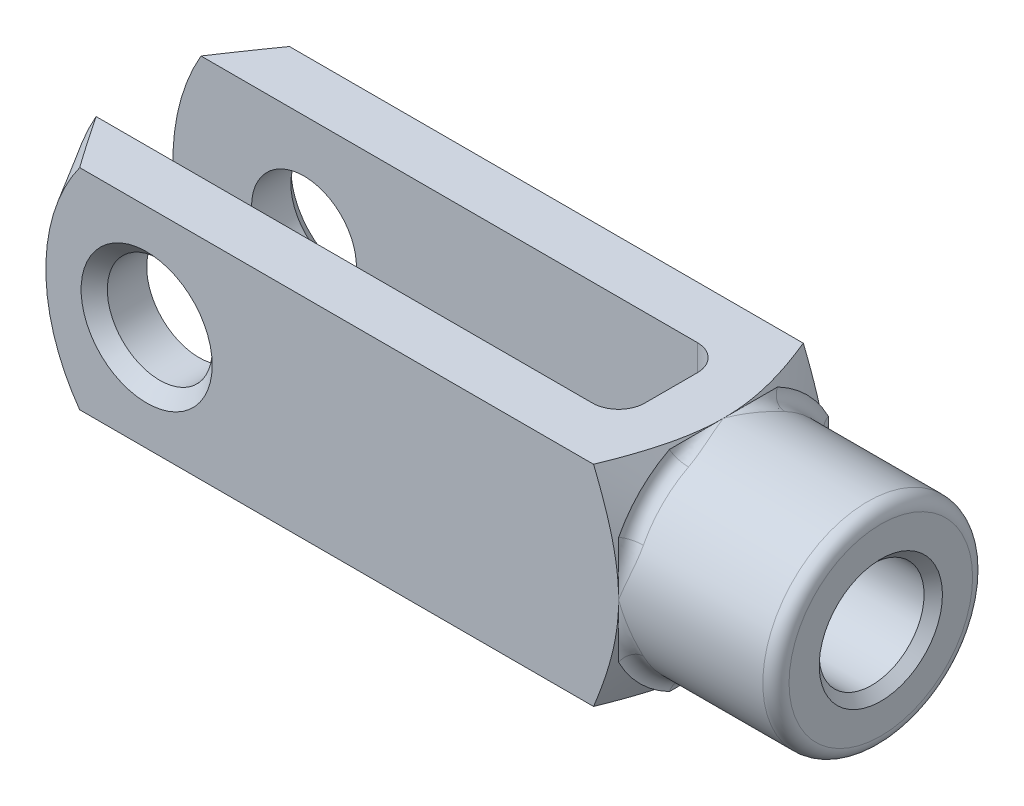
ISO-10303-21;
HEADER;
FILE_DESCRIPTION(('STEP AP214'),'2;1');
FILE_NAME('part.step','',(''),(''),'','','');
FILE_SCHEMA(('AUTOMOTIVE_DESIGN { 1 0 10303 214 1 1 1 1 }'));
ENDSEC;
DATA;
#1=APPLICATION_CONTEXT('core data for automotive mechanical design processes');
#2=APPLICATION_PROTOCOL_DEFINITION('international standard','automotive_design',2000,#1);
#3=PRODUCT_CONTEXT('',#1,'mechanical');
#4=PRODUCT('Part','Part','',(#3));
#5=PRODUCT_RELATED_PRODUCT_CATEGORY('part','',(#4));
#6=PRODUCT_DEFINITION_FORMATION('','',#4);
#7=PRODUCT_DEFINITION_CONTEXT('part definition',#1,'design');
#8=PRODUCT_DEFINITION('design','',#6,#7);
#9=PRODUCT_DEFINITION_SHAPE('','',#8);
#10=(LENGTH_UNIT() NAMED_UNIT(*) SI_UNIT(.MILLI.,.METRE.));
#11=(NAMED_UNIT(*) PLANE_ANGLE_UNIT() SI_UNIT($,.RADIAN.));
#12=(NAMED_UNIT(*) SI_UNIT($,.STERADIAN.) SOLID_ANGLE_UNIT());
#13=UNCERTAINTY_MEASURE_WITH_UNIT(LENGTH_MEASURE(1.E-05),#10,'distance_accuracy_value','');
#14=(GEOMETRIC_REPRESENTATION_CONTEXT(3) GLOBAL_UNCERTAINTY_ASSIGNED_CONTEXT((#13)) GLOBAL_UNIT_ASSIGNED_CONTEXT((#10,
#11,#12)) REPRESENTATION_CONTEXT('',''));
#15=CARTESIAN_POINT('',(0.,0.,0.));
#16=DIRECTION('',(0.,0.,1.));
#17=DIRECTION('',(1.,0.,0.));
#18=AXIS2_PLACEMENT_3D('',#15,#16,#17);
#19=CARTESIAN_POINT('',(-9.00000000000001,-4.,-0.999999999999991));
#20=DIRECTION('',(0.,-1.,0.));
#21=DIRECTION('',(0.,0.,-1.));
#22=AXIS2_PLACEMENT_3D('',#19,#20,#21);
#23=CYLINDRICAL_SURFACE('',#22,1.);
#24=DIRECTION('',(0.,1.,0.));
#25=VECTOR('',#24,1.);
#26=CARTESIAN_POINT('',(-8.00000000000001,-4.,-0.999999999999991));
#27=LINE('',#26,#25);
#28=CARTESIAN_POINT('',(-8.00000000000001,-1.73205080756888,-0.999999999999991));
#29=VERTEX_POINT('',#28);
#30=CARTESIAN_POINT('',(-8.00000000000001,-4.,-0.999999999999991));
#31=VERTEX_POINT('',#30);
#32=EDGE_CURVE('E616',#29,#31,#27,.F.);
#33=ORIENTED_EDGE('',*,*,#32,.F.);
#34=CARTESIAN_POINT('',(-8.00000000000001,-1.73205080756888,-0.999999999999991));
#35=CARTESIAN_POINT('',(-7.99999980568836,-1.71043880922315,-1.03745955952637));
#36=CARTESIAN_POINT('',(-8.00210319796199,-1.68761503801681,-1.07416082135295));
#37=CARTESIAN_POINT('',(-8.01001340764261,-1.63990827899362,-1.14565643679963));
#38=CARTESIAN_POINT('',(-8.01581084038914,-1.61503064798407,-1.18045538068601));
#39=CARTESIAN_POINT('',(-8.03051235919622,-1.56380959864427,-1.24750155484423));
#40=CARTESIAN_POINT('',(-8.0393742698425,-1.53748996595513,-1.27977648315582));
#41=CARTESIAN_POINT('',(-8.05978521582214,-1.48334561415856,-1.34216028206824));
#42=CARTESIAN_POINT('',(-8.07133623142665,-1.45551979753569,-1.37226753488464));
#43=CARTESIAN_POINT('',(-8.11423276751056,-1.3593531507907,-1.47019811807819));
#44=CARTESIAN_POINT('',(-8.15092150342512,-1.28801934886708,-1.53282562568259));
#45=CARTESIAN_POINT('',(-8.23318766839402,-1.1403637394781,-1.64568917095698));
#46=CARTESIAN_POINT('',(-8.27881758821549,-1.06401433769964,-1.69584785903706));
#47=CARTESIAN_POINT('',(-8.395665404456,-0.876600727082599,-1.8020552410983));
#48=CARTESIAN_POINT('',(-8.46975815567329,-0.764009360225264,-1.85225042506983));
#49=CARTESIAN_POINT('',(-8.62397939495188,-0.535898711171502,-1.9306372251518));
#50=CARTESIAN_POINT('',(-8.70409993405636,-0.420383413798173,-1.95885728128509));
#51=CARTESIAN_POINT('',(-8.85468356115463,-0.205528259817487,-1.9919092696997));
#52=CARTESIAN_POINT('',(-8.92478225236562,-0.106374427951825,-1.99962510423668));
#53=CARTESIAN_POINT('',(-8.99655738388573,-0.00486859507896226,-1.99999555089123));
#54=CARTESIAN_POINT('',(-8.99827871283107,-0.00243426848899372,-1.99999999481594));
#55=CARTESIAN_POINT('',(-9.00000000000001,0.,-2.));
#56=B_SPLINE_CURVE_WITH_KNOTS('',3,(#34,#35,#36,#37,#38,#39,#40,#41,#42,#43,#44,#45,#46,#47,#48,
#49,#50,#51,#52,#53,#54,#55),.UNSPECIFIED.,.F.,.F.,(4,2,2,2,2,2,2,2,2,2,4),(0.,
0.129592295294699,0.258856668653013,0.386408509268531,0.51405457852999,0.81759241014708,
1.1229686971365,1.55212503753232,1.98072504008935,2.34472916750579,2.35367344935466),.UNSPECIFIED.);
#57=CARTESIAN_POINT('',(-9.00000000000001,0.,-2.));
#58=VERTEX_POINT('',#57);
#59=EDGE_CURVE('E669',#29,#58,#56,.T.);
#60=ORIENTED_EDGE('',*,*,#59,.T.);
#61=DIRECTION('',(0.,1.,0.));
#62=VECTOR('',#61,1.);
#63=CARTESIAN_POINT('',(-9.00000000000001,4.,-1.99999999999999));
#64=LINE('',#63,#62);
#65=CARTESIAN_POINT('',(-9.00000000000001,-4.,-1.99999999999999));
#66=VERTEX_POINT('',#65);
#67=EDGE_CURVE('E233',#66,#58,#64,.T.);
#68=ORIENTED_EDGE('',*,*,#67,.F.);
#69=CARTESIAN_POINT('',(-9.00000000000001,-4.,-0.999999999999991));
#70=DIRECTION('',(0.,-1.,0.));
#71=DIRECTION('',(0.,0.,-1.));
#72=AXIS2_PLACEMENT_3D('',#69,#70,#71);
#73=CIRCLE('',#72,1.);
#74=EDGE_CURVE('E248',#31,#66,#73,.F.);
#75=ORIENTED_EDGE('',*,*,#74,.F.);
#76=EDGE_LOOP('',(#33,#60,#68,#75));
#77=FACE_BOUND('',#76,.T.);
#78=ADVANCED_FACE('F39',(#77),#23,.F.);
#79=CARTESIAN_POINT('',(-8.00000000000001,-4.,-1.99999999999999));
#80=DIRECTION('',(1.,0.,0.));
#81=DIRECTION('',(0.,0.,-1.));
#82=AXIS2_PLACEMENT_3D('',#79,#80,#81);
#83=PLANE('',#82);
#84=CARTESIAN_POINT('',(-8.00000000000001,4.,-0.999999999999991));
#85=VERTEX_POINT('',#84);
#86=CARTESIAN_POINT('',(-8.00000000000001,1.73205080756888,-0.999999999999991));
#87=VERTEX_POINT('',#86);
#88=EDGE_CURVE('E613',#85,#87,#27,.F.);
#89=ORIENTED_EDGE('',*,*,#88,.T.);
#90=CARTESIAN_POINT('',(-8.00000000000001,0.,0.));
#91=DIRECTION('',(1.,0.,0.));
#92=DIRECTION('',(0.,0.,-1.));
#93=AXIS2_PLACEMENT_3D('',#90,#91,#92);
#94=CIRCLE('',#93,2.);
#95=CARTESIAN_POINT('',(-8.00000000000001,1.73205080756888,0.999999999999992));
#96=VERTEX_POINT('',#95);
#97=EDGE_CURVE('E1289',#87,#96,#94,.T.);
#98=ORIENTED_EDGE('',*,*,#97,.T.);
#99=DIRECTION('',(0.,1.,0.));
#100=VECTOR('',#99,1.);
#101=CARTESIAN_POINT('',(-8.00000000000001,4.,0.999999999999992));
#102=LINE('',#101,#100);
#103=CARTESIAN_POINT('',(-8.00000000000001,4.,0.999999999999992));
#104=VERTEX_POINT('',#103);
#105=EDGE_CURVE('E210',#96,#104,#102,.T.);
#106=ORIENTED_EDGE('',*,*,#105,.T.);
#107=DIRECTION('',(0.,0.,-1.));
#108=VECTOR('',#107,1.);
#109=CARTESIAN_POINT('',(-8.00000000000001,4.,-1.99999999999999));
#110=LINE('',#109,#108);
#111=EDGE_CURVE('E708',#104,#85,#110,.T.);
#112=ORIENTED_EDGE('',*,*,#111,.T.);
#113=EDGE_LOOP('',(#89,#98,#106,#112));
#114=FACE_BOUND('',#113,.T.);
#115=ADVANCED_FACE('F692',(#114),#83,.F.);
#116=CARTESIAN_POINT('',(-9.00000000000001,-4.,0.999999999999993));
#117=DIRECTION('',(0.,-1.,0.));
#118=DIRECTION('',(0.,0.,-1.));
#119=AXIS2_PLACEMENT_3D('',#116,#117,#118);
#120=CYLINDRICAL_SURFACE('',#119,1.);
#121=ORIENTED_EDGE('',*,*,#105,.F.);
#122=CARTESIAN_POINT('',(-8.00000000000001,1.73205080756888,0.999999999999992));
#123=CARTESIAN_POINT('',(-7.99999980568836,1.71043880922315,1.03745955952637));
#124=CARTESIAN_POINT('',(-8.00210319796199,1.68761503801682,1.07416082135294));
#125=CARTESIAN_POINT('',(-8.01001340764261,1.63990827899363,1.14565643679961));
#126=CARTESIAN_POINT('',(-8.01581084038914,1.61503064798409,1.18045538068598));
#127=CARTESIAN_POINT('',(-8.03051235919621,1.56380959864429,1.2475015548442));
#128=CARTESIAN_POINT('',(-8.0393742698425,1.53748996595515,1.2797764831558));
#129=CARTESIAN_POINT('',(-8.05978521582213,1.48334561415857,1.34216028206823));
#130=CARTESIAN_POINT('',(-8.07133623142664,1.45551979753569,1.37226753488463));
#131=CARTESIAN_POINT('',(-8.11423276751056,1.3593531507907,1.47019811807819));
#132=CARTESIAN_POINT('',(-8.15092150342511,1.28801934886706,1.53282562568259));
#133=CARTESIAN_POINT('',(-8.23318766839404,1.1403637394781,1.64568917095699));
#134=CARTESIAN_POINT('',(-8.27881758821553,1.06401433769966,1.69584785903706));
#135=CARTESIAN_POINT('',(-8.39566540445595,0.876600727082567,1.8020552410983));
#136=CARTESIAN_POINT('',(-8.46975815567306,0.764009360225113,1.85225042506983));
#137=CARTESIAN_POINT('',(-8.62397939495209,0.535898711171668,1.9306372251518));
#138=CARTESIAN_POINT('',(-8.70409993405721,0.420383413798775,1.95885728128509));
#139=CARTESIAN_POINT('',(-8.85468356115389,0.205528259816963,1.99190926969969));
#140=CARTESIAN_POINT('',(-8.92478225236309,0.106374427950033,1.99962510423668));
#141=CARTESIAN_POINT('',(-8.9965573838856,0.00486859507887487,1.99999555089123));
#142=CARTESIAN_POINT('',(-8.99827871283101,0.00243426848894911,1.99999999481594));
#143=CARTESIAN_POINT('',(-9.,0.,2.));
#144=B_SPLINE_CURVE_WITH_KNOTS('',3,(#122,#123,#124,#125,#126,#127,#128,#129,#130,#131,#132,
#133,#134,#135,#136,#137,#138,#139,#140,#141,#142,#143),.UNSPECIFIED.,.F.,.F.,(4,2,2,2,2,2,2,2,
2,2,4),(0.,0.129592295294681,0.258856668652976,0.386408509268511,0.51405457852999,
0.817592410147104,1.1229686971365,1.5521250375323,1.98072504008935,2.34472916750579,
2.35367344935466),.UNSPECIFIED.);
#145=CARTESIAN_POINT('',(-9.,0.,2.));
#146=VERTEX_POINT('',#145);
#147=EDGE_CURVE('E195',#96,#146,#144,.T.);
#148=ORIENTED_EDGE('',*,*,#147,.T.);
#149=DIRECTION('',(0.,1.,0.));
#150=VECTOR('',#149,1.);
#151=CARTESIAN_POINT('',(-9.00000000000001,-4.,1.99999999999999));
#152=LINE('',#151,#150);
#153=CARTESIAN_POINT('',(-9.00000000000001,4.,1.99999999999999));
#154=VERTEX_POINT('',#153);
#155=EDGE_CURVE('E209',#154,#146,#152,.F.);
#156=ORIENTED_EDGE('',*,*,#155,.F.);
#157=CARTESIAN_POINT('',(-9.00000000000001,4.,0.999999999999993));
#158=DIRECTION('',(0.,1.,0.));
#159=DIRECTION('',(0.,0.,1.));
#160=AXIS2_PLACEMENT_3D('',#157,#158,#159);
#161=CIRCLE('',#160,1.);
#162=EDGE_CURVE('E240',#104,#154,#161,.F.);
#163=ORIENTED_EDGE('',*,*,#162,.F.);
#164=EDGE_LOOP('',(#121,#148,#156,#163));
#165=FACE_BOUND('',#164,.T.);
#166=ADVANCED_FACE('F206',(#165),#120,.F.);
#167=CARTESIAN_POINT('',(-29.,-4.,-2.));
#168=DIRECTION('',(0.,0.,-1.));
#169=DIRECTION('',(-1.,0.,0.));
#170=AXIS2_PLACEMENT_3D('',#167,#168,#169);
#171=PLANE('',#170);
#172=CARTESIAN_POINT('',(-24.,0.,-2.));
#173=DIRECTION('',(0.,0.,-1.));
#174=DIRECTION('',(-1.,0.,0.));
#175=AXIS2_PLACEMENT_3D('',#172,#173,#174);
#176=CIRCLE('',#175,2.);
#177=CARTESIAN_POINT('',(-26.,0.,-2.));
#178=VERTEX_POINT('',#177);
#179=EDGE_CURVE('E608',#178,#178,#176,.F.);
#180=ORIENTED_EDGE('',*,*,#179,.F.);
#181=EDGE_LOOP('',(#180));
#182=FACE_BOUND('',#181,.T.);
#183=CARTESIAN_POINT('',(-21.,0.,-2.));
#184=DIRECTION('',(0.,0.,1.));
#185=DIRECTION('',(1.,0.,0.));
#186=AXIS2_PLACEMENT_3D('',#183,#184,#185);
#187=CIRCLE('',#186,8.);
#188=CARTESIAN_POINT('',(-27.9282032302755,4.,-2.));
#189=VERTEX_POINT('',#188);
#190=CARTESIAN_POINT('',(-27.9282032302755,-4.,-2.));
#191=VERTEX_POINT('',#190);
#192=EDGE_CURVE('E469',#189,#191,#187,.T.);
#193=ORIENTED_EDGE('',*,*,#192,.T.);
#194=DIRECTION('',(-1.,0.,0.));
#195=VECTOR('',#194,1.);
#196=CARTESIAN_POINT('',(-29.,-4.,-2.));
#197=LINE('',#196,#195);
#198=EDGE_CURVE('E577',#66,#191,#197,.T.);
#199=ORIENTED_EDGE('',*,*,#198,.F.);
#200=ORIENTED_EDGE('',*,*,#67,.T.);
#201=CARTESIAN_POINT('',(-9.00000000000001,4.,-1.99999999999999));
#202=VERTEX_POINT('',#201);
#203=EDGE_CURVE('E229',#58,#202,#64,.T.);
#204=ORIENTED_EDGE('',*,*,#203,.T.);
#205=DIRECTION('',(-1.,0.,0.));
#206=VECTOR('',#205,1.);
#207=CARTESIAN_POINT('',(-29.,4.,-2.));
#208=LINE('',#207,#206);
#209=EDGE_CURVE('E713',#202,#189,#208,.T.);
#210=ORIENTED_EDGE('',*,*,#209,.T.);
#211=EDGE_LOOP('',(#193,#199,#200,#204,#210));
#212=FACE_BOUND('',#211,.T.);
#213=ADVANCED_FACE('F704',(#182,#212),#171,.F.);
#214=CARTESIAN_POINT('',(-29.,-4.,2.));
#215=DIRECTION('',(0.,0.,1.));
#216=DIRECTION('',(1.,0.,0.));
#217=AXIS2_PLACEMENT_3D('',#214,#215,#216);
#218=PLANE('',#217);
#219=CARTESIAN_POINT('',(-24.,0.,2.));
#220=DIRECTION('',(0.,0.,1.));
#221=DIRECTION('',(1.,0.,0.));
#222=AXIS2_PLACEMENT_3D('',#219,#220,#221);
#223=CIRCLE('',#222,2.);
#224=CARTESIAN_POINT('',(-22.,0.,2.));
#225=VERTEX_POINT('',#224);
#226=EDGE_CURVE('E605',#225,#225,#223,.F.);
#227=ORIENTED_EDGE('',*,*,#226,.F.);
#228=EDGE_LOOP('',(#227));
#229=FACE_BOUND('',#228,.T.);
#230=DIRECTION('',(1.,0.,0.));
#231=VECTOR('',#230,1.);
#232=CARTESIAN_POINT('',(-29.,-4.,2.));
#233=LINE('',#232,#231);
#234=CARTESIAN_POINT('',(-27.9282032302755,-4.,2.));
#235=VERTEX_POINT('',#234);
#236=CARTESIAN_POINT('',(-9.00000000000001,-4.,1.99999999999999));
#237=VERTEX_POINT('',#236);
#238=EDGE_CURVE('E707',#235,#237,#233,.T.);
#239=ORIENTED_EDGE('',*,*,#238,.F.);
#240=CARTESIAN_POINT('',(-21.,0.,2.));
#241=DIRECTION('',(0.,0.,1.));
#242=DIRECTION('',(1.,0.,0.));
#243=AXIS2_PLACEMENT_3D('',#240,#241,#242);
#244=CIRCLE('',#243,8.);
#245=CARTESIAN_POINT('',(-27.9282032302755,4.,2.));
#246=VERTEX_POINT('',#245);
#247=EDGE_CURVE('E666',#246,#235,#244,.T.);
#248=ORIENTED_EDGE('',*,*,#247,.F.);
#249=DIRECTION('',(1.,0.,0.));
#250=VECTOR('',#249,1.);
#251=CARTESIAN_POINT('',(-29.,4.,2.));
#252=LINE('',#251,#250);
#253=EDGE_CURVE('E226',#246,#154,#252,.T.);
#254=ORIENTED_EDGE('',*,*,#253,.T.);
#255=ORIENTED_EDGE('',*,*,#155,.T.);
#256=EDGE_CURVE('E214',#146,#237,#152,.F.);
#257=ORIENTED_EDGE('',*,*,#256,.T.);
#258=EDGE_LOOP('',(#239,#248,#254,#255,#257));
#259=FACE_BOUND('',#258,.T.);
#260=ADVANCED_FACE('F223',(#229,#259),#218,.F.);
#261=CARTESIAN_POINT('',(-29.,-4.,4.));
#262=DIRECTION('',(0.,0.,1.));
#263=DIRECTION('',(1.,0.,0.));
#264=AXIS2_PLACEMENT_3D('',#261,#262,#263);
#265=PLANE('',#264);
#266=CARTESIAN_POINT('',(-24.,0.,4.));
#267=DIRECTION('',(0.,0.,1.));
#268=DIRECTION('',(1.,0.,0.));
#269=AXIS2_PLACEMENT_3D('',#266,#267,#268);
#270=CIRCLE('',#269,2.5);
#271=CARTESIAN_POINT('',(-21.5,0.,4.));
#272=VERTEX_POINT('',#271);
#273=EDGE_CURVE('E495',#272,#272,#270,.F.);
#274=ORIENTED_EDGE('',*,*,#273,.T.);
#275=EDGE_LOOP('',(#274));
#276=FACE_BOUND('',#275,.T.);
#277=DIRECTION('',(1.,0.,0.));
#278=VECTOR('',#277,1.);
#279=CARTESIAN_POINT('',(-29.,4.,4.));
#280=LINE('',#279,#278);
#281=CARTESIAN_POINT('',(-26.5550089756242,4.,4.));
#282=VERTEX_POINT('',#281);
#283=CARTESIAN_POINT('',(-6.95658524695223,4.00000000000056,4.));
#284=VERTEX_POINT('',#283);
#285=EDGE_CURVE('E596',#282,#284,#280,.T.);
#286=ORIENTED_EDGE('',*,*,#285,.F.);
#287=CARTESIAN_POINT('',(-21.,0.,4.));
#288=DIRECTION('',(0.,0.,1.));
#289=DIRECTION('',(1.,0.,0.));
#290=AXIS2_PLACEMENT_3D('',#287,#288,#289);
#291=CIRCLE('',#290,6.84529946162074);
#292=CARTESIAN_POINT('',(-26.5550089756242,-4.,4.));
#293=VERTEX_POINT('',#292);
#294=EDGE_CURVE('E63',#282,#293,#291,.T.);
#295=ORIENTED_EDGE('',*,*,#294,.T.);
#296=DIRECTION('',(1.,0.,0.));
#297=VECTOR('',#296,1.);
#298=CARTESIAN_POINT('',(-29.,-4.,4.));
#299=LINE('',#298,#297);
#300=CARTESIAN_POINT('',(-6.95658524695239,-4.,4.));
#301=VERTEX_POINT('',#300);
#302=EDGE_CURVE('E589',#293,#301,#299,.T.);
#303=ORIENTED_EDGE('',*,*,#302,.T.);
#304=CARTESIAN_POINT('',(-8.94234938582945,-8.16961741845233,4.));
#305=CARTESIAN_POINT('',(-8.84013861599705,-7.97247347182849,4.));
#306=CARTESIAN_POINT('',(-8.73846820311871,-7.77504679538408,4.));
#307=CARTESIAN_POINT('',(-8.53649463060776,-7.37948245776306,4.));
#308=CARTESIAN_POINT('',(-8.43619154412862,-7.18134475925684,4.));
#309=CARTESIAN_POINT('',(-8.23707690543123,-6.78388807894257,4.));
#310=CARTESIAN_POINT('',(-8.13826825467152,-6.58456764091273,4.));
#311=CARTESIAN_POINT('',(-7.9427305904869,-6.18491207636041,4.));
#312=CARTESIAN_POINT('',(-7.84600153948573,-5.98457696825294,4.));
#313=CARTESIAN_POINT('',(-7.64927747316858,-5.57029175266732,4.));
#314=CARTESIAN_POINT('',(-7.5494480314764,-5.3562627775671,4.));
#315=CARTESIAN_POINT('',(-7.3535981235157,-4.9264706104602,4.));
#316=CARTESIAN_POINT('',(-7.25757753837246,-4.71070747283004,4.));
#317=CARTESIAN_POINT('',(-7.07057782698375,-4.27709850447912,4.));
#318=CARTESIAN_POINT('',(-6.97959666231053,-4.05925355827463,4.));
#319=CARTESIAN_POINT('',(-6.80432812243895,-3.62089857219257,4.));
#320=CARTESIAN_POINT('',(-6.72003995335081,-3.40038885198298,4.));
#321=CARTESIAN_POINT('',(-6.54315501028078,-2.90795105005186,4.));
#322=CARTESIAN_POINT('',(-6.45271600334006,-2.63523575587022,4.));
#323=CARTESIAN_POINT('',(-6.29104025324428,-2.08399068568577,4.));
#324=CARTESIAN_POINT('',(-6.21980020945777,-1.80546191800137,4.));
#325=CARTESIAN_POINT('',(-6.13373644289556,-1.38680537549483,4.));
#326=CARTESIAN_POINT('',(-6.10869596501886,-1.24877095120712,4.));
#327=CARTESIAN_POINT('',(-6.06590008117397,-0.971589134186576,4.));
#328=CARTESIAN_POINT('',(-6.04814310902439,-0.832441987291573,4.));
#329=CARTESIAN_POINT('',(-6.0206494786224,-0.553427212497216,4.));
#330=CARTESIAN_POINT('',(-6.01090831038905,-0.413560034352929,4.));
#331=CARTESIAN_POINT('',(-5.99987791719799,-0.1334918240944,4.));
#332=CARTESIAN_POINT('',(-5.99858839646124,0.0067091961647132,4.));
#333=CARTESIAN_POINT('',(-6.00430563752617,0.276716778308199,4.));
#334=CARTESIAN_POINT('',(-6.01071472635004,0.406536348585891,4.));
#335=CARTESIAN_POINT('',(-6.03058035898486,0.66561980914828,4.));
#336=CARTESIAN_POINT('',(-6.04403688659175,0.794883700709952,4.));
#337=CARTESIAN_POINT('',(-6.09427714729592,1.18150322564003,4.));
#338=CARTESIAN_POINT('',(-6.14092964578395,1.43761724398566,4.));
#339=CARTESIAN_POINT('',(-6.22727900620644,1.82175416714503,4.));
#340=CARTESIAN_POINT('',(-6.25936078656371,1.95161053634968,4.));
#341=CARTESIAN_POINT('',(-6.32823306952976,2.21008121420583,4.));
#342=CARTESIAN_POINT('',(-6.36502361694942,2.33869551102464,4.));
#343=CARTESIAN_POINT('',(-6.44260140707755,2.59469437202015,4.));
#344=CARTESIAN_POINT('',(-6.48338847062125,2.7220789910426,4.));
#345=CARTESIAN_POINT('',(-6.5683395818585,2.97570465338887,4.));
#346=CARTESIAN_POINT('',(-6.61250345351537,3.10194575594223,4.));
#347=CARTESIAN_POINT('',(-6.75666765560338,3.49961626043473,4.));
#348=CARTESIAN_POINT('',(-6.86187369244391,3.76915804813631,4.));
#349=CARTESIAN_POINT('',(-7.08143955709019,4.30450751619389,4.));
#350=CARTESIAN_POINT('',(-7.19580186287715,4.57031416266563,4.));
#351=CARTESIAN_POINT('',(-7.43110140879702,5.09926397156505,4.));
#352=CARTESIAN_POINT('',(-7.5520442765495,5.36240461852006,4.));
#353=CARTESIAN_POINT('',(-7.79860587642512,5.88644022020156,4.));
#354=CARTESIAN_POINT('',(-7.92422411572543,6.14733540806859,4.));
#355=CARTESIAN_POINT('',(-8.1793250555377,6.66821131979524,4.));
#356=CARTESIAN_POINT('',(-8.3088183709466,6.92818683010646,4.));
#357=CARTESIAN_POINT('',(-8.57045607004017,7.44680454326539,4.));
#358=CARTESIAN_POINT('',(-8.70260051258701,7.70544671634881,4.));
#359=CARTESIAN_POINT('',(-8.9688688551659,8.22154496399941,4.));
#360=CARTESIAN_POINT('',(-9.10299173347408,8.47900156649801,4.));
#361=CARTESIAN_POINT('',(-9.37284852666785,8.99306960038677,4.));
#362=CARTESIAN_POINT('',(-9.5085824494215,9.24968102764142,4.));
#363=CARTESIAN_POINT('',(-9.87719730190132,9.94237342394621,4.));
#364=CARTESIAN_POINT('',(-10.1112943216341,10.3778069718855,4.));
#365=CARTESIAN_POINT('',(-10.5821300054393,11.2473201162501,4.));
#366=CARTESIAN_POINT('',(-10.8188690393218,11.681399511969,4.));
#367=CARTESIAN_POINT('',(-11.292890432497,12.5460299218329,4.));
#368=CARTESIAN_POINT('',(-11.5301619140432,12.9765869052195,4.));
#369=CARTESIAN_POINT('',(-12.0061126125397,13.8368333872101,4.));
#370=CARTESIAN_POINT('',(-12.2447916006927,14.2665230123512,4.));
#371=CARTESIAN_POINT('',(-12.4839744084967,14.6959299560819,4.));
#372=B_SPLINE_CURVE_WITH_KNOTS('',3,(#304,#305,#306,#307,#308,#309,#310,#311,#312,#313,#314,
#315,#316,#317,#318,#319,#320,#321,#322,#323,#324,#325,#326,#327,#328,#329,#330,#331,#332,#333,
#334,#335,#336,#337,#338,#339,#340,#341,#342,#343,#344,#345,#346,#347,#348,#349,#350,#351,#352,
#353,#354,#355,#356,#357,#358,#359,#360,#361,#362,#363,#364,#365,#366,#367,#368,#369,#370,#371),
.UNSPECIFIED.,.F.,.F.,(4,2,2,2,2,2,2,2,2,2,2,2,2,2,2,2,2,2,2,2,2,2,2,2,2,2,2,2,2,2,2,2,2,4),(0.,
0.666196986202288,1.3324294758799,1.99982211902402,2.66720269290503,3.37567174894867,
4.08411867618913,4.79227691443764,5.5003510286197,6.36186888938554,7.22323854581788,
7.64393916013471,8.06454926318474,8.48492255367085,8.90528113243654,9.29500972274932,
9.68473741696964,10.4644002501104,10.8656268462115,11.2668572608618,11.66806969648,
12.0692612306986,12.9370163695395,13.8050071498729,14.6737522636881,15.5424060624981,
16.4137083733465,17.2850300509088,18.1559164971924,19.0268071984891,20.5099092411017,
21.9932215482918,23.4680382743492,24.9426215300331),.UNSPECIFIED.);
#373=CARTESIAN_POINT('',(-6.,0.,4.));
#374=VERTEX_POINT('',#373);
#375=EDGE_CURVE('E541',#374,#301,#372,.F.);
#376=ORIENTED_EDGE('',*,*,#375,.F.);
#377=EDGE_CURVE('E548',#284,#374,#372,.F.);
#378=ORIENTED_EDGE('',*,*,#377,.F.);
#379=EDGE_LOOP('',(#286,#295,#303,#376,#378));
#380=FACE_BOUND('',#379,.T.);
#381=ADVANCED_FACE('F438',(#276,#380),#265,.T.);
#382=CARTESIAN_POINT('',(-29.,-4.,4.));
#383=DIRECTION('',(0.,-1.,0.));
#384=DIRECTION('',(0.,0.,-1.));
#385=AXIS2_PLACEMENT_3D('',#382,#383,#384);
#386=PLANE('',#385);
#387=ORIENTED_EDGE('',*,*,#198,.T.);
#388=CARTESIAN_POINT('',(-31.0929504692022,-4.,2.94792675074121));
#389=CARTESIAN_POINT('',(-30.8983216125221,-4.,2.63455642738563));
#390=CARTESIAN_POINT('',(-30.7031597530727,-4.,2.32151563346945));
#391=CARTESIAN_POINT('',(-30.3115205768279,-4.,1.69624944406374));
#392=CARTESIAN_POINT('',(-30.1150432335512,-4.,1.38402406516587));
#393=CARTESIAN_POINT('',(-29.7202959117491,-4.,0.760185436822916));
#394=CARTESIAN_POINT('',(-29.5220240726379,-4.,0.448573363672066));
#395=CARTESIAN_POINT('',(-29.1235863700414,-4.,-0.17343478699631));
#396=CARTESIAN_POINT('',(-28.9234205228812,-4.,-0.4838308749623));
#397=CARTESIAN_POINT('',(-28.5123724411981,-4.,-1.11601031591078));
#398=CARTESIAN_POINT('',(-28.3013911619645,-4.,-1.43772935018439));
#399=CARTESIAN_POINT('',(-27.8762435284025,-4.,-2.07905590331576));
#400=CARTESIAN_POINT('',(-27.662077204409,-4.,-2.39866344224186));
#401=CARTESIAN_POINT('',(-27.2297970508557,-4.,-3.03485600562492));
#402=CARTESIAN_POINT('',(-27.0116862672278,-4.,-3.35144309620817));
#403=CARTESIAN_POINT('',(-26.5700661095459,-4.,-3.98082503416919));
#404=CARTESIAN_POINT('',(-26.346557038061,-4.,-4.29362009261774));
#405=CARTESIAN_POINT('',(-26.0068038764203,-4.,-4.75730813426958));
#406=CARTESIAN_POINT('',(-25.8933497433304,-4.,-4.91024521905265));
#407=CARTESIAN_POINT('',(-25.6642826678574,-4.,-5.21449201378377));
#408=CARTESIAN_POINT('',(-25.5486697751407,-4.,-5.36580176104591));
#409=CARTESIAN_POINT('',(-25.3147031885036,-4.,-5.66663058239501));
#410=CARTESIAN_POINT('',(-25.1963458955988,-4.,-5.81614686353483));
#411=CARTESIAN_POINT('',(-24.9565116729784,-4.,-6.11265080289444));
#412=CARTESIAN_POINT('',(-24.8350349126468,-4.,-6.25963859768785));
#413=CARTESIAN_POINT('',(-24.5895358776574,-4.,-6.54886920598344));
#414=CARTESIAN_POINT('',(-24.4655531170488,-4.,-6.69114543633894));
#415=CARTESIAN_POINT('',(-24.2129134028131,-4.,-6.97157759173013));
#416=CARTESIAN_POINT('',(-24.0842552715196,-4.,-7.10973246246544));
#417=CARTESIAN_POINT('',(-23.821413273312,-4.,-7.38010850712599));
#418=CARTESIAN_POINT('',(-23.6872425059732,-4.,-7.51234234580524));
#419=CARTESIAN_POINT('',(-23.4116202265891,-4.,-7.76893979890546));
#420=CARTESIAN_POINT('',(-23.2701736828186,-4.,-7.89330865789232));
#421=CARTESIAN_POINT('',(-23.0484643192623,-4.,-8.07339062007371));
#422=CARTESIAN_POINT('',(-22.9715989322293,-4.,-8.13328381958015));
#423=CARTESIAN_POINT('',(-22.8150363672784,-4.,-8.24930338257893));
#424=CARTESIAN_POINT('',(-22.7353386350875,-4.,-8.30542900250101));
#425=CARTESIAN_POINT('',(-22.5728753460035,-4.,-8.412956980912));
#426=CARTESIAN_POINT('',(-22.4901122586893,-4.,-8.46436303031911));
#427=CARTESIAN_POINT('',(-22.3212668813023,-4.,-8.56132770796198));
#428=CARTESIAN_POINT('',(-22.2351854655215,-4.,-8.60688786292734));
#429=CARTESIAN_POINT('',(-22.0116797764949,-4.,-8.71359992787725));
#430=CARTESIAN_POINT('',(-21.8717521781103,-4.,-8.76978895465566));
#431=CARTESIAN_POINT('',(-21.6565574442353,-4.,-8.83656070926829));
#432=CARTESIAN_POINT('',(-21.583962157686,-4.,-8.855896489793));
#433=CARTESIAN_POINT('',(-21.4373556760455,-4.,-8.88804853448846));
#434=CARTESIAN_POINT('',(-21.3633452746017,-4.,-8.90086834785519));
#435=CARTESIAN_POINT('',(-21.2136716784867,-4.,-8.9195421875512));
#436=CARTESIAN_POINT('',(-21.1379993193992,-4.,-8.92532352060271));
#437=CARTESIAN_POINT('',(-20.9864539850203,-4.,-8.92940634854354));
#438=CARTESIAN_POINT('',(-20.9105810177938,-4.,-8.92770813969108));
#439=CARTESIAN_POINT('',(-20.7593691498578,-4.,-8.9169110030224));
#440=CARTESIAN_POINT('',(-20.6840302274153,-4.,-8.90781237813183));
#441=CARTESIAN_POINT('',(-20.5345091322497,-4.,-8.88264290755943));
#442=CARTESIAN_POINT('',(-20.4603277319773,-4.,-8.86656759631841));
#443=CARTESIAN_POINT('',(-20.2131879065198,-4.,-8.80169319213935));
#444=CARTESIAN_POINT('',(-20.0439599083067,-4.,-8.73821520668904));
#445=CARTESIAN_POINT('',(-19.7993020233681,-4.,-8.62410361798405));
#446=CARTESIAN_POINT('',(-19.7191216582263,-4.,-8.58281075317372));
#447=CARTESIAN_POINT('',(-19.5616394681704,-4.,-8.49501736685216));
#448=CARTESIAN_POINT('',(-19.4843373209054,-4.,-8.44851743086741));
#449=CARTESIAN_POINT('',(-19.307555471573,-4.,-8.33532323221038));
#450=CARTESIAN_POINT('',(-19.2091222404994,-4.,-8.26700941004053));
#451=CARTESIAN_POINT('',(-19.0164757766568,-4.,-8.12463087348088));
#452=CARTESIAN_POINT('',(-18.92226462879,-4.,-8.05056336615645));
#453=CARTESIAN_POINT('',(-18.7373734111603,-4.,-7.89785214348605));
#454=CARTESIAN_POINT('',(-18.6466997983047,-4.,-7.81920065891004));
#455=CARTESIAN_POINT('',(-18.4685254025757,-4.,-7.65837051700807));
#456=CARTESIAN_POINT('',(-18.3810252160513,-4.,-7.57619120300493));
#457=CARTESIAN_POINT('',(-18.121484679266,-4.,-7.32438794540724));
#458=CARTESIAN_POINT('',(-17.9535830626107,-4.,-7.15050217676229));
#459=CARTESIAN_POINT('',(-17.6261240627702,-4.,-6.79547418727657));
#460=CARTESIAN_POINT('',(-17.4665586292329,-4.,-6.61433927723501));
#461=CARTESIAN_POINT('',(-17.1995114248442,-4.,-6.30070541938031));
#462=CARTESIAN_POINT('',(-17.0904776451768,-4.,-6.16952022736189));
#463=CARTESIAN_POINT('',(-16.8749762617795,-4.,-5.90501902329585));
#464=CARTESIAN_POINT('',(-16.768509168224,-4.,-5.7717025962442));
#465=CARTESIAN_POINT('',(-16.5593628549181,-4.,-5.50542075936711));
#466=CARTESIAN_POINT('',(-16.4566505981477,-4.,-5.3724812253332));
#467=CARTESIAN_POINT('',(-16.2530656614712,-4.,-5.10526362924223));
#468=CARTESIAN_POINT('',(-16.1521924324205,-4.,-4.97098598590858));
#469=CARTESIAN_POINT('',(-16.0520732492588,-4.,-4.83615522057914));
#470=B_SPLINE_CURVE_WITH_KNOTS('',3,(#388,#389,#390,#391,#392,#393,#394,#395,#396,#397,#398,
#399,#400,#401,#402,#403,#404,#405,#406,#407,#408,#409,#410,#411,#412,#413,#414,#415,#416,#417,
#418,#419,#420,#421,#422,#423,#424,#425,#426,#427,#428,#429,#430,#431,#432,#433,#434,#435,#436,
#437,#438,#439,#440,#441,#442,#443,#444,#445,#446,#447,#448,#449,#450,#451,#452,#453,#454,#455,
#456,#457,#458,#459,#460,#461,#462,#463,#464,#465,#466,#467,#468,#469),.UNSPECIFIED.,.F.,.F.,(4,
2,2,2,2,2,2,2,2,2,2,2,2,2,2,2,2,2,2,2,2,2,2,2,2,2,2,2,2,2,2,2,2,2,2,2,2,2,2,2,4),(0.,
1.10667755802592,2.21337746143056,3.32139900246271,4.42941100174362,5.58358297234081,
6.73774395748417,7.89104883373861,9.04428921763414,9.61554867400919,10.1867950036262,
10.7588383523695,11.3308507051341,11.8969252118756,12.4631433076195,13.0280859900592,
13.5926478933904,13.8848916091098,14.1771928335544,14.4692634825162,14.7612576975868,
15.2117689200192,15.4369037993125,15.6619159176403,15.8892327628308,16.1165406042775,
16.3438391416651,16.5712833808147,17.1099423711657,17.380408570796,17.6508443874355,
18.0100232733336,18.36937761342,18.729359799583,19.0894092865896,19.8141420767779,
20.5381615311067,21.0498691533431,21.561677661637,22.0656502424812,22.5694697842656),.UNSPECIFIED.);
#471=CARTESIAN_POINT('',(-26.5550089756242,-4.,-4.));
#472=VERTEX_POINT('',#471);
#473=EDGE_CURVE('E468',#191,#472,#470,.T.);
#474=ORIENTED_EDGE('',*,*,#473,.T.);
#475=DIRECTION('',(1.,0.,0.));
#476=VECTOR('',#475,1.);
#477=CARTESIAN_POINT('',(-29.,-4.,-4.));
#478=LINE('',#477,#476);
#479=CARTESIAN_POINT('',(-6.95658524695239,-4.,-4.));
#480=VERTEX_POINT('',#479);
#481=EDGE_CURVE('E574',#472,#480,#478,.T.);
#482=ORIENTED_EDGE('',*,*,#481,.T.);
#483=CARTESIAN_POINT('',(-8.94234938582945,-4.,-8.16961741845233));
#484=CARTESIAN_POINT('',(-8.84013861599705,-4.,-7.97247347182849));
#485=CARTESIAN_POINT('',(-8.73846820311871,-4.,-7.77504679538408));
#486=CARTESIAN_POINT('',(-8.53649463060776,-4.,-7.37948245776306));
#487=CARTESIAN_POINT('',(-8.43619154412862,-4.,-7.18134475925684));
#488=CARTESIAN_POINT('',(-8.23707690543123,-4.,-6.78388807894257));
#489=CARTESIAN_POINT('',(-8.13826825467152,-4.,-6.58456764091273));
#490=CARTESIAN_POINT('',(-7.9427305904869,-4.,-6.18491207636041));
#491=CARTESIAN_POINT('',(-7.84600153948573,-4.,-5.98457696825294));
#492=CARTESIAN_POINT('',(-7.64927747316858,-4.,-5.57029175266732));
#493=CARTESIAN_POINT('',(-7.5494480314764,-4.,-5.3562627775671));
#494=CARTESIAN_POINT('',(-7.3535981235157,-4.,-4.9264706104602));
#495=CARTESIAN_POINT('',(-7.25757753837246,-4.,-4.71070747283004));
#496=CARTESIAN_POINT('',(-7.07057782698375,-4.,-4.27709850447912));
#497=CARTESIAN_POINT('',(-6.97959666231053,-4.,-4.05925355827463));
#498=CARTESIAN_POINT('',(-6.80432812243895,-4.,-3.62089857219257));
#499=CARTESIAN_POINT('',(-6.72003995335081,-4.,-3.40038885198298));
#500=CARTESIAN_POINT('',(-6.54315501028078,-4.,-2.90795105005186));
#501=CARTESIAN_POINT('',(-6.45271600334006,-4.,-2.63523575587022));
#502=CARTESIAN_POINT('',(-6.29104025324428,-4.,-2.08399068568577));
#503=CARTESIAN_POINT('',(-6.21980020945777,-4.,-1.80546191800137));
#504=CARTESIAN_POINT('',(-6.13373644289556,-4.,-1.38680537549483));
#505=CARTESIAN_POINT('',(-6.10869596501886,-4.,-1.24877095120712));
#506=CARTESIAN_POINT('',(-6.06590008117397,-4.,-0.971589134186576));
#507=CARTESIAN_POINT('',(-6.04814310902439,-4.,-0.832441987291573));
#508=CARTESIAN_POINT('',(-6.0206494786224,-4.,-0.553427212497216));
#509=CARTESIAN_POINT('',(-6.01090831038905,-4.,-0.413560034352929));
#510=CARTESIAN_POINT('',(-5.99987791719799,-4.,-0.1334918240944));
#511=CARTESIAN_POINT('',(-5.99858839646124,-4.,0.0067091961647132));
#512=CARTESIAN_POINT('',(-6.00430563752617,-4.,0.276716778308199));
#513=CARTESIAN_POINT('',(-6.01071472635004,-4.,0.406536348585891));
#514=CARTESIAN_POINT('',(-6.03058035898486,-4.,0.66561980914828));
#515=CARTESIAN_POINT('',(-6.04403688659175,-4.,0.794883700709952));
#516=CARTESIAN_POINT('',(-6.09427714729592,-4.,1.18150322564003));
#517=CARTESIAN_POINT('',(-6.14092964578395,-4.,1.43761724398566));
#518=CARTESIAN_POINT('',(-6.22727900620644,-4.,1.82175416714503));
#519=CARTESIAN_POINT('',(-6.25936078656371,-4.,1.95161053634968));
#520=CARTESIAN_POINT('',(-6.32823306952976,-4.,2.21008121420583));
#521=CARTESIAN_POINT('',(-6.36502361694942,-4.,2.33869551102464));
#522=CARTESIAN_POINT('',(-6.44260140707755,-4.,2.59469437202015));
#523=CARTESIAN_POINT('',(-6.48338847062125,-4.,2.7220789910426));
#524=CARTESIAN_POINT('',(-6.5683395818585,-4.,2.97570465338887));
#525=CARTESIAN_POINT('',(-6.61250345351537,-4.,3.10194575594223));
#526=CARTESIAN_POINT('',(-6.75666765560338,-4.,3.49961626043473));
#527=CARTESIAN_POINT('',(-6.86187369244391,-4.,3.76915804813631));
#528=CARTESIAN_POINT('',(-7.08143955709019,-4.,4.30450751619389));
#529=CARTESIAN_POINT('',(-7.19580186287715,-4.,4.57031416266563));
#530=CARTESIAN_POINT('',(-7.43110140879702,-4.,5.09926397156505));
#531=CARTESIAN_POINT('',(-7.5520442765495,-4.,5.36240461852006));
#532=CARTESIAN_POINT('',(-7.79860587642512,-4.,5.88644022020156));
#533=CARTESIAN_POINT('',(-7.92422411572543,-4.,6.14733540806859));
#534=CARTESIAN_POINT('',(-8.1793250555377,-4.,6.66821131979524));
#535=CARTESIAN_POINT('',(-8.3088183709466,-4.,6.92818683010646));
#536=CARTESIAN_POINT('',(-8.57045607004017,-4.,7.44680454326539));
#537=CARTESIAN_POINT('',(-8.70260051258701,-4.,7.70544671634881));
#538=CARTESIAN_POINT('',(-8.9688688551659,-4.,8.22154496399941));
#539=CARTESIAN_POINT('',(-9.10299173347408,-4.,8.47900156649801));
#540=CARTESIAN_POINT('',(-9.37284852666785,-4.,8.99306960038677));
#541=CARTESIAN_POINT('',(-9.5085824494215,-4.,9.24968102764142));
#542=CARTESIAN_POINT('',(-9.87719730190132,-4.,9.94237342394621));
#543=CARTESIAN_POINT('',(-10.1112943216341,-4.,10.3778069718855));
#544=CARTESIAN_POINT('',(-10.5821300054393,-4.,11.2473201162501));
#545=CARTESIAN_POINT('',(-10.8188690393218,-4.,11.681399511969));
#546=CARTESIAN_POINT('',(-11.292890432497,-4.,12.5460299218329));
#547=CARTESIAN_POINT('',(-11.5301619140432,-4.,12.9765869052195));
#548=CARTESIAN_POINT('',(-12.0061126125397,-4.,13.8368333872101));
#549=CARTESIAN_POINT('',(-12.2447916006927,-4.,14.2665230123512));
#550=CARTESIAN_POINT('',(-12.4839744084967,-4.,14.6959299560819));
#551=B_SPLINE_CURVE_WITH_KNOTS('',3,(#483,#484,#485,#486,#487,#488,#489,#490,#491,#492,#493,
#494,#495,#496,#497,#498,#499,#500,#501,#502,#503,#504,#505,#506,#507,#508,#509,#510,#511,#512,
#513,#514,#515,#516,#517,#518,#519,#520,#521,#522,#523,#524,#525,#526,#527,#528,#529,#530,#531,
#532,#533,#534,#535,#536,#537,#538,#539,#540,#541,#542,#543,#544,#545,#546,#547,#548,#549,#550),
.UNSPECIFIED.,.F.,.F.,(4,2,2,2,2,2,2,2,2,2,2,2,2,2,2,2,2,2,2,2,2,2,2,2,2,2,2,2,2,2,2,2,2,4),(0.,
0.666196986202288,1.3324294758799,1.99982211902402,2.66720269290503,3.37567174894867,
4.08411867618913,4.79227691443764,5.5003510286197,6.36186888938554,7.22323854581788,
7.64393916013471,8.06454926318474,8.48492255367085,8.90528113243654,9.29500972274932,
9.68473741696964,10.4644002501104,10.8656268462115,11.2668572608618,11.66806969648,
12.0692612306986,12.9370163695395,13.8050071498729,14.6737522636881,15.5424060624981,
16.4137083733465,17.2850300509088,18.1559164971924,19.0268071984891,20.5099092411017,
21.9932215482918,23.4680382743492,24.9426215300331),.UNSPECIFIED.);
#552=CARTESIAN_POINT('',(-6.,-4.,0.));
#553=VERTEX_POINT('',#552);
#554=EDGE_CURVE('E651',#553,#480,#551,.F.);
#555=ORIENTED_EDGE('',*,*,#554,.F.);
#556=EDGE_CURVE('E452',#301,#553,#551,.F.);
#557=ORIENTED_EDGE('',*,*,#556,.F.);
#558=ORIENTED_EDGE('',*,*,#302,.F.);
#559=CARTESIAN_POINT('',(-16.0520732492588,-4.,4.8361552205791));
#560=CARTESIAN_POINT('',(-16.133423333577,-4.,4.94572288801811));
#561=CARTESIAN_POINT('',(-16.215277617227,-4.,5.05491708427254));
#562=CARTESIAN_POINT('',(-16.38015010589,-4.,5.27243490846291));
#563=CARTESIAN_POINT('',(-16.4631683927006,-4.,5.38075847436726));
#564=CARTESIAN_POINT('',(-16.7144757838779,-4.,5.70458899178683));
#565=CARTESIAN_POINT('',(-16.884735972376,-4.,5.91857436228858));
#566=CARTESIAN_POINT('',(-17.2338455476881,-4.,6.34301076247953));
#567=CARTESIAN_POINT('',(-17.4127627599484,-4.,6.55340659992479));
#568=CARTESIAN_POINT('',(-17.6882253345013,-4.,6.86257306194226));
#569=CARTESIAN_POINT('',(-17.7811971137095,-4.,6.96452642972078));
#570=CARTESIAN_POINT('',(-17.9699552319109,-4.,7.16578692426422));
#571=CARTESIAN_POINT('',(-18.0657412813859,-4.,7.26509432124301));
#572=CARTESIAN_POINT('',(-18.245300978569,-4.,7.44500576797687));
#573=CARTESIAN_POINT('',(-18.3285903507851,-4.,7.52609205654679));
#574=CARTESIAN_POINT('',(-18.4979253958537,-4.,7.68536280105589));
#575=CARTESIAN_POINT('',(-18.5839713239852,-4.,7.76354698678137));
#576=CARTESIAN_POINT('',(-18.7593003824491,-4.,7.91632000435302));
#577=CARTESIAN_POINT('',(-18.848585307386,-4.,7.99090678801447));
#578=CARTESIAN_POINT('',(-19.0308329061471,-4.,8.13545102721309));
#579=CARTESIAN_POINT('',(-19.1237951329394,-4.,8.20540904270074));
#580=CARTESIAN_POINT('',(-19.3005417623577,-4.,8.32993246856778));
#581=CARTESIAN_POINT('',(-19.3837709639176,-4.,8.38527712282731));
#582=CARTESIAN_POINT('',(-19.5536165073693,-4.,8.49046107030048));
#583=CARTESIAN_POINT('',(-19.640233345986,-4.,8.54029955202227));
#584=CARTESIAN_POINT('',(-19.9050553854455,-4.,8.67920212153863));
#585=CARTESIAN_POINT('',(-20.088980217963,-4.,8.75820846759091));
#586=CARTESIAN_POINT('',(-20.40964900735,-4.,8.85666978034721));
#587=CARTESIAN_POINT('',(-20.542993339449,-4.,8.88704568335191));
#588=CARTESIAN_POINT('',(-20.8129615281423,-4.,8.92453053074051));
#589=CARTESIAN_POINT('',(-20.9495824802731,-4.,8.93165936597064));
#590=CARTESIAN_POINT('',(-21.2219426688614,-4.,8.92156256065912));
#591=CARTESIAN_POINT('',(-21.3576814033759,-4.,8.90432409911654));
#592=CARTESIAN_POINT('',(-21.6245025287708,-4.,8.8480427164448));
#593=CARTESIAN_POINT('',(-21.7555812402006,-4.,8.80898295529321));
#594=CARTESIAN_POINT('',(-21.983344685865,-4.,8.72393377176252));
#595=CARTESIAN_POINT('',(-22.0813245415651,-4.,8.68128312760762));
#596=CARTESIAN_POINT('',(-22.2731654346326,-4.,8.58746979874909));
#597=CARTESIAN_POINT('',(-22.3670236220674,-4.,8.53630133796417));
#598=CARTESIAN_POINT('',(-22.551106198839,-4.,8.42705584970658));
#599=CARTESIAN_POINT('',(-22.6413138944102,-4.,8.3689510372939));
#600=CARTESIAN_POINT('',(-22.8180245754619,-4.,8.24746933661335));
#601=CARTESIAN_POINT('',(-22.9045289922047,-4.,8.18409451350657));
#602=CARTESIAN_POINT('',(-23.075280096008,-4.,8.05239330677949));
#603=CARTESIAN_POINT('',(-23.1594885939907,-4.,7.98401772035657));
#604=CARTESIAN_POINT('',(-23.3250061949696,-4.,7.84383122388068));
#605=CARTESIAN_POINT('',(-23.4063147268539,-4.,7.77201964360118));
#606=CARTESIAN_POINT('',(-23.6465934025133,-4.,7.55233767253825));
#607=CARTESIAN_POINT('',(-23.8017787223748,-4.,7.40032974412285));
#608=CARTESIAN_POINT('',(-24.104983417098,-4.,7.08838616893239));
#609=CARTESIAN_POINT('',(-24.2529752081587,-4.,6.92842413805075));
#610=CARTESIAN_POINT('',(-24.5429270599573,-4.,6.60327597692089));
#611=CARTESIAN_POINT('',(-24.6848897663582,-4.,6.43809219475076));
#612=CARTESIAN_POINT('',(-24.9658693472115,-4.,6.10176213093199));
#613=CARTESIAN_POINT('',(-25.1048277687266,-4.,5.93056728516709));
#614=CARTESIAN_POINT('',(-25.3789410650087,-4.,5.58514186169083));
#615=CARTESIAN_POINT('',(-25.5140955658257,-4.,5.41091098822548));
#616=CARTESIAN_POINT('',(-25.7810247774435,-4.,5.06048516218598));
#617=CARTESIAN_POINT('',(-25.9128062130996,-4.,4.88429531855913));
#618=CARTESIAN_POINT('',(-26.1738439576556,-4.,4.5300527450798));
#619=CARTESIAN_POINT('',(-26.3031002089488,-4.,4.35199997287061));
#620=CARTESIAN_POINT('',(-26.6422539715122,-4.,3.87901172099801));
#621=CARTESIAN_POINT('',(-26.8503648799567,-4.,3.58279586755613));
#622=CARTESIAN_POINT('',(-27.2623140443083,-4.,2.98740437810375));
#623=CARTESIAN_POINT('',(-27.4661521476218,-4.,2.68822863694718));
#624=CARTESIAN_POINT('',(-27.8706839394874,-4.,2.08736856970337));
#625=CARTESIAN_POINT('',(-28.0713746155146,-4.,1.78568221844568));
#626=CARTESIAN_POINT('',(-28.4701152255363,-4.,1.18056951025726));
#627=CARTESIAN_POINT('',(-28.6681651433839,-4.,0.877143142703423));
#628=CARTESIAN_POINT('',(-29.0540263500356,-4.,0.281425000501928));
#629=CARTESIAN_POINT('',(-29.2419235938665,-4.,-0.0108111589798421));
#630=CARTESIAN_POINT('',(-29.6160989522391,-4.,-0.596319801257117));
#631=CARTESIAN_POINT('',(-29.8023770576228,-4.,-0.889592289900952));
#632=CARTESIAN_POINT('',(-30.1733573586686,-4.,-1.47663649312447));
#633=CARTESIAN_POINT('',(-30.358061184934,-4.,-1.77040717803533));
#634=CARTESIAN_POINT('',(-30.7263180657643,-4.,-2.35866314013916));
#635=CARTESIAN_POINT('',(-30.9098711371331,-4.,-2.65314840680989));
#636=CARTESIAN_POINT('',(-31.0929504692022,-4.,-2.9479267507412));
#637=B_SPLINE_CURVE_WITH_KNOTS('',3,(#559,#560,#561,#562,#563,#564,#565,#566,#567,#568,#569,
#570,#571,#572,#573,#574,#575,#576,#577,#578,#579,#580,#581,#582,#583,#584,#585,#586,#587,#588,
#589,#590,#591,#592,#593,#594,#595,#596,#597,#598,#599,#600,#601,#602,#603,#604,#605,#606,#607,
#608,#609,#610,#611,#612,#613,#614,#615,#616,#617,#618,#619,#620,#621,#622,#623,#624,#625,#626,
#627,#628,#629,#630,#631,#632,#633,#634,#635,#636),.UNSPECIFIED.,.F.,.F.,(4,2,2,2,2,2,2,2,2,2,2,
2,2,2,2,2,2,2,2,2,2,2,2,2,2,2,2,2,2,2,2,2,2,2,2,2,2,2,4),(0.,0.409396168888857,
0.818821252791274,1.63909308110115,2.4674040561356,2.88130054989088,3.29515461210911,
3.64382355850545,3.99252488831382,4.34142246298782,4.69027775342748,4.98992209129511,
5.28961053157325,5.886214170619,6.29478644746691,6.70300904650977,7.11144651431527,
7.52019961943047,7.84032595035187,8.16067025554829,8.48234377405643,8.80389182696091,
9.12919688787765,9.45456566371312,10.1058305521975,10.7594223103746,11.4127242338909,
12.0741368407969,12.7356142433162,13.3956498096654,14.0557004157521,15.1416858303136,
16.2277099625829,17.3147169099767,18.4017305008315,19.4440130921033,20.4863015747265,
21.5273321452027,22.5683474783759),.UNSPECIFIED.);
#638=EDGE_CURVE('E460',#293,#235,#637,.T.);
#639=ORIENTED_EDGE('',*,*,#638,.T.);
#640=ORIENTED_EDGE('',*,*,#238,.T.);
#641=CARTESIAN_POINT('',(-9.00000000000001,-4.,0.999999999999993));
#642=DIRECTION('',(0.,-1.,0.));
#643=DIRECTION('',(0.,0.,-1.));
#644=AXIS2_PLACEMENT_3D('',#641,#642,#643);
#645=CIRCLE('',#644,1.);
#646=CARTESIAN_POINT('',(-8.00000000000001,-4.,0.999999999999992));
#647=VERTEX_POINT('',#646);
#648=EDGE_CURVE('E216',#237,#647,#645,.F.);
#649=ORIENTED_EDGE('',*,*,#648,.T.);
#650=DIRECTION('',(0.,0.,-1.));
#651=VECTOR('',#650,1.);
#652=CARTESIAN_POINT('',(-8.00000000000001,-4.,-1.99999999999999));
#653=LINE('',#652,#651);
#654=EDGE_CURVE('E609',#647,#31,#653,.T.);
#655=ORIENTED_EDGE('',*,*,#654,.T.);
#656=ORIENTED_EDGE('',*,*,#74,.T.);
#657=EDGE_LOOP('',(#387,#474,#482,#555,#557,#558,#639,#640,#649,#655,#656));
#658=FACE_BOUND('',#657,.T.);
#659=ADVANCED_FACE('F432',(#658),#386,.T.);
#660=CARTESIAN_POINT('',(-29.,-4.,-4.));
#661=DIRECTION('',(0.,0.,-1.));
#662=DIRECTION('',(-1.,0.,0.));
#663=AXIS2_PLACEMENT_3D('',#660,#661,#662);
#664=PLANE('',#663);
#665=CARTESIAN_POINT('',(-24.,0.,-4.));
#666=DIRECTION('',(0.,0.,-1.));
#667=DIRECTION('',(-1.,0.,0.));
#668=AXIS2_PLACEMENT_3D('',#665,#666,#667);
#669=CIRCLE('',#668,2.5);
#670=CARTESIAN_POINT('',(-26.5,0.,-4.));
#671=VERTEX_POINT('',#670);
#672=EDGE_CURVE('E415',#671,#671,#669,.F.);
#673=ORIENTED_EDGE('',*,*,#672,.T.);
#674=EDGE_LOOP('',(#673));
#675=FACE_BOUND('',#674,.T.);
#676=ORIENTED_EDGE('',*,*,#481,.F.);
#677=CARTESIAN_POINT('',(-21.,0.,-4.));
#678=DIRECTION('',(0.,0.,1.));
#679=DIRECTION('',(1.,0.,0.));
#680=AXIS2_PLACEMENT_3D('',#677,#678,#679);
#681=CIRCLE('',#680,6.84529946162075);
#682=CARTESIAN_POINT('',(-26.5550089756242,4.,-4.));
#683=VERTEX_POINT('',#682);
#684=EDGE_CURVE('E582',#683,#472,#681,.T.);
#685=ORIENTED_EDGE('',*,*,#684,.F.);
#686=DIRECTION('',(1.,0.,0.));
#687=VECTOR('',#686,1.);
#688=CARTESIAN_POINT('',(-29.,4.,-4.));
#689=LINE('',#688,#687);
#690=CARTESIAN_POINT('',(-6.95658524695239,4.,-4.));
#691=VERTEX_POINT('',#690);
#692=EDGE_CURVE('E588',#683,#691,#689,.T.);
#693=ORIENTED_EDGE('',*,*,#692,.T.);
#694=CARTESIAN_POINT('',(-8.94234938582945,-8.16961741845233,-4.));
#695=CARTESIAN_POINT('',(-8.84013861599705,-7.97247347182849,-4.));
#696=CARTESIAN_POINT('',(-8.73846820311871,-7.77504679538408,-4.));
#697=CARTESIAN_POINT('',(-8.53649463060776,-7.37948245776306,-4.));
#698=CARTESIAN_POINT('',(-8.43619154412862,-7.18134475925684,-4.));
#699=CARTESIAN_POINT('',(-8.23707690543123,-6.78388807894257,-4.));
#700=CARTESIAN_POINT('',(-8.13826825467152,-6.58456764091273,-4.));
#701=CARTESIAN_POINT('',(-7.9427305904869,-6.18491207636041,-4.));
#702=CARTESIAN_POINT('',(-7.84600153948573,-5.98457696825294,-4.));
#703=CARTESIAN_POINT('',(-7.64927747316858,-5.57029175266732,-4.));
#704=CARTESIAN_POINT('',(-7.5494480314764,-5.3562627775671,-4.));
#705=CARTESIAN_POINT('',(-7.3535981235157,-4.9264706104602,-4.));
#706=CARTESIAN_POINT('',(-7.25757753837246,-4.71070747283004,-4.));
#707=CARTESIAN_POINT('',(-7.07057782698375,-4.27709850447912,-4.));
#708=CARTESIAN_POINT('',(-6.97959666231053,-4.05925355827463,-4.));
#709=CARTESIAN_POINT('',(-6.80432812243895,-3.62089857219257,-4.));
#710=CARTESIAN_POINT('',(-6.72003995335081,-3.40038885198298,-4.));
#711=CARTESIAN_POINT('',(-6.54315501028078,-2.90795105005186,-4.));
#712=CARTESIAN_POINT('',(-6.45271600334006,-2.63523575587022,-4.));
#713=CARTESIAN_POINT('',(-6.29104025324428,-2.08399068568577,-4.));
#714=CARTESIAN_POINT('',(-6.21980020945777,-1.80546191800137,-4.));
#715=CARTESIAN_POINT('',(-6.13373644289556,-1.38680537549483,-4.));
#716=CARTESIAN_POINT('',(-6.10869596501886,-1.24877095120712,-4.));
#717=CARTESIAN_POINT('',(-6.06590008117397,-0.971589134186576,-4.));
#718=CARTESIAN_POINT('',(-6.04814310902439,-0.832441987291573,-4.));
#719=CARTESIAN_POINT('',(-6.0206494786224,-0.553427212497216,-4.));
#720=CARTESIAN_POINT('',(-6.01090831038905,-0.413560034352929,-4.));
#721=CARTESIAN_POINT('',(-5.99987791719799,-0.1334918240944,-4.));
#722=CARTESIAN_POINT('',(-5.99858839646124,0.0067091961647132,-4.));
#723=CARTESIAN_POINT('',(-6.00430563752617,0.276716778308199,-4.));
#724=CARTESIAN_POINT('',(-6.01071472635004,0.406536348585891,-4.));
#725=CARTESIAN_POINT('',(-6.03058035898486,0.66561980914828,-4.));
#726=CARTESIAN_POINT('',(-6.04403688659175,0.794883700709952,-4.));
#727=CARTESIAN_POINT('',(-6.09427714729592,1.18150322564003,-4.));
#728=CARTESIAN_POINT('',(-6.14092964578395,1.43761724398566,-4.));
#729=CARTESIAN_POINT('',(-6.22727900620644,1.82175416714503,-4.));
#730=CARTESIAN_POINT('',(-6.25936078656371,1.95161053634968,-4.));
#731=CARTESIAN_POINT('',(-6.32823306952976,2.21008121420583,-4.));
#732=CARTESIAN_POINT('',(-6.36502361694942,2.33869551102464,-4.));
#733=CARTESIAN_POINT('',(-6.44260140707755,2.59469437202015,-4.));
#734=CARTESIAN_POINT('',(-6.48338847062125,2.7220789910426,-4.));
#735=CARTESIAN_POINT('',(-6.5683395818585,2.97570465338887,-4.));
#736=CARTESIAN_POINT('',(-6.61250345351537,3.10194575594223,-4.));
#737=CARTESIAN_POINT('',(-6.75666765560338,3.49961626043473,-4.));
#738=CARTESIAN_POINT('',(-6.86187369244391,3.76915804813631,-4.));
#739=CARTESIAN_POINT('',(-7.08143955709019,4.30450751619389,-4.));
#740=CARTESIAN_POINT('',(-7.19580186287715,4.57031416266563,-4.));
#741=CARTESIAN_POINT('',(-7.43110140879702,5.09926397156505,-4.));
#742=CARTESIAN_POINT('',(-7.5520442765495,5.36240461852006,-4.));
#743=CARTESIAN_POINT('',(-7.79860587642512,5.88644022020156,-4.));
#744=CARTESIAN_POINT('',(-7.92422411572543,6.14733540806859,-4.));
#745=CARTESIAN_POINT('',(-8.1793250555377,6.66821131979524,-4.));
#746=CARTESIAN_POINT('',(-8.3088183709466,6.92818683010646,-4.));
#747=CARTESIAN_POINT('',(-8.57045607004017,7.44680454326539,-4.));
#748=CARTESIAN_POINT('',(-8.70260051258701,7.70544671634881,-4.));
#749=CARTESIAN_POINT('',(-8.9688688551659,8.22154496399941,-4.));
#750=CARTESIAN_POINT('',(-9.10299173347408,8.47900156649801,-4.));
#751=CARTESIAN_POINT('',(-9.37284852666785,8.99306960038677,-4.));
#752=CARTESIAN_POINT('',(-9.5085824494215,9.24968102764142,-4.));
#753=CARTESIAN_POINT('',(-9.87719730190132,9.94237342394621,-4.));
#754=CARTESIAN_POINT('',(-10.1112943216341,10.3778069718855,-4.));
#755=CARTESIAN_POINT('',(-10.5821300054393,11.2473201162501,-4.));
#756=CARTESIAN_POINT('',(-10.8188690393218,11.681399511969,-4.));
#757=CARTESIAN_POINT('',(-11.292890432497,12.5460299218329,-4.));
#758=CARTESIAN_POINT('',(-11.5301619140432,12.9765869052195,-4.));
#759=CARTESIAN_POINT('',(-12.0061126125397,13.8368333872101,-4.));
#760=CARTESIAN_POINT('',(-12.2447916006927,14.2665230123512,-4.));
#761=CARTESIAN_POINT('',(-12.4839744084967,14.6959299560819,-4.));
#762=B_SPLINE_CURVE_WITH_KNOTS('',3,(#694,#695,#696,#697,#698,#699,#700,#701,#702,#703,#704,
#705,#706,#707,#708,#709,#710,#711,#712,#713,#714,#715,#716,#717,#718,#719,#720,#721,#722,#723,
#724,#725,#726,#727,#728,#729,#730,#731,#732,#733,#734,#735,#736,#737,#738,#739,#740,#741,#742,
#743,#744,#745,#746,#747,#748,#749,#750,#751,#752,#753,#754,#755,#756,#757,#758,#759,#760,#761),
.UNSPECIFIED.,.F.,.F.,(4,2,2,2,2,2,2,2,2,2,2,2,2,2,2,2,2,2,2,2,2,2,2,2,2,2,2,2,2,2,2,2,2,4),(0.,
0.666196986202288,1.3324294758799,1.99982211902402,2.66720269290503,3.37567174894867,
4.08411867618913,4.79227691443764,5.5003510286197,6.36186888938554,7.22323854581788,
7.64393916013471,8.06454926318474,8.48492255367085,8.90528113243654,9.29500972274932,
9.68473741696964,10.4644002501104,10.8656268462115,11.2668572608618,11.66806969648,
12.0692612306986,12.9370163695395,13.8050071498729,14.6737522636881,15.5424060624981,
16.4137083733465,17.2850300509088,18.1559164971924,19.0268071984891,20.5099092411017,
21.9932215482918,23.4680382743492,24.9426215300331),.UNSPECIFIED.);
#763=CARTESIAN_POINT('',(-6.,0.,-4.));
#764=VERTEX_POINT('',#763);
#765=EDGE_CURVE('E523',#764,#691,#762,.T.);
#766=ORIENTED_EDGE('',*,*,#765,.F.);
#767=EDGE_CURVE('E586',#480,#764,#762,.T.);
#768=ORIENTED_EDGE('',*,*,#767,.F.);
#769=EDGE_LOOP('',(#676,#685,#693,#766,#768));
#770=FACE_BOUND('',#769,.T.);
#771=ADVANCED_FACE('F437',(#675,#770),#664,.T.);
#772=CARTESIAN_POINT('',(-29.,4.,4.));
#773=DIRECTION('',(0.,1.,0.));
#774=DIRECTION('',(0.,0.,1.));
#775=AXIS2_PLACEMENT_3D('',#772,#773,#774);
#776=PLANE('',#775);
#777=ORIENTED_EDGE('',*,*,#692,.F.);
#778=CARTESIAN_POINT('',(-16.0520732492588,4.,-4.83615522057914));
#779=CARTESIAN_POINT('',(-16.133423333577,4.,-4.94572288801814));
#780=CARTESIAN_POINT('',(-16.215277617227,4.,-5.05491708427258));
#781=CARTESIAN_POINT('',(-16.38015010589,4.,-5.27243490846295));
#782=CARTESIAN_POINT('',(-16.4631683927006,4.,-5.38075847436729));
#783=CARTESIAN_POINT('',(-16.7144757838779,4.,-5.70458899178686));
#784=CARTESIAN_POINT('',(-16.884735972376,4.,-5.91857436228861));
#785=CARTESIAN_POINT('',(-17.2338455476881,4.,-6.34301076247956));
#786=CARTESIAN_POINT('',(-17.4127627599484,4.,-6.55340659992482));
#787=CARTESIAN_POINT('',(-17.6882253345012,4.,-6.86257306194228));
#788=CARTESIAN_POINT('',(-17.7811971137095,4.,-6.9645264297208));
#789=CARTESIAN_POINT('',(-17.9699552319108,4.,-7.16578692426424));
#790=CARTESIAN_POINT('',(-18.0657412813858,4.,-7.26509432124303));
#791=CARTESIAN_POINT('',(-18.2453009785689,4.,-7.44500576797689));
#792=CARTESIAN_POINT('',(-18.328590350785,4.,-7.52609205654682));
#793=CARTESIAN_POINT('',(-18.4979253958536,4.,-7.68536280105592));
#794=CARTESIAN_POINT('',(-18.5839713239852,4.,-7.76354698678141));
#795=CARTESIAN_POINT('',(-18.759300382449,4.,-7.91632000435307));
#796=CARTESIAN_POINT('',(-18.848585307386,4.,-7.99090678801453));
#797=CARTESIAN_POINT('',(-19.0308329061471,4.,-8.13545102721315));
#798=CARTESIAN_POINT('',(-19.1237951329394,4.,-8.2054090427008));
#799=CARTESIAN_POINT('',(-19.3005417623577,4.,-8.32993246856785));
#800=CARTESIAN_POINT('',(-19.3837709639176,4.,-8.38527712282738));
#801=CARTESIAN_POINT('',(-19.5536165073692,4.,-8.49046107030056));
#802=CARTESIAN_POINT('',(-19.6402333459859,4.,-8.54029955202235));
#803=CARTESIAN_POINT('',(-19.9050553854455,4.,-8.67920212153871));
#804=CARTESIAN_POINT('',(-20.0889802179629,4.,-8.758208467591));
#805=CARTESIAN_POINT('',(-20.40964900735,4.,-8.8566697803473));
#806=CARTESIAN_POINT('',(-20.542993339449,4.,-8.88704568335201));
#807=CARTESIAN_POINT('',(-20.8129615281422,4.,-8.9245305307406));
#808=CARTESIAN_POINT('',(-20.949582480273,4.,-8.93165936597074));
#809=CARTESIAN_POINT('',(-21.2219426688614,4.,-8.92156256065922));
#810=CARTESIAN_POINT('',(-21.3576814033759,4.,-8.90432409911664));
#811=CARTESIAN_POINT('',(-21.6245025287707,4.,-8.84804271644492));
#812=CARTESIAN_POINT('',(-21.7555812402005,4.,-8.80898295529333));
#813=CARTESIAN_POINT('',(-21.983344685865,4.,-8.72393377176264));
#814=CARTESIAN_POINT('',(-22.081324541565,4.,-8.68128312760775));
#815=CARTESIAN_POINT('',(-22.2731654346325,4.,-8.58746979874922));
#816=CARTESIAN_POINT('',(-22.3670236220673,4.,-8.53630133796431));
#817=CARTESIAN_POINT('',(-22.5511061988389,4.,-8.42705584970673));
#818=CARTESIAN_POINT('',(-22.6413138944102,4.,-8.36895103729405));
#819=CARTESIAN_POINT('',(-22.8180245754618,4.,-8.2474693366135));
#820=CARTESIAN_POINT('',(-22.9045289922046,4.,-8.18409451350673));
#821=CARTESIAN_POINT('',(-23.0752800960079,4.,-8.05239330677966));
#822=CARTESIAN_POINT('',(-23.1594885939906,4.,-7.98401772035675));
#823=CARTESIAN_POINT('',(-23.3250061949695,4.,-7.84383122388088));
#824=CARTESIAN_POINT('',(-23.4063147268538,4.,-7.77201964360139));
#825=CARTESIAN_POINT('',(-23.6465934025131,4.,-7.55233767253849));
#826=CARTESIAN_POINT('',(-23.8017787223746,4.,-7.40032974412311));
#827=CARTESIAN_POINT('',(-24.1049834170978,4.,-7.08838616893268));
#828=CARTESIAN_POINT('',(-24.2529752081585,4.,-6.92842413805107));
#829=CARTESIAN_POINT('',(-24.542927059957,4.,-6.60327597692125));
#830=CARTESIAN_POINT('',(-24.684889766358,4.,-6.43809219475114));
#831=CARTESIAN_POINT('',(-24.9658693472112,4.,-6.10176213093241));
#832=CARTESIAN_POINT('',(-25.1048277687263,4.,-5.93056728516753));
#833=CARTESIAN_POINT('',(-25.3789410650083,4.,-5.58514186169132));
#834=CARTESIAN_POINT('',(-25.5140955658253,4.,-5.41091098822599));
#835=CARTESIAN_POINT('',(-25.7810247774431,4.,-5.06048516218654));
#836=CARTESIAN_POINT('',(-25.9128062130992,4.,-4.8842953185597));
#837=CARTESIAN_POINT('',(-26.1738439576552,4.,-4.53005274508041));
#838=CARTESIAN_POINT('',(-26.3031002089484,4.,-4.35199997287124));
#839=CARTESIAN_POINT('',(-26.6422539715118,4.,-3.87901172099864));
#840=CARTESIAN_POINT('',(-26.8503648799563,4.,-3.58279586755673));
#841=CARTESIAN_POINT('',(-27.2623140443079,4.,-2.9874043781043));
#842=CARTESIAN_POINT('',(-27.4661521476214,4.,-2.6882286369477));
#843=CARTESIAN_POINT('',(-27.8706839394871,4.,-2.08736856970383));
#844=CARTESIAN_POINT('',(-28.0713746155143,4.,-1.7856822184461));
#845=CARTESIAN_POINT('',(-28.470115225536,4.,-1.18056951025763));
#846=CARTESIAN_POINT('',(-28.6681651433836,4.,-0.877143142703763));
#847=CARTESIAN_POINT('',(-29.0540263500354,4.,-0.28142500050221));
#848=CARTESIAN_POINT('',(-29.2419235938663,4.,0.0108111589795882));
#849=CARTESIAN_POINT('',(-29.6160989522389,4.,0.596319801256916));
#850=CARTESIAN_POINT('',(-29.8023770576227,4.,0.889592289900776));
#851=CARTESIAN_POINT('',(-30.1733573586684,4.,1.47663649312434));
#852=CARTESIAN_POINT('',(-30.3580611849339,4.,1.77040717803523));
#853=CARTESIAN_POINT('',(-30.7263180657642,4.,2.35866314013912));
#854=CARTESIAN_POINT('',(-30.909871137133,4.,2.65314840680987));
#855=CARTESIAN_POINT('',(-31.0929504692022,4.,2.94792675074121));
#856=B_SPLINE_CURVE_WITH_KNOTS('',3,(#778,#779,#780,#781,#782,#783,#784,#785,#786,#787,#788,
#789,#790,#791,#792,#793,#794,#795,#796,#797,#798,#799,#800,#801,#802,#803,#804,#805,#806,#807,
#808,#809,#810,#811,#812,#813,#814,#815,#816,#817,#818,#819,#820,#821,#822,#823,#824,#825,#826,
#827,#828,#829,#830,#831,#832,#833,#834,#835,#836,#837,#838,#839,#840,#841,#842,#843,#844,#845,
#846,#847,#848,#849,#850,#851,#852,#853,#854,#855),.UNSPECIFIED.,.F.,.F.,(4,2,2,2,2,2,2,2,2,2,2,
2,2,2,2,2,2,2,2,2,2,2,2,2,2,2,2,2,2,2,2,2,2,2,2,2,2,2,4),(0.,0.409396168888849,
0.818821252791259,1.63909308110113,2.46740405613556,2.88130054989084,3.29515461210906,
3.64382355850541,3.9925248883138,4.34142246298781,4.69027775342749,4.98992209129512,
5.28961053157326,5.886214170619,6.29478644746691,6.70300904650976,7.11144651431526,
7.52019961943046,7.84032595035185,8.16067025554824,8.48234377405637,8.80389182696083,
9.12919688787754,9.45456566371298,10.1058305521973,10.7594223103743,11.4127242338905,
12.0741368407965,12.7356142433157,13.3956498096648,14.0557004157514,15.141685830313,
16.2277099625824,17.3147169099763,18.4017305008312,19.4440130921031,20.4863015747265,
21.5273321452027,22.568347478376),.UNSPECIFIED.);
#857=EDGE_CURVE('E494',#683,#189,#856,.T.);
#858=ORIENTED_EDGE('',*,*,#857,.T.);
#859=ORIENTED_EDGE('',*,*,#209,.F.);
#860=CARTESIAN_POINT('',(-9.00000000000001,4.,-0.999999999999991));
#861=DIRECTION('',(0.,1.,0.));
#862=DIRECTION('',(0.,0.,1.));
#863=AXIS2_PLACEMENT_3D('',#860,#861,#862);
#864=CIRCLE('',#863,1.);
#865=EDGE_CURVE('E245',#202,#85,#864,.F.);
#866=ORIENTED_EDGE('',*,*,#865,.T.);
#867=ORIENTED_EDGE('',*,*,#111,.F.);
#868=ORIENTED_EDGE('',*,*,#162,.T.);
#869=ORIENTED_EDGE('',*,*,#253,.F.);
#870=CARTESIAN_POINT('',(-31.0929504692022,4.,-2.9479267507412));
#871=CARTESIAN_POINT('',(-30.8983216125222,4.,-2.63455642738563));
#872=CARTESIAN_POINT('',(-30.7031597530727,4.,-2.32151563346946));
#873=CARTESIAN_POINT('',(-30.311520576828,4.,-1.69624944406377));
#874=CARTESIAN_POINT('',(-30.1150432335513,4.,-1.38402406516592));
#875=CARTESIAN_POINT('',(-29.7202959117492,4.,-0.760185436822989));
#876=CARTESIAN_POINT('',(-29.522024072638,4.,-0.448573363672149));
#877=CARTESIAN_POINT('',(-29.1235863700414,4.,0.173434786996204));
#878=CARTESIAN_POINT('',(-28.9234205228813,4.,0.483830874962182));
#879=CARTESIAN_POINT('',(-28.5123724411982,4.,1.11601031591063));
#880=CARTESIAN_POINT('',(-28.3013911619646,4.,1.43772935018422));
#881=CARTESIAN_POINT('',(-27.8762435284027,4.,2.07905590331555));
#882=CARTESIAN_POINT('',(-27.6620772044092,4.,2.39866344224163));
#883=CARTESIAN_POINT('',(-27.2297970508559,4.,3.03485600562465));
#884=CARTESIAN_POINT('',(-27.011686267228,4.,3.35144309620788));
#885=CARTESIAN_POINT('',(-26.5700661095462,4.,3.98082503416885));
#886=CARTESIAN_POINT('',(-26.3465570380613,4.,4.29362009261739));
#887=CARTESIAN_POINT('',(-26.0068038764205,4.,4.7573081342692));
#888=CARTESIAN_POINT('',(-25.8933497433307,4.,4.91024521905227));
#889=CARTESIAN_POINT('',(-25.6642826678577,4.,5.21449201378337));
#890=CARTESIAN_POINT('',(-25.548669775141,4.,5.3658017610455));
#891=CARTESIAN_POINT('',(-25.3147031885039,4.,5.66663058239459));
#892=CARTESIAN_POINT('',(-25.1963458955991,4.,5.8161468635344));
#893=CARTESIAN_POINT('',(-24.9565116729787,4.,6.112650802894));
#894=CARTESIAN_POINT('',(-24.8350349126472,4.,6.25963859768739));
#895=CARTESIAN_POINT('',(-24.5895358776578,4.,6.54886920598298));
#896=CARTESIAN_POINT('',(-24.4655531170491,4.,6.69114543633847));
#897=CARTESIAN_POINT('',(-24.2129134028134,4.,6.97157759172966));
#898=CARTESIAN_POINT('',(-24.08425527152,4.,7.10973246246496));
#899=CARTESIAN_POINT('',(-23.8214132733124,4.,7.38010850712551));
#900=CARTESIAN_POINT('',(-23.6872425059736,4.,7.51234234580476));
#901=CARTESIAN_POINT('',(-23.4116202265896,4.,7.76893979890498));
#902=CARTESIAN_POINT('',(-23.270173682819,4.,7.89330865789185));
#903=CARTESIAN_POINT('',(-23.0484643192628,4.,8.07339062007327));
#904=CARTESIAN_POINT('',(-22.9715989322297,4.,8.13328381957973));
#905=CARTESIAN_POINT('',(-22.8150363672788,4.,8.24930338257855));
#906=CARTESIAN_POINT('',(-22.7353386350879,4.,8.30542900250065));
#907=CARTESIAN_POINT('',(-22.5728753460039,4.,8.4129569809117));
#908=CARTESIAN_POINT('',(-22.4901122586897,4.,8.46436303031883));
#909=CARTESIAN_POINT('',(-22.3212668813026,4.,8.56132770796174));
#910=CARTESIAN_POINT('',(-22.2351854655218,4.,8.60688786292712));
#911=CARTESIAN_POINT('',(-22.0116797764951,4.,8.71359992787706));
#912=CARTESIAN_POINT('',(-21.8717521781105,4.,8.76978895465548));
#913=CARTESIAN_POINT('',(-21.6565574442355,4.,8.83656070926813));
#914=CARTESIAN_POINT('',(-21.5839621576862,4.,8.85589648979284));
#915=CARTESIAN_POINT('',(-21.4373556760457,4.,8.88804853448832));
#916=CARTESIAN_POINT('',(-21.3633452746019,4.,8.90086834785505));
#917=CARTESIAN_POINT('',(-21.2136716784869,4.,8.91954218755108));
#918=CARTESIAN_POINT('',(-21.1379993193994,4.,8.9253235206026));
#919=CARTESIAN_POINT('',(-20.9864539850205,4.,8.92940634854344));
#920=CARTESIAN_POINT('',(-20.910581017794,4.,8.92770813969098));
#921=CARTESIAN_POINT('',(-20.759369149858,4.,8.91691100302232));
#922=CARTESIAN_POINT('',(-20.6840302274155,4.,8.90781237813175));
#923=CARTESIAN_POINT('',(-20.5345091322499,4.,8.88264290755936));
#924=CARTESIAN_POINT('',(-20.4603277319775,4.,8.86656759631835));
#925=CARTESIAN_POINT('',(-20.21318790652,4.,8.80169319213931));
#926=CARTESIAN_POINT('',(-20.0439599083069,4.,8.73821520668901));
#927=CARTESIAN_POINT('',(-19.7993020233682,4.,8.62410361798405));
#928=CARTESIAN_POINT('',(-19.7191216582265,4.,8.58281075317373));
#929=CARTESIAN_POINT('',(-19.5616394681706,4.,8.49501736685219));
#930=CARTESIAN_POINT('',(-19.4843373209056,4.,8.44851743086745));
#931=CARTESIAN_POINT('',(-19.3075554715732,4.,8.33532323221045));
#932=CARTESIAN_POINT('',(-19.2091222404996,4.,8.26700941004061));
#933=CARTESIAN_POINT('',(-19.0164757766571,4.,8.12463087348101));
#934=CARTESIAN_POINT('',(-18.9222646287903,4.,8.05056336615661));
#935=CARTESIAN_POINT('',(-18.7373734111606,4.,7.89785214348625));
#936=CARTESIAN_POINT('',(-18.6466997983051,4.,7.81920065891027));
#937=CARTESIAN_POINT('',(-18.4685254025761,4.,7.65837051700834));
#938=CARTESIAN_POINT('',(-18.3810252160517,4.,7.57619120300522));
#939=CARTESIAN_POINT('',(-18.1214846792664,4.,7.3243879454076));
#940=CARTESIAN_POINT('',(-17.9535830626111,4.,7.1505021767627));
#941=CARTESIAN_POINT('',(-17.6261240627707,4.,6.79547418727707));
#942=CARTESIAN_POINT('',(-17.4665586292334,4.,6.61433927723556));
#943=CARTESIAN_POINT('',(-17.1995114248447,4.,6.30070541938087));
#944=CARTESIAN_POINT('',(-17.0904776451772,4.,6.1695202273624));
#945=CARTESIAN_POINT('',(-16.8749762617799,4.,5.90501902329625));
#946=CARTESIAN_POINT('',(-16.7685091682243,4.,5.77170259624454));
#947=CARTESIAN_POINT('',(-16.5593628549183,4.,5.50542075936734));
#948=CARTESIAN_POINT('',(-16.4566505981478,4.,5.37248122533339));
#949=CARTESIAN_POINT('',(-16.2530656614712,4.,5.1052636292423));
#950=CARTESIAN_POINT('',(-16.1521924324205,4.,4.9709859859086));
#951=CARTESIAN_POINT('',(-16.0520732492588,4.,4.8361552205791));
#952=B_SPLINE_CURVE_WITH_KNOTS('',3,(#870,#871,#872,#873,#874,#875,#876,#877,#878,#879,#880,
#881,#882,#883,#884,#885,#886,#887,#888,#889,#890,#891,#892,#893,#894,#895,#896,#897,#898,#899,
#900,#901,#902,#903,#904,#905,#906,#907,#908,#909,#910,#911,#912,#913,#914,#915,#916,#917,#918,
#919,#920,#921,#922,#923,#924,#925,#926,#927,#928,#929,#930,#931,#932,#933,#934,#935,#936,#937,
#938,#939,#940,#941,#942,#943,#944,#945,#946,#947,#948,#949,#950,#951),.UNSPECIFIED.,.F.,.F.,(4,
2,2,2,2,2,2,2,2,2,2,2,2,2,2,2,2,2,2,2,2,2,2,2,2,2,2,2,2,2,2,2,2,2,2,2,2,2,2,2,4),(0.,
1.10667755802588,2.21337746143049,3.3213990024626,4.42941100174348,5.5835829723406,
6.73774395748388,7.89104883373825,9.04428921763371,9.61554867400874,10.1867950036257,
10.758838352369,11.3308507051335,11.896925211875,12.4631433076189,13.0280859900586,
13.5926478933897,13.8848916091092,14.1771928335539,14.4692634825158,14.7612576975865,
15.2117689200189,15.4369037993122,15.66191591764,15.8892327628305,16.1165406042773,
16.3438391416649,16.5712833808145,17.1099423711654,17.3804085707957,17.6508443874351,
18.0100232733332,18.3693776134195,18.7293597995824,19.089409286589,19.8141420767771,
20.5381615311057,21.0498691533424,21.5616776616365,22.0656502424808,22.5694697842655),.UNSPECIFIED.);
#953=EDGE_CURVE('E487',#246,#282,#952,.T.);
#954=ORIENTED_EDGE('',*,*,#953,.T.);
#955=ORIENTED_EDGE('',*,*,#285,.T.);
#956=CARTESIAN_POINT('',(-8.94234938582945,4.,-8.16961741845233));
#957=CARTESIAN_POINT('',(-8.84013861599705,4.,-7.97247347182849));
#958=CARTESIAN_POINT('',(-8.73846820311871,4.,-7.77504679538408));
#959=CARTESIAN_POINT('',(-8.53649463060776,4.,-7.37948245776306));
#960=CARTESIAN_POINT('',(-8.43619154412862,4.,-7.18134475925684));
#961=CARTESIAN_POINT('',(-8.23707690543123,4.,-6.78388807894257));
#962=CARTESIAN_POINT('',(-8.13826825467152,4.,-6.58456764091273));
#963=CARTESIAN_POINT('',(-7.9427305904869,4.,-6.18491207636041));
#964=CARTESIAN_POINT('',(-7.84600153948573,4.,-5.98457696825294));
#965=CARTESIAN_POINT('',(-7.64927747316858,4.,-5.57029175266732));
#966=CARTESIAN_POINT('',(-7.5494480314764,4.,-5.3562627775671));
#967=CARTESIAN_POINT('',(-7.3535981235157,4.,-4.9264706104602));
#968=CARTESIAN_POINT('',(-7.25757753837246,4.,-4.71070747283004));
#969=CARTESIAN_POINT('',(-7.07057782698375,4.,-4.27709850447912));
#970=CARTESIAN_POINT('',(-6.97959666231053,4.,-4.05925355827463));
#971=CARTESIAN_POINT('',(-6.80432812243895,4.,-3.62089857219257));
#972=CARTESIAN_POINT('',(-6.72003995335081,4.,-3.40038885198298));
#973=CARTESIAN_POINT('',(-6.54315501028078,4.,-2.90795105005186));
#974=CARTESIAN_POINT('',(-6.45271600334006,4.,-2.63523575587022));
#975=CARTESIAN_POINT('',(-6.29104025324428,4.,-2.08399068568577));
#976=CARTESIAN_POINT('',(-6.21980020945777,4.,-1.80546191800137));
#977=CARTESIAN_POINT('',(-6.13373644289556,4.,-1.38680537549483));
#978=CARTESIAN_POINT('',(-6.10869596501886,4.,-1.24877095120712));
#979=CARTESIAN_POINT('',(-6.06590008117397,4.,-0.971589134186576));
#980=CARTESIAN_POINT('',(-6.04814310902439,4.,-0.832441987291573));
#981=CARTESIAN_POINT('',(-6.0206494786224,4.,-0.553427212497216));
#982=CARTESIAN_POINT('',(-6.01090831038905,4.,-0.413560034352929));
#983=CARTESIAN_POINT('',(-5.99987791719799,4.,-0.1334918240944));
#984=CARTESIAN_POINT('',(-5.99858839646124,4.,0.0067091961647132));
#985=CARTESIAN_POINT('',(-6.00430563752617,4.,0.276716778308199));
#986=CARTESIAN_POINT('',(-6.01071472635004,4.,0.406536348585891));
#987=CARTESIAN_POINT('',(-6.03058035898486,4.,0.66561980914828));
#988=CARTESIAN_POINT('',(-6.04403688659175,4.,0.794883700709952));
#989=CARTESIAN_POINT('',(-6.09427714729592,4.,1.18150322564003));
#990=CARTESIAN_POINT('',(-6.14092964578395,4.,1.43761724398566));
#991=CARTESIAN_POINT('',(-6.22727900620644,4.,1.82175416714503));
#992=CARTESIAN_POINT('',(-6.25936078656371,4.,1.95161053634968));
#993=CARTESIAN_POINT('',(-6.32823306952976,4.,2.21008121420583));
#994=CARTESIAN_POINT('',(-6.36502361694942,4.,2.33869551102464));
#995=CARTESIAN_POINT('',(-6.44260140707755,4.,2.59469437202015));
#996=CARTESIAN_POINT('',(-6.48338847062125,4.,2.7220789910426));
#997=CARTESIAN_POINT('',(-6.5683395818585,4.,2.97570465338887));
#998=CARTESIAN_POINT('',(-6.61250345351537,4.,3.10194575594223));
#999=CARTESIAN_POINT('',(-6.75666765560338,4.,3.49961626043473));
#1000=CARTESIAN_POINT('',(-6.86187369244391,4.,3.76915804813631));
#1001=CARTESIAN_POINT('',(-7.08143955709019,4.,4.30450751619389));
#1002=CARTESIAN_POINT('',(-7.19580186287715,4.,4.57031416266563));
#1003=CARTESIAN_POINT('',(-7.43110140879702,4.,5.09926397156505));
#1004=CARTESIAN_POINT('',(-7.5520442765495,4.,5.36240461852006));
#1005=CARTESIAN_POINT('',(-7.79860587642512,4.,5.88644022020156));
#1006=CARTESIAN_POINT('',(-7.92422411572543,4.,6.14733540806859));
#1007=CARTESIAN_POINT('',(-8.1793250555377,4.,6.66821131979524));
#1008=CARTESIAN_POINT('',(-8.3088183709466,4.,6.92818683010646));
#1009=CARTESIAN_POINT('',(-8.57045607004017,4.,7.44680454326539));
#1010=CARTESIAN_POINT('',(-8.70260051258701,4.,7.70544671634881));
#1011=CARTESIAN_POINT('',(-8.9688688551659,4.,8.22154496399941));
#1012=CARTESIAN_POINT('',(-9.10299173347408,4.,8.47900156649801));
#1013=CARTESIAN_POINT('',(-9.37284852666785,4.,8.99306960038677));
#1014=CARTESIAN_POINT('',(-9.5085824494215,4.,9.24968102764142));
#1015=CARTESIAN_POINT('',(-9.87719730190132,4.,9.94237342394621));
#1016=CARTESIAN_POINT('',(-10.1112943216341,4.,10.3778069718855));
#1017=CARTESIAN_POINT('',(-10.5821300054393,4.,11.2473201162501));
#1018=CARTESIAN_POINT('',(-10.8188690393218,4.,11.681399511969));
#1019=CARTESIAN_POINT('',(-11.292890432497,4.,12.5460299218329));
#1020=CARTESIAN_POINT('',(-11.5301619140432,4.,12.9765869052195));
#1021=CARTESIAN_POINT('',(-12.0061126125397,4.,13.8368333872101));
#1022=CARTESIAN_POINT('',(-12.2447916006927,4.,14.2665230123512));
#1023=CARTESIAN_POINT('',(-12.4839744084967,4.,14.6959299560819));
#1024=B_SPLINE_CURVE_WITH_KNOTS('',3,(#956,#957,#958,#959,#960,#961,#962,#963,#964,#965,#966,
#967,#968,#969,#970,#971,#972,#973,#974,#975,#976,#977,#978,#979,#980,#981,#982,#983,#984,#985,
#986,#987,#988,#989,#990,#991,#992,#993,#994,#995,#996,#997,#998,#999,#1000,#1001,#1002,#1003,
#1004,#1005,#1006,#1007,#1008,#1009,#1010,#1011,#1012,#1013,#1014,#1015,#1016,#1017,#1018,#1019,
#1020,#1021,#1022,#1023),.UNSPECIFIED.,.F.,.F.,(4,2,2,2,2,2,2,2,2,2,2,2,2,2,2,2,2,2,2,2,2,2,2,2,
2,2,2,2,2,2,2,2,2,4),(0.,0.666196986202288,1.3324294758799,1.99982211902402,2.66720269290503,
3.37567174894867,4.08411867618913,4.79227691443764,5.5003510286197,6.36186888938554,
7.22323854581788,7.64393916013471,8.06454926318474,8.48492255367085,8.90528113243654,
9.29500972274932,9.68473741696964,10.4644002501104,10.8656268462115,11.2668572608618,
11.66806969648,12.0692612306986,12.9370163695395,13.8050071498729,14.6737522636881,
15.5424060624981,16.4137083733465,17.2850300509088,18.1559164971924,19.0268071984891,
20.5099092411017,21.9932215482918,23.4680382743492,24.9426215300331),.UNSPECIFIED.);
#1025=CARTESIAN_POINT('',(-6.,4.,0.));
#1026=VERTEX_POINT('',#1025);
#1027=EDGE_CURVE('E515',#1026,#284,#1024,.T.);
#1028=ORIENTED_EDGE('',*,*,#1027,.F.);
#1029=EDGE_CURVE('E522',#691,#1026,#1024,.T.);
#1030=ORIENTED_EDGE('',*,*,#1029,.F.);
#1031=EDGE_LOOP('',(#777,#858,#859,#866,#867,#868,#869,#954,#955,#1028,#1030));
#1032=FACE_BOUND('',#1031,.T.);
#1033=ADVANCED_FACE('F272',(#1032),#776,.T.);
#1034=CARTESIAN_POINT('',(-6.,0.,0.));
#1035=DIRECTION('',(1.,0.,0.));
#1036=DIRECTION('',(0.,0.,-1.));
#1037=AXIS2_PLACEMENT_3D('',#1034,#1035,#1036);
#1038=CYLINDRICAL_SURFACE('',#1037,4.);
#1039=CARTESIAN_POINT('',(-0.5,0.,0.));
#1040=DIRECTION('',(1.,0.,0.));
#1041=DIRECTION('',(0.,0.,-1.));
#1042=AXIS2_PLACEMENT_3D('',#1039,#1040,#1041);
#1043=CIRCLE('',#1042,4.);
#1044=CARTESIAN_POINT('',(-0.5,0.,-4.));
#1045=VERTEX_POINT('',#1044);
#1046=EDGE_CURVE('E395',#1045,#1045,#1043,.F.);
#1047=ORIENTED_EDGE('',*,*,#1046,.T.);
#1048=EDGE_LOOP('',(#1047));
#1049=FACE_BOUND('',#1048,.T.);
#1050=CARTESIAN_POINT('',(-5.5,0.,0.));
#1051=DIRECTION('',(1.,0.,0.));
#1052=DIRECTION('',(0.,0.,-1.));
#1053=AXIS2_PLACEMENT_3D('',#1050,#1051,#1052);
#1054=CIRCLE('',#1053,4.);
#1055=CARTESIAN_POINT('',(-5.5,3.55555555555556,1.8324913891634));
#1056=VERTEX_POINT('',#1055);
#1057=CARTESIAN_POINT('',(-5.5,1.8324913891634,3.55555555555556));
#1058=VERTEX_POINT('',#1057);
#1059=EDGE_CURVE('E844',#1056,#1058,#1054,.T.);
#1060=ORIENTED_EDGE('',*,*,#1059,.T.);
#1061=CARTESIAN_POINT('',(-5.55071090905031,2.16952896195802,3.36052735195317));
#1062=CARTESIAN_POINT('',(-6.26235584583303,2.01117084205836,3.46276205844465));
#1063=CARTESIAN_POINT('',(-6.,2.44072008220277,4.));
#1064=CARTESIAN_POINT('',(-5.54007498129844,2.1394484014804,3.37995314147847));
#1065=CARTESIAN_POINT('',(-6.23033872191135,2.00690286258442,3.46358692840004));
#1066=CARTESIAN_POINT('',(-6.,2.40687945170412,4.));
#1067=CARTESIAN_POINT('',(-5.53143916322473,2.1087605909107,3.39918647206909));
#1068=CARTESIAN_POINT('',(-6.19963410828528,1.9976397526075,3.46792398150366));
#1069=CARTESIAN_POINT('',(-6.,2.37235566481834,4.));
#1070=CARTESIAN_POINT('',(-5.51758294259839,2.04649787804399,3.43702791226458));
#1071=CARTESIAN_POINT('',(-6.14328862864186,1.97166696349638,3.48137300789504));
#1072=CARTESIAN_POINT('',(-6.,2.3023101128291,4.));
#1073=CARTESIAN_POINT('',(-5.51235459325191,2.01492522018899,3.45563737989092));
#1074=CARTESIAN_POINT('',(-6.11732756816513,1.95527400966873,3.4902773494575));
#1075=CARTESIAN_POINT('',(-6.,2.26679087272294,4.));
#1076=CARTESIAN_POINT('',(-5.50092342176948,1.91977048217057,3.50995412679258));
#1077=CARTESIAN_POINT('',(-6.04870619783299,1.89984188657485,3.52023266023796));
#1078=CARTESIAN_POINT('',(-6.,2.15974179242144,4.));
#1079=CARTESIAN_POINT('',(-5.49879300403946,1.8551611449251,3.54453201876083));
#1080=CARTESIAN_POINT('',(-6.01041586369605,1.85296723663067,3.54540456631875));
#1081=CARTESIAN_POINT('',(-6.,2.08705628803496,4.));
#1082=CARTESIAN_POINT('',(-5.50228423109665,1.72854569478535,3.6078846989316));
#1083=CARTESIAN_POINT('',(-5.95154853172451,1.75172738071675,3.59648449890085));
#1084=CARTESIAN_POINT('',(-6.,1.94461390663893,4.));
#1085=CARTESIAN_POINT('',(-5.5074203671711,1.66663618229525,3.63688890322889));
#1086=CARTESIAN_POINT('',(-5.92906068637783,1.69835623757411,3.62223417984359));
#1087=CARTESIAN_POINT('',(-6.,1.87496570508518,4.));
#1088=CARTESIAN_POINT('',(-5.52292209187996,1.54184138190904,3.69152645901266));
#1089=CARTESIAN_POINT('',(-5.89434363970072,1.58616025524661,3.67285481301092));
#1090=CARTESIAN_POINT('',(-6.,1.73457155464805,4.));
#1091=CARTESIAN_POINT('',(-5.53329034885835,1.47895561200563,3.7171580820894));
#1092=CARTESIAN_POINT('',(-5.88153475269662,1.5271930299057,3.69793973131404));
#1093=CARTESIAN_POINT('',(-6.,1.66382506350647,4.));
#1094=CARTESIAN_POINT('',(-5.5705342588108,1.28839581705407,3.78926959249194));
#1095=CARTESIAN_POINT('',(-5.85508019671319,1.34787720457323,3.76859453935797));
#1096=CARTESIAN_POINT('',(-6.,1.44944529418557,4.));
#1097=CARTESIAN_POINT('',(-5.60348802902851,1.15968237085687,3.83053678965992));
#1098=CARTESIAN_POINT('',(-5.85080842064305,1.21753999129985,3.81321575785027));
#1099=CARTESIAN_POINT('',(-6.,1.3046426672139,4.));
#1100=CARTESIAN_POINT('',(-5.69023202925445,0.861579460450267,3.910018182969));
#1101=CARTESIAN_POINT('',(-5.86164764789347,0.915029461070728,3.89811073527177));
#1102=CARTESIAN_POINT('',(-6.,0.969276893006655,4.));
#1103=CARTESIAN_POINT('',(-5.74731135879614,0.691732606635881,3.94348083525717));
#1104=CARTESIAN_POINT('',(-5.88176240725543,0.734725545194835,3.93642694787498));
#1105=CARTESIAN_POINT('',(-6.,0.778199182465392,4.));
#1106=CARTESIAN_POINT('',(-5.86819522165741,0.35163930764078,3.9881883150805));
#1107=CARTESIAN_POINT('',(-5.93375193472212,0.376121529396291,3.98632694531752));
#1108=CARTESIAN_POINT('',(-6.,0.395594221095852,4.));
#1109=CARTESIAN_POINT('',(-5.93197785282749,0.181395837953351,3.99950326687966));
#1110=CARTESIAN_POINT('',(-5.96598146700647,0.192787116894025,3.99943468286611));
#1111=CARTESIAN_POINT('',(-6.,0.204070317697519,4.));
#1112=CARTESIAN_POINT('',(-5.99717160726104,0.00754239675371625,3.99999465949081));
#1113=CARTESIAN_POINT('',(-5.99858579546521,0.00801381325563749,3.99999413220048));
#1114=CARTESIAN_POINT('',(-6.,0.0084851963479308,4.));
#1115=CARTESIAN_POINT('',(-5.99858582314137,0.00377115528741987,3.99999999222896));
#1116=CARTESIAN_POINT('',(-5.99929290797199,0.00400684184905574,4.00000013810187));
#1117=CARTESIAN_POINT('',(-6.,0.00424254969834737,4.));
#1118=CARTESIAN_POINT('',(-6.,0.,4.));
#1119=CARTESIAN_POINT('',(-6.,0.,4.));
#1120=CARTESIAN_POINT('',(-6.,0.,4.));
#1121=(BOUNDED_SURFACE() B_SPLINE_SURFACE(3,2,((#1061,#1062,#1063),(#1064,#1065,#1066),(#1067,
#1068,#1069),(#1070,#1071,#1072),(#1073,#1074,#1075),(#1076,#1077,#1078),(#1079,#1080,#1081),
(#1082,#1083,#1084),(#1085,#1086,#1087),(#1088,#1089,#1090),(#1091,#1092,#1093),(#1094,#1095,
#1096),(#1097,#1098,#1099),(#1100,#1101,#1102),(#1103,#1104,#1105),(#1106,#1107,#1108),(#1109,
#1110,#1111),(#1112,#1113,#1114),(#1115,#1116,#1117),(#1118,#1119,#1120)),.UNSPECIFIED.,.F.,.F.,
.F.) B_SPLINE_SURFACE_WITH_KNOTS((4,2,2,2,2,2,2,2,2,4),(3,3),(0.,0.124834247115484,
0.249376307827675,0.496051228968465,0.727001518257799,0.958069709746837,1.42342989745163,
2.03041960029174,2.63548431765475,2.6489007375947),(0.,1.),
.UNSPECIFIED.) GEOMETRIC_REPRESENTATION_ITEM() RATIONAL_B_SPLINE_SURFACE(((1.,0.561844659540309,
1.),(1.,0.577230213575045,1.),(1.,0.592126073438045,1.),(1.,0.620911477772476,1.),(1.,
0.634803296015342,1.),(1.,0.674777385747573,1.),(1.,0.699454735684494,1.),(1.,0.74383741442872,
1.),(1.,0.763759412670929,1.),(1.,0.800813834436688,1.),(1.,0.817944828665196,1.),(1.,
0.8657077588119,1.),(1.,0.892416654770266,1.),(1.,0.943429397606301,1.),(1.,0.964527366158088,
1.),(1.,0.992635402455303,1.),(1.,0.999689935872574,1.),(1.,0.999996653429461,1.),(1.,
0.999999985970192,1.),(1.,1.,1.))) REPRESENTATION_ITEM('') SURFACE());
#1122=CARTESIAN_POINT('',(-5.55071090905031,2.16952896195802,3.36052735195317));
#1123=CARTESIAN_POINT('',(-5.54007498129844,2.1394484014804,3.37995314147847));
#1124=CARTESIAN_POINT('',(-5.53143916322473,2.1087605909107,3.39918647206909));
#1125=CARTESIAN_POINT('',(-5.51758294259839,2.04649787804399,3.43702791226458));
#1126=CARTESIAN_POINT('',(-5.51235459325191,2.01492522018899,3.45563737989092));
#1127=CARTESIAN_POINT('',(-5.50092342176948,1.91977048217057,3.50995412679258));
#1128=CARTESIAN_POINT('',(-5.49879300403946,1.8551611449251,3.54453201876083));
#1129=CARTESIAN_POINT('',(-5.50228423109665,1.72854569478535,3.6078846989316));
#1130=CARTESIAN_POINT('',(-5.5074203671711,1.66663618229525,3.63688890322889));
#1131=CARTESIAN_POINT('',(-5.52292209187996,1.54184138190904,3.69152645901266));
#1132=CARTESIAN_POINT('',(-5.53329034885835,1.47895561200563,3.7171580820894));
#1133=CARTESIAN_POINT('',(-5.5705342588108,1.28839581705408,3.78926959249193));
#1134=CARTESIAN_POINT('',(-5.60348802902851,1.15968237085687,3.83053678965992));
#1135=CARTESIAN_POINT('',(-5.69023202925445,0.861579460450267,3.910018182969));
#1136=CARTESIAN_POINT('',(-5.74731135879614,0.69173260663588,3.94348083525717));
#1137=CARTESIAN_POINT('',(-5.86819522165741,0.351639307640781,3.9881883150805));
#1138=CARTESIAN_POINT('',(-5.93197785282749,0.181395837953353,3.99950326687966));
#1139=CARTESIAN_POINT('',(-5.99717160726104,0.00754239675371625,3.99999465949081));
#1140=CARTESIAN_POINT('',(-5.99858582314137,0.00377115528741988,3.99999999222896));
#1141=CARTESIAN_POINT('',(-6.,0.,4.));
#1142=B_SPLINE_CURVE_WITH_KNOTS('',3,(#1122,#1123,#1124,#1125,#1126,#1127,#1128,#1129,#1130,
#1131,#1132,#1133,#1134,#1135,#1136,#1137,#1138,#1139,#1140,#1141),.UNSPECIFIED.,.F.,.F.,(4,2,2,
2,2,2,2,2,2,4),(0.,0.124834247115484,0.249376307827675,0.496051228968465,0.727001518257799,
0.958069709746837,1.42342989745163,2.03041960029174,2.63548431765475,2.6489007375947),.UNSPECIFIED.);
#1143=EDGE_CURVE('E380',#1058,#374,#1142,.T.);
#1144=ORIENTED_EDGE('',*,*,#1143,.T.);
#1145=CARTESIAN_POINT('',(-6.,-2.44072008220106,4.));
#1146=CARTESIAN_POINT('',(-6.26235584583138,-2.01117084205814,3.46276205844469));
#1147=CARTESIAN_POINT('',(-5.55071090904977,-2.1695289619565,3.36052735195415));
#1148=CARTESIAN_POINT('',(-6.,-2.40687945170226,4.));
#1149=CARTESIAN_POINT('',(-6.23033872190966,-2.00690286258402,3.46358692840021));
#1150=CARTESIAN_POINT('',(-5.54007498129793,-2.13944840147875,3.37995314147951));
#1151=CARTESIAN_POINT('',(-6.,-2.37235566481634,4.));
#1152=CARTESIAN_POINT('',(-6.19963410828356,-1.9976397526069,3.46792398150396));
#1153=CARTESIAN_POINT('',(-5.53143916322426,-2.10876059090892,3.3991864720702));
#1154=CARTESIAN_POINT('',(-6.,-2.30231011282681,4.));
#1155=CARTESIAN_POINT('',(-6.14328862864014,-1.9716669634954,3.48137300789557));
#1156=CARTESIAN_POINT('',(-5.51758294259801,-2.04649787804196,3.4370279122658));
#1157=CARTESIAN_POINT('',(-6.,-2.26679087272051,4.));
#1158=CARTESIAN_POINT('',(-6.11732756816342,-1.95527400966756,3.49027734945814));
#1159=CARTESIAN_POINT('',(-5.51235459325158,-2.01492522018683,3.45563737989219));
#1160=CARTESIAN_POINT('',(-6.,-2.15974179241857,4.));
#1161=CARTESIAN_POINT('',(-6.04870619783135,-1.89984188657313,3.52023266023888));
#1162=CARTESIAN_POINT('',(-5.50092342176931,-1.91977048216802,3.50995412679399));
#1163=CARTESIAN_POINT('',(-6.,-2.0870562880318,4.));
#1164=CARTESIAN_POINT('',(-6.01041586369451,-1.85296723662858,3.54540456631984));
#1165=CARTESIAN_POINT('',(-5.49879300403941,-1.85516114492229,3.5445320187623));
#1166=CARTESIAN_POINT('',(-6.,-1.9446139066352,4.));
#1167=CARTESIAN_POINT('',(-5.95154853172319,-1.75172738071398,3.5964844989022));
#1168=CARTESIAN_POINT('',(-5.50228423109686,-1.72854569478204,3.60788469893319));
#1169=CARTESIAN_POINT('',(-6.,-1.87496570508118,4.));
#1170=CARTESIAN_POINT('',(-5.92906068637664,-1.69835623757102,3.62223417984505));
#1171=CARTESIAN_POINT('',(-5.50742036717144,-1.6666361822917,3.63688890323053));
#1172=CARTESIAN_POINT('',(-6.,-1.73457155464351,4.));
#1173=CARTESIAN_POINT('',(-5.89434363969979,-1.58616025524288,3.67285481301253));
#1174=CARTESIAN_POINT('',(-5.52292209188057,-1.541841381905,3.69152645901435));
#1175=CARTESIAN_POINT('',(-6.,-1.66382506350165,4.));
#1176=CARTESIAN_POINT('',(-5.88153475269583,-1.52719302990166,3.69793973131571));
#1177=CARTESIAN_POINT('',(-5.5332903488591,-1.47895561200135,3.71715808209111));
#1178=CARTESIAN_POINT('',(-6.,-1.44944529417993,4.));
#1179=CARTESIAN_POINT('',(-5.85508019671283,-1.3478772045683,3.76859453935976));
#1180=CARTESIAN_POINT('',(-5.57053425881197,-1.28839581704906,3.78926959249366));
#1181=CARTESIAN_POINT('',(-6.,-1.30464266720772,4.));
#1182=CARTESIAN_POINT('',(-5.85080842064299,-1.21753999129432,3.81321575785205));
#1183=CARTESIAN_POINT('',(-5.60348802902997,-1.15968237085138,3.8305367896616));
#1184=CARTESIAN_POINT('',(-6.,-0.96927689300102,4.));
#1185=CARTESIAN_POINT('',(-5.86164764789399,-0.91502946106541,3.89811073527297));
#1186=CARTESIAN_POINT('',(-5.6902320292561,-0.861579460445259,3.91001818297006));
#1187=CARTESIAN_POINT('',(-6.,-0.778199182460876,4.));
#1188=CARTESIAN_POINT('',(-5.88176240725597,-0.734725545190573,3.93642694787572));
#1189=CARTESIAN_POINT('',(-5.74731135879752,-0.691732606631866,3.94348083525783));
#1190=CARTESIAN_POINT('',(-6.,-0.395594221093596,4.));
#1191=CARTESIAN_POINT('',(-5.93375193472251,-0.376121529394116,3.98632694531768));
#1192=CARTESIAN_POINT('',(-5.86819522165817,-0.351639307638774,3.98818831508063));
#1193=CARTESIAN_POINT('',(-6.,-0.204070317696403,4.));
#1194=CARTESIAN_POINT('',(-5.96598146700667,-0.19278711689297,3.99943468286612));
#1195=CARTESIAN_POINT('',(-5.93197785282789,-0.181395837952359,3.99950326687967));
#1196=CARTESIAN_POINT('',(-6.,-0.00848519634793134,4.));
#1197=CARTESIAN_POINT('',(-5.99858579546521,-0.00801381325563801,3.99999413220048));
#1198=CARTESIAN_POINT('',(-5.99717160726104,-0.00754239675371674,3.99999465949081));
#1199=CARTESIAN_POINT('',(-6.,-0.00424254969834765,4.));
#1200=CARTESIAN_POINT('',(-5.99929290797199,-0.00400684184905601,4.00000013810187));
#1201=CARTESIAN_POINT('',(-5.99858582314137,-0.00377115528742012,3.99999999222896));
#1202=CARTESIAN_POINT('',(-6.,0.,4.));
#1203=CARTESIAN_POINT('',(-6.,0.,4.));
#1204=CARTESIAN_POINT('',(-6.,0.,4.));
#1205=(BOUNDED_SURFACE() B_SPLINE_SURFACE(3,2,((#1145,#1146,#1147),(#1148,#1149,#1150),(#1151,
#1152,#1153),(#1154,#1155,#1156),(#1157,#1158,#1159),(#1160,#1161,#1162),(#1163,#1164,#1165),
(#1166,#1167,#1168),(#1169,#1170,#1171),(#1172,#1173,#1174),(#1175,#1176,#1177),(#1178,#1179,
#1180),(#1181,#1182,#1183),(#1184,#1185,#1186),(#1187,#1188,#1189),(#1190,#1191,#1192),(#1193,
#1194,#1195),(#1196,#1197,#1198),(#1199,#1200,#1201),(#1202,#1203,#1204)),.UNSPECIFIED.,.F.,.F.,
.F.) B_SPLINE_SURFACE_WITH_KNOTS((4,2,2,2,2,2,2,2,2,4),(3,3),(0.,0.124834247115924,
0.249376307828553,0.49605122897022,0.727001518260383,0.95806970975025,1.4234298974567,
2.03041960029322,2.63548431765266,2.64890073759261),(0.,1.),
.UNSPECIFIED.) GEOMETRIC_REPRESENTATION_ITEM() RATIONAL_B_SPLINE_SURFACE(((1.,0.561844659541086,
1.),(1.,0.57723021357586,1.),(1.,0.592126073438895,1.),(1.,0.620911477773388,1.),(1.,
0.63480329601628,1.),(1.,0.674777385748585,1.),(1.,0.699454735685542,1.),(1.,0.74383741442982,
1.),(1.,0.763759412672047,1.),(1.,0.800813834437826,1.),(1.,0.817944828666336,1.),(1.,
0.865707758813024,1.),(1.,0.892416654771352,1.),(1.,0.943429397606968,1.),(1.,0.964527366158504,
1.),(1.,0.992635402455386,1.),(1.,0.999689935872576,1.),(1.,0.999996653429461,1.),(1.,
0.999999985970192,1.),(1.,1.,1.))) REPRESENTATION_ITEM('') SURFACE());
#1206=CARTESIAN_POINT('',(-5.55071090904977,-2.1695289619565,3.36052735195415));
#1207=CARTESIAN_POINT('',(-5.54007498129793,-2.13944840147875,3.37995314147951));
#1208=CARTESIAN_POINT('',(-5.53143916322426,-2.10876059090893,3.3991864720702));
#1209=CARTESIAN_POINT('',(-5.51758294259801,-2.04649787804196,3.4370279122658));
#1210=CARTESIAN_POINT('',(-5.51235459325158,-2.01492522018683,3.45563737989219));
#1211=CARTESIAN_POINT('',(-5.50092342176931,-1.91977048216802,3.50995412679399));
#1212=CARTESIAN_POINT('',(-5.49879300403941,-1.85516114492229,3.5445320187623));
#1213=CARTESIAN_POINT('',(-5.50228423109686,-1.72854569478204,3.60788469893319));
#1214=CARTESIAN_POINT('',(-5.50742036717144,-1.6666361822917,3.63688890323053));
#1215=CARTESIAN_POINT('',(-5.52292209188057,-1.541841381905,3.69152645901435));
#1216=CARTESIAN_POINT('',(-5.5332903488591,-1.47895561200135,3.71715808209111));
#1217=CARTESIAN_POINT('',(-5.57053425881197,-1.28839581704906,3.78926959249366));
#1218=CARTESIAN_POINT('',(-5.60348802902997,-1.15968237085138,3.8305367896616));
#1219=CARTESIAN_POINT('',(-5.6902320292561,-0.861579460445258,3.91001818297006));
#1220=CARTESIAN_POINT('',(-5.74731135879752,-0.691732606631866,3.94348083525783));
#1221=CARTESIAN_POINT('',(-5.86819522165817,-0.351639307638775,3.98818831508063));
#1222=CARTESIAN_POINT('',(-5.93197785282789,-0.18139583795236,3.99950326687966));
#1223=CARTESIAN_POINT('',(-5.99717160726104,-0.00754239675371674,3.99999465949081));
#1224=CARTESIAN_POINT('',(-5.99858582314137,-0.00377115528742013,3.99999999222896));
#1225=CARTESIAN_POINT('',(-6.,0.,4.));
#1226=B_SPLINE_CURVE_WITH_KNOTS('',3,(#1206,#1207,#1208,#1209,#1210,#1211,#1212,#1213,#1214,
#1215,#1216,#1217,#1218,#1219,#1220,#1221,#1222,#1223,#1224,#1225),.UNSPECIFIED.,.F.,.F.,(4,2,2,
2,2,2,2,2,2,4),(0.,0.124834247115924,0.249376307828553,0.49605122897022,0.727001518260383,
0.95806970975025,1.4234298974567,2.03041960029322,2.63548431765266,2.64890073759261),.UNSPECIFIED.);
#1227=CARTESIAN_POINT('',(-5.5,-1.8324913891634,3.55555555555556));
#1228=VERTEX_POINT('',#1227);
#1229=EDGE_CURVE('E373',#374,#1228,#1226,.F.);
#1230=ORIENTED_EDGE('',*,*,#1229,.T.);
#1231=CARTESIAN_POINT('',(-5.5,0.,0.));
#1232=DIRECTION('',(1.,0.,0.));
#1233=DIRECTION('',(0.,0.,-1.));
#1234=AXIS2_PLACEMENT_3D('',#1231,#1232,#1233);
#1235=CIRCLE('',#1234,4.);
#1236=CARTESIAN_POINT('',(-5.5,-3.55555555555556,1.8324913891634));
#1237=VERTEX_POINT('',#1236);
#1238=EDGE_CURVE('E381',#1228,#1237,#1235,.T.);
#1239=ORIENTED_EDGE('',*,*,#1238,.T.);
#1240=CARTESIAN_POINT('',(-5.55071090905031,-3.36052735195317,2.16952896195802));
#1241=CARTESIAN_POINT('',(-6.26235584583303,-3.46276205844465,2.01117084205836));
#1242=CARTESIAN_POINT('',(-6.,-4.,2.44072008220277));
#1243=CARTESIAN_POINT('',(-5.54007498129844,-3.37995314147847,2.1394484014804));
#1244=CARTESIAN_POINT('',(-6.23033872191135,-3.46358692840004,2.00690286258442));
#1245=CARTESIAN_POINT('',(-6.,-4.,2.40687945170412));
#1246=CARTESIAN_POINT('',(-5.53143916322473,-3.39918647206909,2.1087605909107));
#1247=CARTESIAN_POINT('',(-6.19963410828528,-3.46792398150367,1.9976397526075));
#1248=CARTESIAN_POINT('',(-6.,-4.,2.37235566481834));
#1249=CARTESIAN_POINT('',(-5.51758294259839,-3.43702791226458,2.04649787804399));
#1250=CARTESIAN_POINT('',(-6.14328862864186,-3.48137300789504,1.97166696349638));
#1251=CARTESIAN_POINT('',(-6.,-4.,2.3023101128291));
#1252=CARTESIAN_POINT('',(-5.51235459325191,-3.45563737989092,2.01492522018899));
#1253=CARTESIAN_POINT('',(-6.11732756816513,-3.4902773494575,1.95527400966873));
#1254=CARTESIAN_POINT('',(-6.,-4.,2.26679087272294));
#1255=CARTESIAN_POINT('',(-5.50092342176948,-3.50995412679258,1.91977048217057));
#1256=CARTESIAN_POINT('',(-6.04870619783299,-3.52023266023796,1.89984188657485));
#1257=CARTESIAN_POINT('',(-6.,-4.,2.15974179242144));
#1258=CARTESIAN_POINT('',(-5.49879300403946,-3.54453201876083,1.8551611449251));
#1259=CARTESIAN_POINT('',(-6.01041586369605,-3.54540456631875,1.85296723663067));
#1260=CARTESIAN_POINT('',(-6.,-4.,2.08705628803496));
#1261=CARTESIAN_POINT('',(-5.50228423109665,-3.6078846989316,1.72854569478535));
#1262=CARTESIAN_POINT('',(-5.95154853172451,-3.59648449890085,1.75172738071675));
#1263=CARTESIAN_POINT('',(-6.,-4.,1.94461390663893));
#1264=CARTESIAN_POINT('',(-5.5074203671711,-3.63688890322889,1.66663618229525));
#1265=CARTESIAN_POINT('',(-5.92906068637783,-3.62223417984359,1.69835623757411));
#1266=CARTESIAN_POINT('',(-6.,-4.,1.87496570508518));
#1267=CARTESIAN_POINT('',(-5.52292209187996,-3.69152645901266,1.54184138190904));
#1268=CARTESIAN_POINT('',(-5.89434363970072,-3.67285481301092,1.58616025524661));
#1269=CARTESIAN_POINT('',(-6.,-4.,1.73457155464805));
#1270=CARTESIAN_POINT('',(-5.53329034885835,-3.7171580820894,1.47895561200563));
#1271=CARTESIAN_POINT('',(-5.88153475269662,-3.69793973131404,1.5271930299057));
#1272=CARTESIAN_POINT('',(-6.,-4.,1.66382506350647));
#1273=CARTESIAN_POINT('',(-5.5705342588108,-3.78926959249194,1.28839581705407));
#1274=CARTESIAN_POINT('',(-5.85508019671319,-3.76859453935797,1.34787720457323));
#1275=CARTESIAN_POINT('',(-6.,-4.,1.44944529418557));
#1276=CARTESIAN_POINT('',(-5.60348802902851,-3.83053678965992,1.15968237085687));
#1277=CARTESIAN_POINT('',(-5.85080842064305,-3.81321575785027,1.21753999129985));
#1278=CARTESIAN_POINT('',(-6.,-4.,1.3046426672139));
#1279=CARTESIAN_POINT('',(-5.69023202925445,-3.910018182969,0.861579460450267));
#1280=CARTESIAN_POINT('',(-5.86164764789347,-3.89811073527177,0.915029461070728));
#1281=CARTESIAN_POINT('',(-6.,-4.,0.969276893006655));
#1282=CARTESIAN_POINT('',(-5.74731135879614,-3.94348083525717,0.691732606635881));
#1283=CARTESIAN_POINT('',(-5.88176240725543,-3.93642694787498,0.734725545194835));
#1284=CARTESIAN_POINT('',(-6.,-4.,0.778199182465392));
#1285=CARTESIAN_POINT('',(-5.86819522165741,-3.9881883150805,0.35163930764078));
#1286=CARTESIAN_POINT('',(-5.93375193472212,-3.98632694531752,0.376121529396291));
#1287=CARTESIAN_POINT('',(-6.,-4.,0.395594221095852));
#1288=CARTESIAN_POINT('',(-5.93197785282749,-3.99950326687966,0.181395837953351));
#1289=CARTESIAN_POINT('',(-5.96598146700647,-3.99943468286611,0.192787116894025));
#1290=CARTESIAN_POINT('',(-6.,-4.,0.204070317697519));
#1291=CARTESIAN_POINT('',(-5.99717160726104,-3.99999465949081,0.00754239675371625));
#1292=CARTESIAN_POINT('',(-5.99858579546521,-3.99999413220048,0.00801381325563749));
#1293=CARTESIAN_POINT('',(-6.,-4.,0.0084851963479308));
#1294=CARTESIAN_POINT('',(-5.99858582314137,-3.99999999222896,0.00377115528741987));
#1295=CARTESIAN_POINT('',(-5.99929290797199,-4.00000013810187,0.00400684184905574));
#1296=CARTESIAN_POINT('',(-6.,-4.,0.00424254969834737));
#1297=CARTESIAN_POINT('',(-6.,-4.,0.));
#1298=CARTESIAN_POINT('',(-6.,-4.,0.));
#1299=CARTESIAN_POINT('',(-6.,-4.,0.));
#1300=(BOUNDED_SURFACE() B_SPLINE_SURFACE(3,2,((#1240,#1241,#1242),(#1243,#1244,#1245),(#1246,
#1247,#1248),(#1249,#1250,#1251),(#1252,#1253,#1254),(#1255,#1256,#1257),(#1258,#1259,#1260),
(#1261,#1262,#1263),(#1264,#1265,#1266),(#1267,#1268,#1269),(#1270,#1271,#1272),(#1273,#1274,
#1275),(#1276,#1277,#1278),(#1279,#1280,#1281),(#1282,#1283,#1284),(#1285,#1286,#1287),(#1288,
#1289,#1290),(#1291,#1292,#1293),(#1294,#1295,#1296),(#1297,#1298,#1299)),.UNSPECIFIED.,.F.,.F.,
.F.) B_SPLINE_SURFACE_WITH_KNOTS((4,2,2,2,2,2,2,2,2,4),(3,3),(0.,0.124834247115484,
0.249376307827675,0.496051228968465,0.727001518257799,0.958069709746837,1.42342989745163,
2.03041960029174,2.63548431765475,2.6489007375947),(0.,1.),
.UNSPECIFIED.) GEOMETRIC_REPRESENTATION_ITEM() RATIONAL_B_SPLINE_SURFACE(((1.,0.561844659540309,
1.),(1.,0.577230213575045,1.),(1.,0.592126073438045,1.),(1.,0.620911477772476,1.),(1.,
0.634803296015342,1.),(1.,0.674777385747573,1.),(1.,0.699454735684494,1.),(1.,0.74383741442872,
1.),(1.,0.763759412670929,1.),(1.,0.800813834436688,1.),(1.,0.817944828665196,1.),(1.,
0.8657077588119,1.),(1.,0.892416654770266,1.),(1.,0.943429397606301,1.),(1.,0.964527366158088,
1.),(1.,0.992635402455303,1.),(1.,0.999689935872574,1.),(1.,0.999996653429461,1.),(1.,
0.999999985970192,1.),(1.,1.,1.))) REPRESENTATION_ITEM('') SURFACE());
#1301=CARTESIAN_POINT('',(-5.55071090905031,-3.36052735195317,2.16952896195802));
#1302=CARTESIAN_POINT('',(-5.54007498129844,-3.37995314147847,2.1394484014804));
#1303=CARTESIAN_POINT('',(-5.53143916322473,-3.39918647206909,2.1087605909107));
#1304=CARTESIAN_POINT('',(-5.51758294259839,-3.43702791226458,2.04649787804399));
#1305=CARTESIAN_POINT('',(-5.51235459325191,-3.45563737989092,2.01492522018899));
#1306=CARTESIAN_POINT('',(-5.50092342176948,-3.50995412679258,1.91977048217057));
#1307=CARTESIAN_POINT('',(-5.49879300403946,-3.54453201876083,1.8551611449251));
#1308=CARTESIAN_POINT('',(-5.50228423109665,-3.6078846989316,1.72854569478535));
#1309=CARTESIAN_POINT('',(-5.5074203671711,-3.63688890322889,1.66663618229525));
#1310=CARTESIAN_POINT('',(-5.52292209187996,-3.69152645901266,1.54184138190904));
#1311=CARTESIAN_POINT('',(-5.53329034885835,-3.7171580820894,1.47895561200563));
#1312=CARTESIAN_POINT('',(-5.5705342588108,-3.78926959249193,1.28839581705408));
#1313=CARTESIAN_POINT('',(-5.60348802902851,-3.83053678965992,1.15968237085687));
#1314=CARTESIAN_POINT('',(-5.69023202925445,-3.910018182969,0.861579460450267));
#1315=CARTESIAN_POINT('',(-5.74731135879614,-3.94348083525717,0.69173260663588));
#1316=CARTESIAN_POINT('',(-5.86819522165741,-3.9881883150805,0.351639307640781));
#1317=CARTESIAN_POINT('',(-5.93197785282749,-3.99950326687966,0.181395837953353));
#1318=CARTESIAN_POINT('',(-5.99717160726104,-3.99999465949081,0.00754239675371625));
#1319=CARTESIAN_POINT('',(-5.99858582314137,-3.99999999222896,0.00377115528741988));
#1320=CARTESIAN_POINT('',(-6.,-4.,0.));
#1321=B_SPLINE_CURVE_WITH_KNOTS('',3,(#1301,#1302,#1303,#1304,#1305,#1306,#1307,#1308,#1309,
#1310,#1311,#1312,#1313,#1314,#1315,#1316,#1317,#1318,#1319,#1320),.UNSPECIFIED.,.F.,.F.,(4,2,2,
2,2,2,2,2,2,4),(0.,0.124834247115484,0.249376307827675,0.496051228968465,0.727001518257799,
0.958069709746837,1.42342989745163,2.03041960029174,2.63548431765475,2.6489007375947),.UNSPECIFIED.);
#1322=EDGE_CURVE('E366',#1237,#553,#1321,.T.);
#1323=ORIENTED_EDGE('',*,*,#1322,.T.);
#1324=CARTESIAN_POINT('',(-6.,-4.,-2.44072008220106));
#1325=CARTESIAN_POINT('',(-6.26235584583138,-3.46276205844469,-2.01117084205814));
#1326=CARTESIAN_POINT('',(-5.55071090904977,-3.36052735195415,-2.1695289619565));
#1327=CARTESIAN_POINT('',(-6.,-4.,-2.40687945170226));
#1328=CARTESIAN_POINT('',(-6.23033872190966,-3.46358692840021,-2.00690286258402));
#1329=CARTESIAN_POINT('',(-5.54007498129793,-3.37995314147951,-2.13944840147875));
#1330=CARTESIAN_POINT('',(-6.,-4.,-2.37235566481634));
#1331=CARTESIAN_POINT('',(-6.19963410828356,-3.46792398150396,-1.9976397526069));
#1332=CARTESIAN_POINT('',(-5.53143916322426,-3.3991864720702,-2.10876059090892));
#1333=CARTESIAN_POINT('',(-6.,-4.,-2.30231011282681));
#1334=CARTESIAN_POINT('',(-6.14328862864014,-3.48137300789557,-1.9716669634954));
#1335=CARTESIAN_POINT('',(-5.51758294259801,-3.4370279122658,-2.04649787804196));
#1336=CARTESIAN_POINT('',(-6.,-4.,-2.26679087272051));
#1337=CARTESIAN_POINT('',(-6.11732756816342,-3.49027734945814,-1.95527400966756));
#1338=CARTESIAN_POINT('',(-5.51235459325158,-3.45563737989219,-2.01492522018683));
#1339=CARTESIAN_POINT('',(-6.,-4.,-2.15974179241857));
#1340=CARTESIAN_POINT('',(-6.04870619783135,-3.52023266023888,-1.89984188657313));
#1341=CARTESIAN_POINT('',(-5.50092342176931,-3.50995412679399,-1.91977048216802));
#1342=CARTESIAN_POINT('',(-6.,-4.,-2.0870562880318));
#1343=CARTESIAN_POINT('',(-6.01041586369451,-3.54540456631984,-1.85296723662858));
#1344=CARTESIAN_POINT('',(-5.49879300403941,-3.5445320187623,-1.85516114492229));
#1345=CARTESIAN_POINT('',(-6.,-4.,-1.9446139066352));
#1346=CARTESIAN_POINT('',(-5.95154853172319,-3.5964844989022,-1.75172738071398));
#1347=CARTESIAN_POINT('',(-5.50228423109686,-3.60788469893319,-1.72854569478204));
#1348=CARTESIAN_POINT('',(-6.,-4.,-1.87496570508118));
#1349=CARTESIAN_POINT('',(-5.92906068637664,-3.62223417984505,-1.69835623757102));
#1350=CARTESIAN_POINT('',(-5.50742036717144,-3.63688890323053,-1.6666361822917));
#1351=CARTESIAN_POINT('',(-6.,-4.,-1.73457155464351));
#1352=CARTESIAN_POINT('',(-5.89434363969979,-3.67285481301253,-1.58616025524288));
#1353=CARTESIAN_POINT('',(-5.52292209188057,-3.69152645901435,-1.541841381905));
#1354=CARTESIAN_POINT('',(-6.,-4.,-1.66382506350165));
#1355=CARTESIAN_POINT('',(-5.88153475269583,-3.69793973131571,-1.52719302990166));
#1356=CARTESIAN_POINT('',(-5.5332903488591,-3.71715808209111,-1.47895561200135));
#1357=CARTESIAN_POINT('',(-6.,-4.,-1.44944529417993));
#1358=CARTESIAN_POINT('',(-5.85508019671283,-3.76859453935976,-1.3478772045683));
#1359=CARTESIAN_POINT('',(-5.57053425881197,-3.78926959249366,-1.28839581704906));
#1360=CARTESIAN_POINT('',(-6.,-4.,-1.30464266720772));
#1361=CARTESIAN_POINT('',(-5.85080842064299,-3.81321575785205,-1.21753999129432));
#1362=CARTESIAN_POINT('',(-5.60348802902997,-3.8305367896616,-1.15968237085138));
#1363=CARTESIAN_POINT('',(-6.,-4.,-0.96927689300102));
#1364=CARTESIAN_POINT('',(-5.86164764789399,-3.89811073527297,-0.91502946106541));
#1365=CARTESIAN_POINT('',(-5.6902320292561,-3.91001818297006,-0.861579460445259));
#1366=CARTESIAN_POINT('',(-6.,-4.,-0.778199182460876));
#1367=CARTESIAN_POINT('',(-5.88176240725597,-3.93642694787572,-0.734725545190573));
#1368=CARTESIAN_POINT('',(-5.74731135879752,-3.94348083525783,-0.691732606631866));
#1369=CARTESIAN_POINT('',(-6.,-4.,-0.395594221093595));
#1370=CARTESIAN_POINT('',(-5.93375193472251,-3.98632694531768,-0.376121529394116));
#1371=CARTESIAN_POINT('',(-5.86819522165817,-3.98818831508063,-0.351639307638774));
#1372=CARTESIAN_POINT('',(-6.,-4.,-0.204070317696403));
#1373=CARTESIAN_POINT('',(-5.96598146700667,-3.99943468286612,-0.19278711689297));
#1374=CARTESIAN_POINT('',(-5.93197785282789,-3.99950326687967,-0.181395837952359));
#1375=CARTESIAN_POINT('',(-6.,-4.,-0.00848519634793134));
#1376=CARTESIAN_POINT('',(-5.99858579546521,-3.99999413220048,-0.00801381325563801));
#1377=CARTESIAN_POINT('',(-5.99717160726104,-3.99999465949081,-0.00754239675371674));
#1378=CARTESIAN_POINT('',(-6.,-4.,-0.00424254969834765));
#1379=CARTESIAN_POINT('',(-5.99929290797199,-4.00000013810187,-0.00400684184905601));
#1380=CARTESIAN_POINT('',(-5.99858582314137,-3.99999999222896,-0.00377115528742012));
#1381=CARTESIAN_POINT('',(-6.,-4.,0.));
#1382=CARTESIAN_POINT('',(-6.,-4.,0.));
#1383=CARTESIAN_POINT('',(-6.,-4.,0.));
#1384=(BOUNDED_SURFACE() B_SPLINE_SURFACE(3,2,((#1324,#1325,#1326),(#1327,#1328,#1329),(#1330,
#1331,#1332),(#1333,#1334,#1335),(#1336,#1337,#1338),(#1339,#1340,#1341),(#1342,#1343,#1344),
(#1345,#1346,#1347),(#1348,#1349,#1350),(#1351,#1352,#1353),(#1354,#1355,#1356),(#1357,#1358,
#1359),(#1360,#1361,#1362),(#1363,#1364,#1365),(#1366,#1367,#1368),(#1369,#1370,#1371),(#1372,
#1373,#1374),(#1375,#1376,#1377),(#1378,#1379,#1380),(#1381,#1382,#1383)),.UNSPECIFIED.,.F.,.F.,
.F.) B_SPLINE_SURFACE_WITH_KNOTS((4,2,2,2,2,2,2,2,2,4),(3,3),(0.,0.124834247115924,
0.249376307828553,0.49605122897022,0.727001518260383,0.958069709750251,1.4234298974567,
2.03041960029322,2.63548431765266,2.64890073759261),(0.,1.),
.UNSPECIFIED.) GEOMETRIC_REPRESENTATION_ITEM() RATIONAL_B_SPLINE_SURFACE(((1.,0.561844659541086,
1.),(1.,0.57723021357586,1.),(1.,0.592126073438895,1.),(1.,0.620911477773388,1.),(1.,
0.63480329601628,1.),(1.,0.674777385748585,1.),(1.,0.699454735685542,1.),(1.,0.74383741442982,
1.),(1.,0.763759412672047,1.),(1.,0.800813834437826,1.),(1.,0.817944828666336,1.),(1.,
0.865707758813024,1.),(1.,0.892416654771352,1.),(1.,0.943429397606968,1.),(1.,0.964527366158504,
1.),(1.,0.992635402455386,1.),(1.,0.999689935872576,1.),(1.,0.999996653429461,1.),(1.,
0.999999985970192,1.),(1.,1.,1.))) REPRESENTATION_ITEM('') SURFACE());
#1385=CARTESIAN_POINT('',(-5.55071090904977,-3.36052735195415,-2.1695289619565));
#1386=CARTESIAN_POINT('',(-5.54007498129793,-3.37995314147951,-2.13944840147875));
#1387=CARTESIAN_POINT('',(-5.53143916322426,-3.3991864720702,-2.10876059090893));
#1388=CARTESIAN_POINT('',(-5.51758294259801,-3.4370279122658,-2.04649787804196));
#1389=CARTESIAN_POINT('',(-5.51235459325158,-3.45563737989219,-2.01492522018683));
#1390=CARTESIAN_POINT('',(-5.50092342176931,-3.50995412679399,-1.91977048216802));
#1391=CARTESIAN_POINT('',(-5.49879300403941,-3.5445320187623,-1.85516114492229));
#1392=CARTESIAN_POINT('',(-5.50228423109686,-3.60788469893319,-1.72854569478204));
#1393=CARTESIAN_POINT('',(-5.50742036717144,-3.63688890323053,-1.6666361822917));
#1394=CARTESIAN_POINT('',(-5.52292209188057,-3.69152645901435,-1.541841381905));
#1395=CARTESIAN_POINT('',(-5.5332903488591,-3.71715808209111,-1.47895561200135));
#1396=CARTESIAN_POINT('',(-5.57053425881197,-3.78926959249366,-1.28839581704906));
#1397=CARTESIAN_POINT('',(-5.60348802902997,-3.8305367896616,-1.15968237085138));
#1398=CARTESIAN_POINT('',(-5.6902320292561,-3.91001818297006,-0.861579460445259));
#1399=CARTESIAN_POINT('',(-5.74731135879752,-3.94348083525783,-0.691732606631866));
#1400=CARTESIAN_POINT('',(-5.86819522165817,-3.98818831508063,-0.351639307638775));
#1401=CARTESIAN_POINT('',(-5.93197785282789,-3.99950326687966,-0.18139583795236));
#1402=CARTESIAN_POINT('',(-5.99717160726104,-3.99999465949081,-0.00754239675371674));
#1403=CARTESIAN_POINT('',(-5.99858582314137,-3.99999999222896,-0.00377115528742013));
#1404=CARTESIAN_POINT('',(-6.,-4.,0.));
#1405=B_SPLINE_CURVE_WITH_KNOTS('',3,(#1385,#1386,#1387,#1388,#1389,#1390,#1391,#1392,#1393,
#1394,#1395,#1396,#1397,#1398,#1399,#1400,#1401,#1402,#1403,#1404),.UNSPECIFIED.,.F.,.F.,(4,2,2,
2,2,2,2,2,2,4),(0.,0.124834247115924,0.249376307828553,0.49605122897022,0.727001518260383,
0.958069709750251,1.4234298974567,2.03041960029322,2.63548431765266,2.64890073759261),.UNSPECIFIED.);
#1406=CARTESIAN_POINT('',(-5.5,-3.55555555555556,-1.8324913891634));
#1407=VERTEX_POINT('',#1406);
#1408=EDGE_CURVE('E359',#553,#1407,#1405,.F.);
#1409=ORIENTED_EDGE('',*,*,#1408,.T.);
#1410=CARTESIAN_POINT('',(-5.5,0.,0.));
#1411=DIRECTION('',(1.,0.,0.));
#1412=DIRECTION('',(0.,0.,-1.));
#1413=AXIS2_PLACEMENT_3D('',#1410,#1411,#1412);
#1414=CIRCLE('',#1413,4.);
#1415=CARTESIAN_POINT('',(-5.5,-1.8324913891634,-3.55555555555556));
#1416=VERTEX_POINT('',#1415);
#1417=EDGE_CURVE('E792',#1407,#1416,#1414,.T.);
#1418=ORIENTED_EDGE('',*,*,#1417,.T.);
#1419=CARTESIAN_POINT('',(-5.55071090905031,-2.16952896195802,-3.36052735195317));
#1420=CARTESIAN_POINT('',(-6.26235584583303,-2.01117084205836,-3.46276205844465));
#1421=CARTESIAN_POINT('',(-6.,-2.44072008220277,-4.));
#1422=CARTESIAN_POINT('',(-5.54007498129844,-2.1394484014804,-3.37995314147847));
#1423=CARTESIAN_POINT('',(-6.23033872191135,-2.00690286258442,-3.46358692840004));
#1424=CARTESIAN_POINT('',(-6.,-2.40687945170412,-4.));
#1425=CARTESIAN_POINT('',(-5.53143916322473,-2.1087605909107,-3.39918647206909));
#1426=CARTESIAN_POINT('',(-6.19963410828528,-1.9976397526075,-3.46792398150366));
#1427=CARTESIAN_POINT('',(-6.,-2.37235566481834,-4.));
#1428=CARTESIAN_POINT('',(-5.51758294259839,-2.04649787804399,-3.43702791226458));
#1429=CARTESIAN_POINT('',(-6.14328862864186,-1.97166696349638,-3.48137300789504));
#1430=CARTESIAN_POINT('',(-6.,-2.3023101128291,-4.));
#1431=CARTESIAN_POINT('',(-5.51235459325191,-2.01492522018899,-3.45563737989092));
#1432=CARTESIAN_POINT('',(-6.11732756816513,-1.95527400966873,-3.4902773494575));
#1433=CARTESIAN_POINT('',(-6.,-2.26679087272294,-4.));
#1434=CARTESIAN_POINT('',(-5.50092342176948,-1.91977048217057,-3.50995412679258));
#1435=CARTESIAN_POINT('',(-6.04870619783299,-1.89984188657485,-3.52023266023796));
#1436=CARTESIAN_POINT('',(-6.,-2.15974179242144,-4.));
#1437=CARTESIAN_POINT('',(-5.49879300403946,-1.8551611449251,-3.54453201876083));
#1438=CARTESIAN_POINT('',(-6.01041586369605,-1.85296723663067,-3.54540456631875));
#1439=CARTESIAN_POINT('',(-6.,-2.08705628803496,-4.));
#1440=CARTESIAN_POINT('',(-5.50228423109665,-1.72854569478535,-3.6078846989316));
#1441=CARTESIAN_POINT('',(-5.95154853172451,-1.75172738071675,-3.59648449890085));
#1442=CARTESIAN_POINT('',(-6.,-1.94461390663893,-4.));
#1443=CARTESIAN_POINT('',(-5.5074203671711,-1.66663618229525,-3.63688890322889));
#1444=CARTESIAN_POINT('',(-5.92906068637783,-1.69835623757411,-3.62223417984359));
#1445=CARTESIAN_POINT('',(-6.,-1.87496570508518,-4.));
#1446=CARTESIAN_POINT('',(-5.52292209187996,-1.54184138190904,-3.69152645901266));
#1447=CARTESIAN_POINT('',(-5.89434363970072,-1.58616025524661,-3.67285481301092));
#1448=CARTESIAN_POINT('',(-6.,-1.73457155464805,-4.));
#1449=CARTESIAN_POINT('',(-5.53329034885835,-1.47895561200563,-3.7171580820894));
#1450=CARTESIAN_POINT('',(-5.88153475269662,-1.5271930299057,-3.69793973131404));
#1451=CARTESIAN_POINT('',(-6.,-1.66382506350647,-4.));
#1452=CARTESIAN_POINT('',(-5.5705342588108,-1.28839581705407,-3.78926959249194));
#1453=CARTESIAN_POINT('',(-5.85508019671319,-1.34787720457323,-3.76859453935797));
#1454=CARTESIAN_POINT('',(-6.,-1.44944529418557,-4.));
#1455=CARTESIAN_POINT('',(-5.60348802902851,-1.15968237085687,-3.83053678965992));
#1456=CARTESIAN_POINT('',(-5.85080842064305,-1.21753999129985,-3.81321575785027));
#1457=CARTESIAN_POINT('',(-6.,-1.3046426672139,-4.));
#1458=CARTESIAN_POINT('',(-5.69023202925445,-0.861579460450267,-3.910018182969));
#1459=CARTESIAN_POINT('',(-5.86164764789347,-0.915029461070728,-3.89811073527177));
#1460=CARTESIAN_POINT('',(-6.,-0.969276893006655,-4.));
#1461=CARTESIAN_POINT('',(-5.74731135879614,-0.691732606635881,-3.94348083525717));
#1462=CARTESIAN_POINT('',(-5.88176240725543,-0.734725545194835,-3.93642694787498));
#1463=CARTESIAN_POINT('',(-6.,-0.778199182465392,-4.));
#1464=CARTESIAN_POINT('',(-5.86819522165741,-0.35163930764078,-3.9881883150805));
#1465=CARTESIAN_POINT('',(-5.93375193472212,-0.376121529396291,-3.98632694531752));
#1466=CARTESIAN_POINT('',(-6.,-0.395594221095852,-4.));
#1467=CARTESIAN_POINT('',(-5.93197785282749,-0.181395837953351,-3.99950326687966));
#1468=CARTESIAN_POINT('',(-5.96598146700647,-0.192787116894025,-3.99943468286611));
#1469=CARTESIAN_POINT('',(-6.,-0.204070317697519,-4.));
#1470=CARTESIAN_POINT('',(-5.99717160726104,-0.00754239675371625,-3.99999465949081));
#1471=CARTESIAN_POINT('',(-5.99858579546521,-0.00801381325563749,-3.99999413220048));
#1472=CARTESIAN_POINT('',(-6.,-0.0084851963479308,-4.));
#1473=CARTESIAN_POINT('',(-5.99858582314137,-0.00377115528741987,-3.99999999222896));
#1474=CARTESIAN_POINT('',(-5.99929290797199,-0.00400684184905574,-4.00000013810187));
#1475=CARTESIAN_POINT('',(-6.,-0.00424254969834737,-4.));
#1476=CARTESIAN_POINT('',(-6.,0.,-4.));
#1477=CARTESIAN_POINT('',(-6.,0.,-4.));
#1478=CARTESIAN_POINT('',(-6.,0.,-4.));
#1479=(BOUNDED_SURFACE() B_SPLINE_SURFACE(3,2,((#1419,#1420,#1421),(#1422,#1423,#1424),(#1425,
#1426,#1427),(#1428,#1429,#1430),(#1431,#1432,#1433),(#1434,#1435,#1436),(#1437,#1438,#1439),
(#1440,#1441,#1442),(#1443,#1444,#1445),(#1446,#1447,#1448),(#1449,#1450,#1451),(#1452,#1453,
#1454),(#1455,#1456,#1457),(#1458,#1459,#1460),(#1461,#1462,#1463),(#1464,#1465,#1466),(#1467,
#1468,#1469),(#1470,#1471,#1472),(#1473,#1474,#1475),(#1476,#1477,#1478)),.UNSPECIFIED.,.F.,.F.,
.F.) B_SPLINE_SURFACE_WITH_KNOTS((4,2,2,2,2,2,2,2,2,4),(3,3),(0.,0.124834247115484,
0.249376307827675,0.496051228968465,0.727001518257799,0.958069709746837,1.42342989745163,
2.03041960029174,2.63548431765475,2.6489007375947),(0.,1.),
.UNSPECIFIED.) GEOMETRIC_REPRESENTATION_ITEM() RATIONAL_B_SPLINE_SURFACE(((1.,0.561844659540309,
1.),(1.,0.577230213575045,1.),(1.,0.592126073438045,1.),(1.,0.620911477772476,1.),(1.,
0.634803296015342,1.),(1.,0.674777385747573,1.),(1.,0.699454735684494,1.),(1.,0.74383741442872,
1.),(1.,0.763759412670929,1.),(1.,0.800813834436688,1.),(1.,0.817944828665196,1.),(1.,
0.8657077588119,1.),(1.,0.892416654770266,1.),(1.,0.943429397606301,1.),(1.,0.964527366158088,
1.),(1.,0.992635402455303,1.),(1.,0.999689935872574,1.),(1.,0.999996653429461,1.),(1.,
0.999999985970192,1.),(1.,1.,1.))) REPRESENTATION_ITEM('') SURFACE());
#1480=CARTESIAN_POINT('',(-5.55071090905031,-2.16952896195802,-3.36052735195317));
#1481=CARTESIAN_POINT('',(-5.54007498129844,-2.1394484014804,-3.37995314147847));
#1482=CARTESIAN_POINT('',(-5.53143916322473,-2.1087605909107,-3.39918647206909));
#1483=CARTESIAN_POINT('',(-5.51758294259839,-2.04649787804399,-3.43702791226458));
#1484=CARTESIAN_POINT('',(-5.51235459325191,-2.01492522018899,-3.45563737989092));
#1485=CARTESIAN_POINT('',(-5.50092342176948,-1.91977048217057,-3.50995412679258));
#1486=CARTESIAN_POINT('',(-5.49879300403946,-1.8551611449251,-3.54453201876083));
#1487=CARTESIAN_POINT('',(-5.50228423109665,-1.72854569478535,-3.6078846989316));
#1488=CARTESIAN_POINT('',(-5.5074203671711,-1.66663618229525,-3.63688890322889));
#1489=CARTESIAN_POINT('',(-5.52292209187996,-1.54184138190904,-3.69152645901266));
#1490=CARTESIAN_POINT('',(-5.53329034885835,-1.47895561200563,-3.7171580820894));
#1491=CARTESIAN_POINT('',(-5.5705342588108,-1.28839581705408,-3.78926959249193));
#1492=CARTESIAN_POINT('',(-5.60348802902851,-1.15968237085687,-3.83053678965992));
#1493=CARTESIAN_POINT('',(-5.69023202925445,-0.861579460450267,-3.910018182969));
#1494=CARTESIAN_POINT('',(-5.74731135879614,-0.69173260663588,-3.94348083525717));
#1495=CARTESIAN_POINT('',(-5.86819522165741,-0.351639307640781,-3.9881883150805));
#1496=CARTESIAN_POINT('',(-5.93197785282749,-0.181395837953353,-3.99950326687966));
#1497=CARTESIAN_POINT('',(-5.99717160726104,-0.00754239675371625,-3.99999465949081));
#1498=CARTESIAN_POINT('',(-5.99858582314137,-0.00377115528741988,-3.99999999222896));
#1499=CARTESIAN_POINT('',(-6.,0.,-4.));
#1500=B_SPLINE_CURVE_WITH_KNOTS('',3,(#1480,#1481,#1482,#1483,#1484,#1485,#1486,#1487,#1488,
#1489,#1490,#1491,#1492,#1493,#1494,#1495,#1496,#1497,#1498,#1499),.UNSPECIFIED.,.F.,.F.,(4,2,2,
2,2,2,2,2,2,4),(0.,0.124834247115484,0.249376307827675,0.496051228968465,0.727001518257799,
0.958069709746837,1.42342989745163,2.03041960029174,2.63548431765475,2.6489007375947),.UNSPECIFIED.);
#1501=EDGE_CURVE('E351',#1416,#764,#1500,.T.);
#1502=ORIENTED_EDGE('',*,*,#1501,.T.);
#1503=CARTESIAN_POINT('',(-6.,2.44072008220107,-4.));
#1504=CARTESIAN_POINT('',(-6.26235584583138,2.01117084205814,-3.46276205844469));
#1505=CARTESIAN_POINT('',(-5.55071090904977,2.1695289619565,-3.36052735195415));
#1506=CARTESIAN_POINT('',(-6.,2.40687945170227,-4.));
#1507=CARTESIAN_POINT('',(-6.23033872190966,2.00690286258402,-3.46358692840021));
#1508=CARTESIAN_POINT('',(-5.54007498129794,2.13944840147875,-3.37995314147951));
#1509=CARTESIAN_POINT('',(-6.,2.37235566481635,-4.));
#1510=CARTESIAN_POINT('',(-6.19963410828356,1.99763975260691,-3.46792398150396));
#1511=CARTESIAN_POINT('',(-5.53143916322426,2.10876059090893,-3.3991864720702));
#1512=CARTESIAN_POINT('',(-6.,2.30231011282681,-4.));
#1513=CARTESIAN_POINT('',(-6.14328862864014,1.9716669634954,-3.48137300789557));
#1514=CARTESIAN_POINT('',(-5.51758294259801,2.04649787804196,-3.4370279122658));
#1515=CARTESIAN_POINT('',(-6.,2.26679087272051,-4.));
#1516=CARTESIAN_POINT('',(-6.11732756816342,1.95527400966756,-3.49027734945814));
#1517=CARTESIAN_POINT('',(-5.51235459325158,2.01492522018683,-3.45563737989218));
#1518=CARTESIAN_POINT('',(-6.,2.15974179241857,-4.));
#1519=CARTESIAN_POINT('',(-6.04870619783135,1.89984188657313,-3.52023266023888));
#1520=CARTESIAN_POINT('',(-5.50092342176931,1.91977048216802,-3.50995412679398));
#1521=CARTESIAN_POINT('',(-6.,2.0870562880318,-4.));
#1522=CARTESIAN_POINT('',(-6.01041586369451,1.85296723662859,-3.54540456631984));
#1523=CARTESIAN_POINT('',(-5.49879300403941,1.85516114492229,-3.5445320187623));
#1524=CARTESIAN_POINT('',(-6.,1.94461390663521,-4.));
#1525=CARTESIAN_POINT('',(-5.95154853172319,1.75172738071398,-3.5964844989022));
#1526=CARTESIAN_POINT('',(-5.50228423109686,1.72854569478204,-3.60788469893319));
#1527=CARTESIAN_POINT('',(-6.,1.87496570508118,-4.));
#1528=CARTESIAN_POINT('',(-5.92906068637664,1.69835623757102,-3.62223417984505));
#1529=CARTESIAN_POINT('',(-5.50742036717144,1.6666361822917,-3.63688890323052));
#1530=CARTESIAN_POINT('',(-6.,1.73457155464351,-4.));
#1531=CARTESIAN_POINT('',(-5.89434363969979,1.58616025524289,-3.67285481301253));
#1532=CARTESIAN_POINT('',(-5.52292209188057,1.54184138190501,-3.69152645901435));
#1533=CARTESIAN_POINT('',(-6.,1.66382506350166,-4.));
#1534=CARTESIAN_POINT('',(-5.88153475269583,1.52719302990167,-3.69793973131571));
#1535=CARTESIAN_POINT('',(-5.5332903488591,1.47895561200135,-3.71715808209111));
#1536=CARTESIAN_POINT('',(-6.,1.44944529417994,-4.));
#1537=CARTESIAN_POINT('',(-5.85508019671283,1.34787720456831,-3.76859453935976));
#1538=CARTESIAN_POINT('',(-5.57053425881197,1.28839581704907,-3.78926959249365));
#1539=CARTESIAN_POINT('',(-6.,1.30464266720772,-4.));
#1540=CARTESIAN_POINT('',(-5.85080842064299,1.21753999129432,-3.81321575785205));
#1541=CARTESIAN_POINT('',(-5.60348802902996,1.15968237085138,-3.8305367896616));
#1542=CARTESIAN_POINT('',(-6.,0.969276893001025,-4.));
#1543=CARTESIAN_POINT('',(-5.86164764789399,0.915029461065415,-3.89811073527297));
#1544=CARTESIAN_POINT('',(-5.69023202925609,0.861579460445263,-3.91001818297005));
#1545=CARTESIAN_POINT('',(-6.,0.778199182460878,-4.));
#1546=CARTESIAN_POINT('',(-5.88176240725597,0.734725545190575,-3.93642694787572));
#1547=CARTESIAN_POINT('',(-5.74731135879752,0.691732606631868,-3.94348083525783));
#1548=CARTESIAN_POINT('',(-6.,0.395594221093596,-4.));
#1549=CARTESIAN_POINT('',(-5.93375193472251,0.376121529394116,-3.98632694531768));
#1550=CARTESIAN_POINT('',(-5.86819522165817,0.351639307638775,-3.98818831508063));
#1551=CARTESIAN_POINT('',(-6.,0.204070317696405,-4.));
#1552=CARTESIAN_POINT('',(-5.96598146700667,0.192787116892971,-3.99943468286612));
#1553=CARTESIAN_POINT('',(-5.93197785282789,0.18139583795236,-3.99950326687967));
#1554=CARTESIAN_POINT('',(-6.,0.00848519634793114,-4.));
#1555=CARTESIAN_POINT('',(-5.99858579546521,0.00801381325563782,-3.99999413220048));
#1556=CARTESIAN_POINT('',(-5.99717160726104,0.00754239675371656,-3.99999465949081));
#1557=CARTESIAN_POINT('',(-6.,0.00424254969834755,-4.));
#1558=CARTESIAN_POINT('',(-5.99929290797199,0.00400684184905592,-4.00000013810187));
#1559=CARTESIAN_POINT('',(-5.99858582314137,0.00377115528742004,-3.99999999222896));
#1560=CARTESIAN_POINT('',(-6.,0.,-4.));
#1561=CARTESIAN_POINT('',(-6.,0.,-4.));
#1562=CARTESIAN_POINT('',(-6.,0.,-4.));
#1563=(BOUNDED_SURFACE() B_SPLINE_SURFACE(3,2,((#1503,#1504,#1505),(#1506,#1507,#1508),(#1509,
#1510,#1511),(#1512,#1513,#1514),(#1515,#1516,#1517),(#1518,#1519,#1520),(#1521,#1522,#1523),
(#1524,#1525,#1526),(#1527,#1528,#1529),(#1530,#1531,#1532),(#1533,#1534,#1535),(#1536,#1537,
#1538),(#1539,#1540,#1541),(#1542,#1543,#1544),(#1545,#1546,#1547),(#1548,#1549,#1550),(#1551,
#1552,#1553),(#1554,#1555,#1556),(#1557,#1558,#1559),(#1560,#1561,#1562)),.UNSPECIFIED.,.F.,.F.,
.F.) B_SPLINE_SURFACE_WITH_KNOTS((4,2,2,2,2,2,2,2,2,4),(3,3),(0.,0.124834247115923,
0.249376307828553,0.496051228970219,0.727001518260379,0.958069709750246,1.42342989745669,
2.03041960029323,2.63548431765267,2.64890073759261),(0.,1.),
.UNSPECIFIED.) GEOMETRIC_REPRESENTATION_ITEM() RATIONAL_B_SPLINE_SURFACE(((1.,0.561844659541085,
1.),(1.,0.577230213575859,1.),(1.,0.592126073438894,1.),(1.,0.620911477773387,1.),(1.,
0.634803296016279,1.),(1.,0.674777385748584,1.),(1.,0.69945473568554,1.),(1.,0.743837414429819,
1.),(1.,0.763759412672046,1.),(1.,0.800813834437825,1.),(1.,0.817944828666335,1.),(1.,
0.865707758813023,1.),(1.,0.892416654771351,1.),(1.,0.943429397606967,1.),(1.,0.964527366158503,
1.),(1.,0.992635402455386,1.),(1.,0.999689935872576,1.),(1.,0.999996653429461,1.),(1.,
0.999999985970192,1.),(1.,1.,1.))) REPRESENTATION_ITEM('') SURFACE());
#1564=CARTESIAN_POINT('',(-5.55071090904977,2.1695289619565,-3.36052735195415));
#1565=CARTESIAN_POINT('',(-5.54007498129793,2.13944840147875,-3.37995314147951));
#1566=CARTESIAN_POINT('',(-5.53143916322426,2.10876059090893,-3.3991864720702));
#1567=CARTESIAN_POINT('',(-5.51758294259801,2.04649787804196,-3.4370279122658));
#1568=CARTESIAN_POINT('',(-5.51235459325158,2.01492522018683,-3.45563737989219));
#1569=CARTESIAN_POINT('',(-5.50092342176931,1.91977048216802,-3.50995412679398));
#1570=CARTESIAN_POINT('',(-5.49879300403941,1.85516114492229,-3.5445320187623));
#1571=CARTESIAN_POINT('',(-5.50228423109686,1.72854569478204,-3.60788469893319));
#1572=CARTESIAN_POINT('',(-5.50742036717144,1.6666361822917,-3.63688890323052));
#1573=CARTESIAN_POINT('',(-5.52292209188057,1.54184138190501,-3.69152645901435));
#1574=CARTESIAN_POINT('',(-5.5332903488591,1.47895561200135,-3.71715808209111));
#1575=CARTESIAN_POINT('',(-5.57053425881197,1.28839581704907,-3.78926959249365));
#1576=CARTESIAN_POINT('',(-5.60348802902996,1.15968237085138,-3.8305367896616));
#1577=CARTESIAN_POINT('',(-5.69023202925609,0.861579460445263,-3.91001818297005));
#1578=CARTESIAN_POINT('',(-5.74731135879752,0.691732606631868,-3.94348083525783));
#1579=CARTESIAN_POINT('',(-5.86819522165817,0.351639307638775,-3.98818831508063));
#1580=CARTESIAN_POINT('',(-5.93197785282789,0.181395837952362,-3.99950326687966));
#1581=CARTESIAN_POINT('',(-5.99717160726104,0.00754239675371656,-3.99999465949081));
#1582=CARTESIAN_POINT('',(-5.99858582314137,0.00377115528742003,-3.99999999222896));
#1583=CARTESIAN_POINT('',(-6.,0.,-4.));
#1584=B_SPLINE_CURVE_WITH_KNOTS('',3,(#1564,#1565,#1566,#1567,#1568,#1569,#1570,#1571,#1572,
#1573,#1574,#1575,#1576,#1577,#1578,#1579,#1580,#1581,#1582,#1583),.UNSPECIFIED.,.F.,.F.,(4,2,2,
2,2,2,2,2,2,4),(0.,0.124834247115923,0.249376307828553,0.496051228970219,0.727001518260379,
0.958069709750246,1.42342989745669,2.03041960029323,2.63548431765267,2.64890073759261),.UNSPECIFIED.);
#1585=CARTESIAN_POINT('',(-5.5,1.8324913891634,-3.55555555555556));
#1586=VERTEX_POINT('',#1585);
#1587=EDGE_CURVE('E338',#764,#1586,#1584,.F.);
#1588=ORIENTED_EDGE('',*,*,#1587,.T.);
#1589=CARTESIAN_POINT('',(-5.5,0.,0.));
#1590=DIRECTION('',(1.,0.,0.));
#1591=DIRECTION('',(0.,0.,-1.));
#1592=AXIS2_PLACEMENT_3D('',#1589,#1590,#1591);
#1593=CIRCLE('',#1592,4.);
#1594=CARTESIAN_POINT('',(-5.5,3.55555555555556,-1.8324913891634));
#1595=VERTEX_POINT('',#1594);
#1596=EDGE_CURVE('E260',#1586,#1595,#1593,.T.);
#1597=ORIENTED_EDGE('',*,*,#1596,.T.);
#1598=CARTESIAN_POINT('',(-5.55071090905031,3.36052735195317,-2.16952896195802));
#1599=CARTESIAN_POINT('',(-6.26235584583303,3.46276205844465,-2.01117084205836));
#1600=CARTESIAN_POINT('',(-6.,4.,-2.44072008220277));
#1601=CARTESIAN_POINT('',(-5.54007498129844,3.37995314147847,-2.1394484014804));
#1602=CARTESIAN_POINT('',(-6.23033872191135,3.46358692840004,-2.00690286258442));
#1603=CARTESIAN_POINT('',(-6.,4.,-2.40687945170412));
#1604=CARTESIAN_POINT('',(-5.53143916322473,3.39918647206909,-2.1087605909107));
#1605=CARTESIAN_POINT('',(-6.19963410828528,3.46792398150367,-1.9976397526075));
#1606=CARTESIAN_POINT('',(-6.,4.,-2.37235566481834));
#1607=CARTESIAN_POINT('',(-5.51758294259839,3.43702791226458,-2.04649787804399));
#1608=CARTESIAN_POINT('',(-6.14328862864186,3.48137300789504,-1.97166696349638));
#1609=CARTESIAN_POINT('',(-6.,4.,-2.3023101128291));
#1610=CARTESIAN_POINT('',(-5.51235459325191,3.45563737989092,-2.01492522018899));
#1611=CARTESIAN_POINT('',(-6.11732756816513,3.4902773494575,-1.95527400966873));
#1612=CARTESIAN_POINT('',(-6.,4.,-2.26679087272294));
#1613=CARTESIAN_POINT('',(-5.50092342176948,3.50995412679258,-1.91977048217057));
#1614=CARTESIAN_POINT('',(-6.04870619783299,3.52023266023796,-1.89984188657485));
#1615=CARTESIAN_POINT('',(-6.,4.,-2.15974179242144));
#1616=CARTESIAN_POINT('',(-5.49879300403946,3.54453201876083,-1.8551611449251));
#1617=CARTESIAN_POINT('',(-6.01041586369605,3.54540456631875,-1.85296723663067));
#1618=CARTESIAN_POINT('',(-6.,4.,-2.08705628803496));
#1619=CARTESIAN_POINT('',(-5.50228423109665,3.6078846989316,-1.72854569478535));
#1620=CARTESIAN_POINT('',(-5.95154853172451,3.59648449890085,-1.75172738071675));
#1621=CARTESIAN_POINT('',(-6.,4.,-1.94461390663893));
#1622=CARTESIAN_POINT('',(-5.5074203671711,3.63688890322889,-1.66663618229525));
#1623=CARTESIAN_POINT('',(-5.92906068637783,3.62223417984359,-1.69835623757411));
#1624=CARTESIAN_POINT('',(-6.,4.,-1.87496570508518));
#1625=CARTESIAN_POINT('',(-5.52292209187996,3.69152645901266,-1.54184138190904));
#1626=CARTESIAN_POINT('',(-5.89434363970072,3.67285481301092,-1.58616025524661));
#1627=CARTESIAN_POINT('',(-6.,4.,-1.73457155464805));
#1628=CARTESIAN_POINT('',(-5.53329034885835,3.7171580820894,-1.47895561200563));
#1629=CARTESIAN_POINT('',(-5.88153475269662,3.69793973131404,-1.5271930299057));
#1630=CARTESIAN_POINT('',(-6.,4.,-1.66382506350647));
#1631=CARTESIAN_POINT('',(-5.5705342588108,3.78926959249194,-1.28839581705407));
#1632=CARTESIAN_POINT('',(-5.85508019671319,3.76859453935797,-1.34787720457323));
#1633=CARTESIAN_POINT('',(-6.,4.,-1.44944529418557));
#1634=CARTESIAN_POINT('',(-5.60348802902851,3.83053678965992,-1.15968237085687));
#1635=CARTESIAN_POINT('',(-5.85080842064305,3.81321575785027,-1.21753999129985));
#1636=CARTESIAN_POINT('',(-6.,4.,-1.3046426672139));
#1637=CARTESIAN_POINT('',(-5.69023202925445,3.910018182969,-0.861579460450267));
#1638=CARTESIAN_POINT('',(-5.86164764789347,3.89811073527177,-0.915029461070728));
#1639=CARTESIAN_POINT('',(-6.,4.,-0.969276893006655));
#1640=CARTESIAN_POINT('',(-5.74731135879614,3.94348083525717,-0.691732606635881));
#1641=CARTESIAN_POINT('',(-5.88176240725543,3.93642694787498,-0.734725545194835));
#1642=CARTESIAN_POINT('',(-6.,4.,-0.778199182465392));
#1643=CARTESIAN_POINT('',(-5.86819522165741,3.9881883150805,-0.35163930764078));
#1644=CARTESIAN_POINT('',(-5.93375193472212,3.98632694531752,-0.376121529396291));
#1645=CARTESIAN_POINT('',(-6.,4.,-0.395594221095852));
#1646=CARTESIAN_POINT('',(-5.93197785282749,3.99950326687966,-0.181395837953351));
#1647=CARTESIAN_POINT('',(-5.96598146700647,3.99943468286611,-0.192787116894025));
#1648=CARTESIAN_POINT('',(-6.,4.,-0.204070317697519));
#1649=CARTESIAN_POINT('',(-5.99717160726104,3.99999465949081,-0.00754239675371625));
#1650=CARTESIAN_POINT('',(-5.99858579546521,3.99999413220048,-0.00801381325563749));
#1651=CARTESIAN_POINT('',(-6.,4.,-0.0084851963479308));
#1652=CARTESIAN_POINT('',(-5.99858582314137,3.99999999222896,-0.00377115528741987));
#1653=CARTESIAN_POINT('',(-5.99929290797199,4.00000013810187,-0.00400684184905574));
#1654=CARTESIAN_POINT('',(-6.,4.,-0.00424254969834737));
#1655=CARTESIAN_POINT('',(-6.,4.,0.));
#1656=CARTESIAN_POINT('',(-6.,4.,0.));
#1657=CARTESIAN_POINT('',(-6.,4.,0.));
#1658=(BOUNDED_SURFACE() B_SPLINE_SURFACE(3,2,((#1598,#1599,#1600),(#1601,#1602,#1603),(#1604,
#1605,#1606),(#1607,#1608,#1609),(#1610,#1611,#1612),(#1613,#1614,#1615),(#1616,#1617,#1618),
(#1619,#1620,#1621),(#1622,#1623,#1624),(#1625,#1626,#1627),(#1628,#1629,#1630),(#1631,#1632,
#1633),(#1634,#1635,#1636),(#1637,#1638,#1639),(#1640,#1641,#1642),(#1643,#1644,#1645),(#1646,
#1647,#1648),(#1649,#1650,#1651),(#1652,#1653,#1654),(#1655,#1656,#1657)),.UNSPECIFIED.,.F.,.F.,
.F.) B_SPLINE_SURFACE_WITH_KNOTS((4,2,2,2,2,2,2,2,2,4),(3,3),(0.,0.124834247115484,
0.249376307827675,0.496051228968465,0.727001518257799,0.958069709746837,1.42342989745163,
2.03041960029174,2.63548431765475,2.6489007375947),(0.,1.),
.UNSPECIFIED.) GEOMETRIC_REPRESENTATION_ITEM() RATIONAL_B_SPLINE_SURFACE(((1.,0.561844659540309,
1.),(1.,0.577230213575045,1.),(1.,0.592126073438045,1.),(1.,0.620911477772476,1.),(1.,
0.634803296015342,1.),(1.,0.674777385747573,1.),(1.,0.699454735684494,1.),(1.,0.74383741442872,
1.),(1.,0.763759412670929,1.),(1.,0.800813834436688,1.),(1.,0.817944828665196,1.),(1.,
0.8657077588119,1.),(1.,0.892416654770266,1.),(1.,0.943429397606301,1.),(1.,0.964527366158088,
1.),(1.,0.992635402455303,1.),(1.,0.999689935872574,1.),(1.,0.999996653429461,1.),(1.,
0.999999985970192,1.),(1.,1.,1.))) REPRESENTATION_ITEM('') SURFACE());
#1659=CARTESIAN_POINT('',(-5.55071090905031,3.36052735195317,-2.16952896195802));
#1660=CARTESIAN_POINT('',(-5.54007498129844,3.37995314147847,-2.1394484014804));
#1661=CARTESIAN_POINT('',(-5.53143916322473,3.39918647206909,-2.1087605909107));
#1662=CARTESIAN_POINT('',(-5.51758294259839,3.43702791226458,-2.04649787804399));
#1663=CARTESIAN_POINT('',(-5.51235459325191,3.45563737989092,-2.01492522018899));
#1664=CARTESIAN_POINT('',(-5.50092342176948,3.50995412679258,-1.91977048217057));
#1665=CARTESIAN_POINT('',(-5.49879300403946,3.54453201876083,-1.8551611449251));
#1666=CARTESIAN_POINT('',(-5.50228423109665,3.6078846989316,-1.72854569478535));
#1667=CARTESIAN_POINT('',(-5.5074203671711,3.63688890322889,-1.66663618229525));
#1668=CARTESIAN_POINT('',(-5.52292209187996,3.69152645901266,-1.54184138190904));
#1669=CARTESIAN_POINT('',(-5.53329034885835,3.7171580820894,-1.47895561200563));
#1670=CARTESIAN_POINT('',(-5.5705342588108,3.78926959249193,-1.28839581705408));
#1671=CARTESIAN_POINT('',(-5.60348802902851,3.83053678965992,-1.15968237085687));
#1672=CARTESIAN_POINT('',(-5.69023202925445,3.910018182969,-0.861579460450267));
#1673=CARTESIAN_POINT('',(-5.74731135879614,3.94348083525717,-0.69173260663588));
#1674=CARTESIAN_POINT('',(-5.86819522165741,3.9881883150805,-0.351639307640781));
#1675=CARTESIAN_POINT('',(-5.93197785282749,3.99950326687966,-0.181395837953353));
#1676=CARTESIAN_POINT('',(-5.99717160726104,3.99999465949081,-0.00754239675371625));
#1677=CARTESIAN_POINT('',(-5.99858582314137,3.99999999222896,-0.00377115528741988));
#1678=CARTESIAN_POINT('',(-6.,4.,0.));
#1679=B_SPLINE_CURVE_WITH_KNOTS('',3,(#1659,#1660,#1661,#1662,#1663,#1664,#1665,#1666,#1667,
#1668,#1669,#1670,#1671,#1672,#1673,#1674,#1675,#1676,#1677,#1678),.UNSPECIFIED.,.F.,.F.,(4,2,2,
2,2,2,2,2,2,4),(0.,0.124834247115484,0.249376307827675,0.496051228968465,0.727001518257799,
0.958069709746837,1.42342989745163,2.03041960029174,2.63548431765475,2.6489007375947),.UNSPECIFIED.);
#1680=EDGE_CURVE('E251',#1595,#1026,#1679,.T.);
#1681=ORIENTED_EDGE('',*,*,#1680,.T.);
#1682=CARTESIAN_POINT('',(-6.,4.,2.44072008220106));
#1683=CARTESIAN_POINT('',(-6.26235584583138,3.46276205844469,2.01117084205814));
#1684=CARTESIAN_POINT('',(-5.55071090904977,3.36052735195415,2.1695289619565));
#1685=CARTESIAN_POINT('',(-6.,4.,2.40687945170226));
#1686=CARTESIAN_POINT('',(-6.23033872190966,3.46358692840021,2.00690286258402));
#1687=CARTESIAN_POINT('',(-5.54007498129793,3.37995314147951,2.13944840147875));
#1688=CARTESIAN_POINT('',(-6.,4.,2.37235566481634));
#1689=CARTESIAN_POINT('',(-6.19963410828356,3.46792398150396,1.99763975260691));
#1690=CARTESIAN_POINT('',(-5.53143916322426,3.3991864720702,2.10876059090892));
#1691=CARTESIAN_POINT('',(-6.,4.,2.30231011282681));
#1692=CARTESIAN_POINT('',(-6.14328862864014,3.48137300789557,1.9716669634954));
#1693=CARTESIAN_POINT('',(-5.51758294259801,3.4370279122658,2.04649787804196));
#1694=CARTESIAN_POINT('',(-6.,4.,2.2667908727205));
#1695=CARTESIAN_POINT('',(-6.11732756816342,3.49027734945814,1.95527400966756));
#1696=CARTESIAN_POINT('',(-5.51235459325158,3.45563737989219,2.01492522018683));
#1697=CARTESIAN_POINT('',(-6.,4.,2.15974179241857));
#1698=CARTESIAN_POINT('',(-6.04870619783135,3.52023266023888,1.89984188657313));
#1699=CARTESIAN_POINT('',(-5.50092342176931,3.50995412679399,1.91977048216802));
#1700=CARTESIAN_POINT('',(-6.,4.,2.0870562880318));
#1701=CARTESIAN_POINT('',(-6.01041586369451,3.54540456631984,1.85296723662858));
#1702=CARTESIAN_POINT('',(-5.49879300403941,3.5445320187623,1.85516114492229));
#1703=CARTESIAN_POINT('',(-6.,4.,1.9446139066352));
#1704=CARTESIAN_POINT('',(-5.95154853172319,3.5964844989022,1.75172738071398));
#1705=CARTESIAN_POINT('',(-5.50228423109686,3.60788469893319,1.72854569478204));
#1706=CARTESIAN_POINT('',(-6.,4.,1.87496570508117));
#1707=CARTESIAN_POINT('',(-5.92906068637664,3.62223417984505,1.69835623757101));
#1708=CARTESIAN_POINT('',(-5.50742036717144,3.63688890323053,1.6666361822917));
#1709=CARTESIAN_POINT('',(-6.,4.,1.7345715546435));
#1710=CARTESIAN_POINT('',(-5.89434363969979,3.67285481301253,1.58616025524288));
#1711=CARTESIAN_POINT('',(-5.52292209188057,3.69152645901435,1.541841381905));
#1712=CARTESIAN_POINT('',(-6.,4.,1.66382506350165));
#1713=CARTESIAN_POINT('',(-5.88153475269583,3.69793973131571,1.52719302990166));
#1714=CARTESIAN_POINT('',(-5.5332903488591,3.71715808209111,1.47895561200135));
#1715=CARTESIAN_POINT('',(-6.,4.,1.44944529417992));
#1716=CARTESIAN_POINT('',(-5.85508019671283,3.76859453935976,1.3478772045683));
#1717=CARTESIAN_POINT('',(-5.57053425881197,3.78926959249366,1.28839581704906));
#1718=CARTESIAN_POINT('',(-6.,4.,1.30464266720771));
#1719=CARTESIAN_POINT('',(-5.85080842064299,3.81321575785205,1.21753999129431));
#1720=CARTESIAN_POINT('',(-5.60348802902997,3.8305367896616,1.15968237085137));
#1721=CARTESIAN_POINT('',(-6.,4.,0.969276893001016));
#1722=CARTESIAN_POINT('',(-5.86164764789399,3.89811073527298,0.915029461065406));
#1723=CARTESIAN_POINT('',(-5.6902320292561,3.91001818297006,0.861579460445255));
#1724=CARTESIAN_POINT('',(-6.,4.,0.778199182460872));
#1725=CARTESIAN_POINT('',(-5.88176240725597,3.93642694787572,0.734725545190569));
#1726=CARTESIAN_POINT('',(-5.74731135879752,3.94348083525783,0.691732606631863));
#1727=CARTESIAN_POINT('',(-6.,4.,0.395594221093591));
#1728=CARTESIAN_POINT('',(-5.93375193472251,3.98632694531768,0.376121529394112));
#1729=CARTESIAN_POINT('',(-5.86819522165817,3.98818831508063,0.351639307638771));
#1730=CARTESIAN_POINT('',(-6.,4.,0.204070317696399));
#1731=CARTESIAN_POINT('',(-5.96598146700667,3.99943468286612,0.192787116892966));
#1732=CARTESIAN_POINT('',(-5.93197785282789,3.99950326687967,0.181395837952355));
#1733=CARTESIAN_POINT('',(-6.,4.,0.00848519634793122));
#1734=CARTESIAN_POINT('',(-5.99858579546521,3.99999413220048,0.00801381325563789));
#1735=CARTESIAN_POINT('',(-5.99717160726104,3.99999465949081,0.00754239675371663));
#1736=CARTESIAN_POINT('',(-6.,4.,0.00424254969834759));
#1737=CARTESIAN_POINT('',(-5.99929290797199,4.00000013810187,0.00400684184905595));
#1738=CARTESIAN_POINT('',(-5.99858582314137,3.99999999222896,0.00377115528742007));
#1739=CARTESIAN_POINT('',(-6.,4.,0.));
#1740=CARTESIAN_POINT('',(-6.,4.,0.));
#1741=CARTESIAN_POINT('',(-6.,4.,0.));
#1742=(BOUNDED_SURFACE() B_SPLINE_SURFACE(3,2,((#1682,#1683,#1684),(#1685,#1686,#1687),(#1688,
#1689,#1690),(#1691,#1692,#1693),(#1694,#1695,#1696),(#1697,#1698,#1699),(#1700,#1701,#1702),
(#1703,#1704,#1705),(#1706,#1707,#1708),(#1709,#1710,#1711),(#1712,#1713,#1714),(#1715,#1716,
#1717),(#1718,#1719,#1720),(#1721,#1722,#1723),(#1724,#1725,#1726),(#1727,#1728,#1729),(#1730,
#1731,#1732),(#1733,#1734,#1735),(#1736,#1737,#1738),(#1739,#1740,#1741)),.UNSPECIFIED.,.F.,.F.,
.F.) B_SPLINE_SURFACE_WITH_KNOTS((4,2,2,2,2,2,2,2,2,4),(3,3),(0.,0.124834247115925,
0.249376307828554,0.496051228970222,0.727001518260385,0.958069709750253,1.4234298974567,
2.03041960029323,2.63548431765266,2.64890073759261),(0.,1.),
.UNSPECIFIED.) GEOMETRIC_REPRESENTATION_ITEM() RATIONAL_B_SPLINE_SURFACE(((1.,0.561844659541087,
1.),(1.,0.577230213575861,1.),(1.,0.592126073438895,1.),(1.,0.620911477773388,1.),(1.,
0.634803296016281,1.),(1.,0.674777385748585,1.),(1.,0.699454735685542,1.),(1.,0.743837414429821,
1.),(1.,0.763759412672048,1.),(1.,0.800813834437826,1.),(1.,0.817944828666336,1.),(1.,
0.865707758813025,1.),(1.,0.892416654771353,1.),(1.,0.943429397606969,1.),(1.,0.964527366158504,
1.),(1.,0.992635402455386,1.),(1.,0.999689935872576,1.),(1.,0.999996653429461,1.),(1.,
0.999999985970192,1.),(1.,1.,1.))) REPRESENTATION_ITEM('') SURFACE());
#1743=CARTESIAN_POINT('',(-5.55071090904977,3.36052735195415,2.1695289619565));
#1744=CARTESIAN_POINT('',(-5.54007498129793,3.37995314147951,2.13944840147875));
#1745=CARTESIAN_POINT('',(-5.53143916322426,3.3991864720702,2.10876059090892));
#1746=CARTESIAN_POINT('',(-5.51758294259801,3.4370279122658,2.04649787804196));
#1747=CARTESIAN_POINT('',(-5.51235459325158,3.45563737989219,2.01492522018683));
#1748=CARTESIAN_POINT('',(-5.50092342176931,3.50995412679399,1.91977048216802));
#1749=CARTESIAN_POINT('',(-5.49879300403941,3.5445320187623,1.85516114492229));
#1750=CARTESIAN_POINT('',(-5.50228423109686,3.60788469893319,1.72854569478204));
#1751=CARTESIAN_POINT('',(-5.50742036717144,3.63688890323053,1.6666361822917));
#1752=CARTESIAN_POINT('',(-5.52292209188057,3.69152645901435,1.541841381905));
#1753=CARTESIAN_POINT('',(-5.5332903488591,3.71715808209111,1.47895561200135));
#1754=CARTESIAN_POINT('',(-5.57053425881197,3.78926959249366,1.28839581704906));
#1755=CARTESIAN_POINT('',(-5.60348802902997,3.8305367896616,1.15968237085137));
#1756=CARTESIAN_POINT('',(-5.6902320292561,3.91001818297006,0.861579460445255));
#1757=CARTESIAN_POINT('',(-5.74731135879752,3.94348083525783,0.691732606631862));
#1758=CARTESIAN_POINT('',(-5.86819522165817,3.98818831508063,0.351639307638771));
#1759=CARTESIAN_POINT('',(-5.93197785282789,3.99950326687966,0.181395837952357));
#1760=CARTESIAN_POINT('',(-5.99717160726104,3.99999465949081,0.00754239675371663));
#1761=CARTESIAN_POINT('',(-5.99858582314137,3.99999999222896,0.00377115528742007));
#1762=CARTESIAN_POINT('',(-6.,4.,0.));
#1763=B_SPLINE_CURVE_WITH_KNOTS('',3,(#1743,#1744,#1745,#1746,#1747,#1748,#1749,#1750,#1751,
#1752,#1753,#1754,#1755,#1756,#1757,#1758,#1759,#1760,#1761,#1762),.UNSPECIFIED.,.F.,.F.,(4,2,2,
2,2,2,2,2,2,4),(0.,0.124834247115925,0.249376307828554,0.496051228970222,0.727001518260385,
0.958069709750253,1.4234298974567,2.03041960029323,2.63548431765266,2.64890073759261),.UNSPECIFIED.);
#1764=EDGE_CURVE('E344',#1026,#1056,#1763,.F.);
#1765=ORIENTED_EDGE('',*,*,#1764,.T.);
#1766=EDGE_LOOP('',(#1060,#1144,#1230,#1239,#1323,#1409,#1418,#1502,#1588,#1597,#1681,#1765));
#1767=FACE_BOUND('',#1766,.T.);
#1768=ADVANCED_FACE('F266',(#1049,#1767),#1038,.T.);
#1769=CARTESIAN_POINT('',(0.,4.,-4.));
#1770=DIRECTION('',(1.,0.,0.));
#1771=DIRECTION('',(0.,0.,-1.));
#1772=AXIS2_PLACEMENT_3D('',#1769,#1770,#1771);
#1773=PLANE('',#1772);
#1774=CARTESIAN_POINT('',(0.,0.,0.));
#1775=DIRECTION('',(1.,0.,0.));
#1776=DIRECTION('',(0.,0.,-1.));
#1777=AXIS2_PLACEMENT_3D('',#1774,#1775,#1776);
#1778=CIRCLE('',#1777,2.35000000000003);
#1779=CARTESIAN_POINT('',(0.,0.,-2.35000000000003));
#1780=VERTEX_POINT('',#1779);
#1781=EDGE_CURVE('E11',#1780,#1780,#1778,.F.);
#1782=ORIENTED_EDGE('',*,*,#1781,.T.);
#1783=EDGE_LOOP('',(#1782));
#1784=FACE_BOUND('',#1783,.T.);
#1785=CARTESIAN_POINT('',(0.,0.,0.));
#1786=DIRECTION('',(1.,0.,0.));
#1787=DIRECTION('',(0.,0.,-1.));
#1788=AXIS2_PLACEMENT_3D('',#1785,#1786,#1787);
#1789=CIRCLE('',#1788,3.5);
#1790=CARTESIAN_POINT('',(0.,0.,-3.5));
#1791=VERTEX_POINT('',#1790);
#1792=EDGE_CURVE('E408',#1791,#1791,#1789,.T.);
#1793=ORIENTED_EDGE('',*,*,#1792,.T.);
#1794=EDGE_LOOP('',(#1793));
#1795=FACE_BOUND('',#1794,.T.);
#1796=ADVANCED_FACE('F271',(#1784,#1795),#1773,.T.);
#1797=DIRECTION('',(0.,-1.,0.));
#1798=VECTOR('',#1797,1.);
#1799=CARTESIAN_POINT('',(-6.,-4.,-4.));
#1800=LINE('',#1799,#1798);
#1801=CARTESIAN_POINT('',(-5.99999999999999,-2.06155281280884,-4.));
#1802=VERTEX_POINT('',#1801);
#1803=EDGE_CURVE('E721',#764,#1802,#1800,.T.);
#1804=ORIENTED_EDGE('',*,*,#1803,.F.);
#1805=ORIENTED_EDGE('',*,*,#1501,.F.);
#1806=CARTESIAN_POINT('',(-5.49999999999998,-2.06155281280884,-4.00000000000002));
#1807=DIRECTION('',(0.,-0.888888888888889,0.458122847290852));
#1808=DIRECTION('',(0.,-0.458122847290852,-0.888888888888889));
#1809=AXIS2_PLACEMENT_3D('',#1806,#1807,#1808);
#1810=CIRCLE('',#1809,0.5);
#1811=EDGE_CURVE('E419',#1802,#1416,#1810,.F.);
#1812=ORIENTED_EDGE('',*,*,#1811,.F.);
#1813=EDGE_LOOP('',(#1804,#1805,#1812));
#1814=FACE_BOUND('',#1813,.T.);
#1815=ADVANCED_FACE('F290',(#1814),#1479,.F.);
#1816=CARTESIAN_POINT('',(-5.5,0.,0.));
#1817=DIRECTION('',(1.,0.,0.));
#1818=DIRECTION('',(0.,0.,-1.));
#1819=AXIS2_PLACEMENT_3D('',#1816,#1817,#1818);
#1820=TOROIDAL_SURFACE('',#1819,4.5,0.5);
#1821=ORIENTED_EDGE('',*,*,#1811,.T.);
#1822=ORIENTED_EDGE('',*,*,#1417,.F.);
#1823=CARTESIAN_POINT('',(-5.5,-4.,-2.06155281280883));
#1824=DIRECTION('',(0.,0.458122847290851,-0.888888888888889));
#1825=DIRECTION('',(0.,0.888888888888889,0.458122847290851));
#1826=AXIS2_PLACEMENT_3D('',#1823,#1824,#1825);
#1827=CIRCLE('',#1826,0.5);
#1828=CARTESIAN_POINT('',(-6.,-4.00000000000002,-2.06155281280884));
#1829=VERTEX_POINT('',#1828);
#1830=EDGE_CURVE('E416',#1829,#1407,#1827,.T.);
#1831=ORIENTED_EDGE('',*,*,#1830,.F.);
#1832=CARTESIAN_POINT('',(-6.,0.,0.));
#1833=DIRECTION('',(1.,0.,0.));
#1834=DIRECTION('',(0.,0.,-1.));
#1835=AXIS2_PLACEMENT_3D('',#1832,#1833,#1834);
#1836=CIRCLE('',#1835,4.5);
#1837=EDGE_CURVE('E399',#1802,#1829,#1836,.F.);
#1838=ORIENTED_EDGE('',*,*,#1837,.F.);
#1839=EDGE_LOOP('',(#1821,#1822,#1831,#1838));
#1840=FACE_BOUND('',#1839,.T.);
#1841=ADVANCED_FACE('F861',(#1840),#1820,.F.);
#1842=ORIENTED_EDGE('',*,*,#1408,.F.);
#1843=DIRECTION('',(0.,0.,1.));
#1844=VECTOR('',#1843,1.);
#1845=CARTESIAN_POINT('',(-6.,-4.,4.));
#1846=LINE('',#1845,#1844);
#1847=EDGE_CURVE('E720',#1829,#553,#1846,.T.);
#1848=ORIENTED_EDGE('',*,*,#1847,.F.);
#1849=ORIENTED_EDGE('',*,*,#1830,.T.);
#1850=EDGE_LOOP('',(#1842,#1848,#1849));
#1851=FACE_BOUND('',#1850,.T.);
#1852=ADVANCED_FACE('F281',(#1851),#1384,.F.);
#1853=CARTESIAN_POINT('',(-5.99999999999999,-4.00000000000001,2.06155281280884));
#1854=VERTEX_POINT('',#1853);
#1855=EDGE_CURVE('E612',#553,#1854,#1846,.T.);
#1856=ORIENTED_EDGE('',*,*,#1855,.F.);
#1857=ORIENTED_EDGE('',*,*,#1322,.F.);
#1858=CARTESIAN_POINT('',(-5.49999999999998,-4.00000000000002,2.06155281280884));
#1859=DIRECTION('',(0.,0.458122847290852,0.888888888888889));
#1860=DIRECTION('',(0.,-0.888888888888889,0.458122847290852));
#1861=AXIS2_PLACEMENT_3D('',#1858,#1859,#1860);
#1862=CIRCLE('',#1861,0.5);
#1863=EDGE_CURVE('E420',#1854,#1237,#1862,.F.);
#1864=ORIENTED_EDGE('',*,*,#1863,.F.);
#1865=EDGE_LOOP('',(#1856,#1857,#1864));
#1866=FACE_BOUND('',#1865,.T.);
#1867=ADVANCED_FACE('F304',(#1866),#1300,.F.);
#1868=CARTESIAN_POINT('',(-5.5,0.,0.));
#1869=DIRECTION('',(1.,0.,0.));
#1870=DIRECTION('',(0.,0.,-1.));
#1871=AXIS2_PLACEMENT_3D('',#1868,#1869,#1870);
#1872=TOROIDAL_SURFACE('',#1871,4.5,0.5);
#1873=ORIENTED_EDGE('',*,*,#1863,.T.);
#1874=ORIENTED_EDGE('',*,*,#1238,.F.);
#1875=CARTESIAN_POINT('',(-5.5,-2.06155281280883,4.));
#1876=DIRECTION('',(0.,-0.888888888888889,-0.458122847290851));
#1877=DIRECTION('',(0.,0.458122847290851,-0.888888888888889));
#1878=AXIS2_PLACEMENT_3D('',#1875,#1876,#1877);
#1879=CIRCLE('',#1878,0.5);
#1880=CARTESIAN_POINT('',(-6.,-2.06155281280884,4.00000000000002));
#1881=VERTEX_POINT('',#1880);
#1882=EDGE_CURVE('E801',#1881,#1228,#1879,.T.);
#1883=ORIENTED_EDGE('',*,*,#1882,.F.);
#1884=CARTESIAN_POINT('',(-6.,0.,0.));
#1885=DIRECTION('',(1.,0.,0.));
#1886=DIRECTION('',(0.,0.,-1.));
#1887=AXIS2_PLACEMENT_3D('',#1884,#1885,#1886);
#1888=CIRCLE('',#1887,4.5);
#1889=EDGE_CURVE('E402',#1854,#1881,#1888,.F.);
#1890=ORIENTED_EDGE('',*,*,#1889,.F.);
#1891=EDGE_LOOP('',(#1873,#1874,#1883,#1890));
#1892=FACE_BOUND('',#1891,.T.);
#1893=ADVANCED_FACE('F876',(#1892),#1872,.F.);
#1894=ORIENTED_EDGE('',*,*,#1229,.F.);
#1895=DIRECTION('',(0.,1.,0.));
#1896=VECTOR('',#1895,1.);
#1897=CARTESIAN_POINT('',(-6.,-4.,4.));
#1898=LINE('',#1897,#1896);
#1899=EDGE_CURVE('E604',#1881,#374,#1898,.T.);
#1900=ORIENTED_EDGE('',*,*,#1899,.F.);
#1901=ORIENTED_EDGE('',*,*,#1882,.T.);
#1902=EDGE_LOOP('',(#1894,#1900,#1901));
#1903=FACE_BOUND('',#1902,.T.);
#1904=ADVANCED_FACE('F297',(#1903),#1205,.F.);
#1905=CARTESIAN_POINT('',(-5.99999999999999,2.06155281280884,4.));
#1906=VERTEX_POINT('',#1905);
#1907=EDGE_CURVE('E593',#374,#1906,#1898,.T.);
#1908=ORIENTED_EDGE('',*,*,#1907,.F.);
#1909=ORIENTED_EDGE('',*,*,#1143,.F.);
#1910=CARTESIAN_POINT('',(-5.49999999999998,2.06155281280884,4.00000000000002));
#1911=DIRECTION('',(0.,0.888888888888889,-0.458122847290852));
#1912=DIRECTION('',(0.,0.458122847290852,0.888888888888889));
#1913=AXIS2_PLACEMENT_3D('',#1910,#1911,#1912);
#1914=CIRCLE('',#1913,0.5);
#1915=EDGE_CURVE('E807',#1906,#1058,#1914,.F.);
#1916=ORIENTED_EDGE('',*,*,#1915,.F.);
#1917=EDGE_LOOP('',(#1908,#1909,#1916));
#1918=FACE_BOUND('',#1917,.T.);
#1919=ADVANCED_FACE('F318',(#1918),#1121,.F.);
#1920=CARTESIAN_POINT('',(-5.5,0.,0.));
#1921=DIRECTION('',(1.,0.,0.));
#1922=DIRECTION('',(0.,0.,-1.));
#1923=AXIS2_PLACEMENT_3D('',#1920,#1921,#1922);
#1924=TOROIDAL_SURFACE('',#1923,4.5,0.5);
#1925=ORIENTED_EDGE('',*,*,#1915,.T.);
#1926=ORIENTED_EDGE('',*,*,#1059,.F.);
#1927=CARTESIAN_POINT('',(-5.5,4.,2.06155281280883));
#1928=DIRECTION('',(0.,-0.458122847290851,0.888888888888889));
#1929=DIRECTION('',(0.,-0.888888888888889,-0.458122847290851));
#1930=AXIS2_PLACEMENT_3D('',#1927,#1928,#1929);
#1931=CIRCLE('',#1930,0.5);
#1932=CARTESIAN_POINT('',(-6.,4.00000000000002,2.06155281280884));
#1933=VERTEX_POINT('',#1932);
#1934=EDGE_CURVE('E750',#1933,#1056,#1931,.T.);
#1935=ORIENTED_EDGE('',*,*,#1934,.F.);
#1936=CARTESIAN_POINT('',(-6.,0.,0.));
#1937=DIRECTION('',(1.,0.,0.));
#1938=DIRECTION('',(0.,0.,-1.));
#1939=AXIS2_PLACEMENT_3D('',#1936,#1937,#1938);
#1940=CIRCLE('',#1939,4.5);
#1941=EDGE_CURVE('E405',#1906,#1933,#1940,.F.);
#1942=ORIENTED_EDGE('',*,*,#1941,.F.);
#1943=EDGE_LOOP('',(#1925,#1926,#1935,#1942));
#1944=FACE_BOUND('',#1943,.T.);
#1945=ADVANCED_FACE('F834',(#1944),#1924,.F.);
#1946=ORIENTED_EDGE('',*,*,#1764,.F.);
#1947=DIRECTION('',(0.,0.,-1.));
#1948=VECTOR('',#1947,1.);
#1949=CARTESIAN_POINT('',(-6.,4.,4.));
#1950=LINE('',#1949,#1948);
#1951=EDGE_CURVE('E601',#1933,#1026,#1950,.T.);
#1952=ORIENTED_EDGE('',*,*,#1951,.F.);
#1953=ORIENTED_EDGE('',*,*,#1934,.T.);
#1954=EDGE_LOOP('',(#1946,#1952,#1953));
#1955=FACE_BOUND('',#1954,.T.);
#1956=ADVANCED_FACE('F311',(#1955),#1742,.F.);
#1957=CARTESIAN_POINT('',(-0.5,0.,0.));
#1958=DIRECTION('',(1.,0.,0.));
#1959=DIRECTION('',(0.,0.,-1.));
#1960=AXIS2_PLACEMENT_3D('',#1957,#1958,#1959);
#1961=TOROIDAL_SURFACE('',#1960,3.5,0.5);
#1962=ORIENTED_EDGE('',*,*,#1046,.F.);
#1963=EDGE_LOOP('',(#1962));
#1964=FACE_BOUND('',#1963,.T.);
#1965=ORIENTED_EDGE('',*,*,#1792,.F.);
#1966=EDGE_LOOP('',(#1965));
#1967=FACE_BOUND('',#1966,.T.);
#1968=ADVANCED_FACE('F776',(#1964,#1967),#1961,.T.);
#1969=CARTESIAN_POINT('',(-5.99999999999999,4.00000000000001,-2.06155281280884));
#1970=VERTEX_POINT('',#1969);
#1971=EDGE_CURVE('E724',#1026,#1970,#1950,.T.);
#1972=ORIENTED_EDGE('',*,*,#1971,.F.);
#1973=ORIENTED_EDGE('',*,*,#1680,.F.);
#1974=CARTESIAN_POINT('',(-5.49999999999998,4.00000000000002,-2.06155281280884));
#1975=DIRECTION('',(0.,-0.458122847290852,-0.888888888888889));
#1976=DIRECTION('',(0.,0.888888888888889,-0.458122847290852));
#1977=AXIS2_PLACEMENT_3D('',#1974,#1975,#1976);
#1978=CIRCLE('',#1977,0.5);
#1979=EDGE_CURVE('E746',#1970,#1595,#1978,.F.);
#1980=ORIENTED_EDGE('',*,*,#1979,.F.);
#1981=EDGE_LOOP('',(#1972,#1973,#1980));
#1982=FACE_BOUND('',#1981,.T.);
#1983=ADVANCED_FACE('F331',(#1982),#1658,.F.);
#1984=CARTESIAN_POINT('',(-5.5,0.,0.));
#1985=DIRECTION('',(1.,0.,0.));
#1986=DIRECTION('',(0.,0.,-1.));
#1987=AXIS2_PLACEMENT_3D('',#1984,#1985,#1986);
#1988=TOROIDAL_SURFACE('',#1987,4.5,0.5);
#1989=ORIENTED_EDGE('',*,*,#1979,.T.);
#1990=ORIENTED_EDGE('',*,*,#1596,.F.);
#1991=CARTESIAN_POINT('',(-5.5,2.06155281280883,-4.));
#1992=DIRECTION('',(0.,0.888888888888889,0.458122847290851));
#1993=DIRECTION('',(0.,-0.458122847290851,0.888888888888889));
#1994=AXIS2_PLACEMENT_3D('',#1991,#1992,#1993);
#1995=CIRCLE('',#1994,0.5);
#1996=CARTESIAN_POINT('',(-6.,2.06155281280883,-4.));
#1997=VERTEX_POINT('',#1996);
#1998=EDGE_CURVE('E739',#1997,#1586,#1995,.T.);
#1999=ORIENTED_EDGE('',*,*,#1998,.F.);
#2000=CARTESIAN_POINT('',(-6.,0.,0.));
#2001=DIRECTION('',(1.,0.,0.));
#2002=DIRECTION('',(0.,0.,-1.));
#2003=AXIS2_PLACEMENT_3D('',#2000,#2001,#2002);
#2004=CIRCLE('',#2003,4.5);
#2005=EDGE_CURVE('E412',#1970,#1997,#2004,.F.);
#2006=ORIENTED_EDGE('',*,*,#2005,.F.);
#2007=EDGE_LOOP('',(#1989,#1990,#1999,#2006));
#2008=FACE_BOUND('',#2007,.T.);
#2009=ADVANCED_FACE('F744',(#2008),#1988,.F.);
#2010=ORIENTED_EDGE('',*,*,#1587,.F.);
#2011=EDGE_CURVE('E723',#1997,#764,#1800,.T.);
#2012=ORIENTED_EDGE('',*,*,#2011,.F.);
#2013=ORIENTED_EDGE('',*,*,#1998,.T.);
#2014=EDGE_LOOP('',(#2010,#2012,#2013));
#2015=FACE_BOUND('',#2014,.T.);
#2016=ADVANCED_FACE('F325',(#2015),#1563,.F.);
#2017=CARTESIAN_POINT('',(-6.,-4.,0.));
#2018=DIRECTION('',(1.,0.,0.));
#2019=DIRECTION('',(0.,0.,-1.));
#2020=AXIS2_PLACEMENT_3D('',#2017,#2018,#2019);
#2021=PLANE('',#2020);
#2022=ORIENTED_EDGE('',*,*,#2005,.T.);
#2023=ORIENTED_EDGE('',*,*,#2011,.T.);
#2024=CARTESIAN_POINT('',(-6.,0.,0.));
#2025=DIRECTION('',(-1.,0.,0.));
#2026=DIRECTION('',(0.,0.,1.));
#2027=AXIS2_PLACEMENT_3D('',#2024,#2025,#2026);
#2028=CIRCLE('',#2027,4.);
#2029=EDGE_CURVE('E552',#1026,#764,#2028,.T.);
#2030=ORIENTED_EDGE('',*,*,#2029,.F.);
#2031=ORIENTED_EDGE('',*,*,#1971,.T.);
#2032=EDGE_LOOP('',(#2022,#2023,#2030,#2031));
#2033=FACE_BOUND('',#2032,.T.);
#2034=ADVANCED_FACE('F734',(#2033),#2021,.F.);
#2035=CARTESIAN_POINT('',(-6.,0.,0.));
#2036=DIRECTION('',(-1.,0.,0.));
#2037=DIRECTION('',(0.,0.,1.));
#2038=AXIS2_PLACEMENT_3D('',#2035,#2036,#2037);
#2039=CONICAL_SURFACE('',#2038,4.,1.0471975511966);
#2040=ORIENTED_EDGE('',*,*,#765,.T.);
#2041=ORIENTED_EDGE('',*,*,#1029,.T.);
#2042=ORIENTED_EDGE('',*,*,#2029,.T.);
#2043=EDGE_LOOP('',(#2040,#2041,#2042));
#2044=FACE_BOUND('',#2043,.T.);
#2045=ADVANCED_FACE('F662',(#2044),#2039,.T.);
#2046=ORIENTED_EDGE('',*,*,#1941,.T.);
#2047=ORIENTED_EDGE('',*,*,#1951,.T.);
#2048=EDGE_CURVE('E549',#374,#1026,#2028,.T.);
#2049=ORIENTED_EDGE('',*,*,#2048,.F.);
#2050=ORIENTED_EDGE('',*,*,#1907,.T.);
#2051=EDGE_LOOP('',(#2046,#2047,#2049,#2050));
#2052=FACE_BOUND('',#2051,.T.);
#2053=ADVANCED_FACE('F645',(#2052),#2021,.F.);
#2054=ORIENTED_EDGE('',*,*,#1027,.T.);
#2055=ORIENTED_EDGE('',*,*,#377,.T.);
#2056=ORIENTED_EDGE('',*,*,#2048,.T.);
#2057=EDGE_LOOP('',(#2054,#2055,#2056));
#2058=FACE_BOUND('',#2057,.T.);
#2059=ADVANCED_FACE('F535',(#2058),#2039,.T.);
#2060=ORIENTED_EDGE('',*,*,#1889,.T.);
#2061=ORIENTED_EDGE('',*,*,#1899,.T.);
#2062=EDGE_CURVE('E553',#553,#374,#2028,.T.);
#2063=ORIENTED_EDGE('',*,*,#2062,.F.);
#2064=ORIENTED_EDGE('',*,*,#1855,.T.);
#2065=EDGE_LOOP('',(#2060,#2061,#2063,#2064));
#2066=FACE_BOUND('',#2065,.T.);
#2067=ADVANCED_FACE('F533',(#2066),#2021,.F.);
#2068=ORIENTED_EDGE('',*,*,#556,.T.);
#2069=ORIENTED_EDGE('',*,*,#2062,.T.);
#2070=ORIENTED_EDGE('',*,*,#375,.T.);
#2071=EDGE_LOOP('',(#2068,#2069,#2070));
#2072=FACE_BOUND('',#2071,.T.);
#2073=ADVANCED_FACE('F528',(#2072),#2039,.T.);
#2074=ORIENTED_EDGE('',*,*,#767,.T.);
#2075=EDGE_CURVE('E560',#764,#553,#2028,.T.);
#2076=ORIENTED_EDGE('',*,*,#2075,.T.);
#2077=ORIENTED_EDGE('',*,*,#554,.T.);
#2078=EDGE_LOOP('',(#2074,#2076,#2077));
#2079=FACE_BOUND('',#2078,.T.);
#2080=ADVANCED_FACE('F532',(#2079),#2039,.T.);
#2081=ORIENTED_EDGE('',*,*,#1837,.T.);
#2082=ORIENTED_EDGE('',*,*,#1847,.T.);
#2083=ORIENTED_EDGE('',*,*,#2075,.F.);
#2084=ORIENTED_EDGE('',*,*,#1803,.T.);
#2085=EDGE_LOOP('',(#2081,#2082,#2083,#2084));
#2086=FACE_BOUND('',#2085,.T.);
#2087=ADVANCED_FACE('F536',(#2086),#2021,.F.);
#2088=CARTESIAN_POINT('',(-24.,0.,-4.));
#2089=DIRECTION('',(0.,0.,1.));
#2090=DIRECTION('',(1.,0.,0.));
#2091=AXIS2_PLACEMENT_3D('',#2088,#2089,#2090);
#2092=CYLINDRICAL_SURFACE('',#2091,2.);
#2093=CARTESIAN_POINT('',(-24.,0.,-3.5));
#2094=DIRECTION('',(0.,0.,-1.));
#2095=DIRECTION('',(-1.,0.,0.));
#2096=AXIS2_PLACEMENT_3D('',#2093,#2094,#2095);
#2097=CIRCLE('',#2096,2.);
#2098=CARTESIAN_POINT('',(-26.,0.,-3.5));
#2099=VERTEX_POINT('',#2098);
#2100=EDGE_CURVE('E892',#2099,#2099,#2097,.T.);
#2101=ORIENTED_EDGE('',*,*,#2100,.T.);
#2102=EDGE_LOOP('',(#2101));
#2103=FACE_BOUND('',#2102,.T.);
#2104=ORIENTED_EDGE('',*,*,#179,.T.);
#2105=EDGE_LOOP('',(#2104));
#2106=FACE_BOUND('',#2105,.T.);
#2107=ADVANCED_FACE('F1012',(#2103,#2106),#2092,.F.);
#2108=CARTESIAN_POINT('',(-24.,0.,3.5));
#2109=DIRECTION('',(0.,0.,1.));
#2110=DIRECTION('',(1.,0.,0.));
#2111=AXIS2_PLACEMENT_3D('',#2108,#2109,#2110);
#2112=CIRCLE('',#2111,2.);
#2113=CARTESIAN_POINT('',(-22.,0.,3.5));
#2114=VERTEX_POINT('',#2113);
#2115=EDGE_CURVE('E798',#2114,#2114,#2112,.T.);
#2116=ORIENTED_EDGE('',*,*,#2115,.T.);
#2117=EDGE_LOOP('',(#2116));
#2118=FACE_BOUND('',#2117,.T.);
#2119=ORIENTED_EDGE('',*,*,#226,.T.);
#2120=EDGE_LOOP('',(#2119));
#2121=FACE_BOUND('',#2120,.T.);
#2122=ADVANCED_FACE('F274',(#2118,#2121),#2092,.F.);
#2123=CARTESIAN_POINT('',(-24.,0.,-4.));
#2124=DIRECTION('',(0.,0.,-1.));
#2125=DIRECTION('',(-1.,0.,0.));
#2126=AXIS2_PLACEMENT_3D('',#2123,#2124,#2125);
#2127=CONICAL_SURFACE('',#2126,2.5,0.785398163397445);
#2128=ORIENTED_EDGE('',*,*,#2100,.F.);
#2129=EDGE_LOOP('',(#2128));
#2130=FACE_BOUND('',#2129,.T.);
#2131=ORIENTED_EDGE('',*,*,#672,.F.);
#2132=EDGE_LOOP('',(#2131));
#2133=FACE_BOUND('',#2132,.T.);
#2134=ADVANCED_FACE('F685',(#2130,#2133),#2127,.F.);
#2135=ORIENTED_EDGE('',*,*,#203,.F.);
#2136=CARTESIAN_POINT('',(-8.00000000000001,1.73205080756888,-0.999999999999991));
#2137=CARTESIAN_POINT('',(-7.99999980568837,1.71043880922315,-1.03745955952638));
#2138=CARTESIAN_POINT('',(-8.002103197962,1.68761503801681,-1.07416082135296));
#2139=CARTESIAN_POINT('',(-8.01001340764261,1.63990827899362,-1.14565643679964));
#2140=CARTESIAN_POINT('',(-8.01581084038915,1.61503064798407,-1.18045538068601));
#2141=CARTESIAN_POINT('',(-8.03051235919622,1.56380959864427,-1.24750155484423));
#2142=CARTESIAN_POINT('',(-8.03937426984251,1.53748996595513,-1.27977648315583));
#2143=CARTESIAN_POINT('',(-8.05978521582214,1.48334561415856,-1.34216028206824));
#2144=CARTESIAN_POINT('',(-8.07133623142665,1.45551979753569,-1.37226753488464));
#2145=CARTESIAN_POINT('',(-8.11423276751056,1.35935315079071,-1.47019811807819));
#2146=CARTESIAN_POINT('',(-8.15092150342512,1.28801934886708,-1.53282562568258));
#2147=CARTESIAN_POINT('',(-8.23318766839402,1.1403637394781,-1.64568917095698));
#2148=CARTESIAN_POINT('',(-8.27881758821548,1.06401433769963,-1.69584785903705));
#2149=CARTESIAN_POINT('',(-8.39566540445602,0.876600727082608,-1.8020552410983));
#2150=CARTESIAN_POINT('',(-8.46975815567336,0.764009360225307,-1.85225042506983));
#2151=CARTESIAN_POINT('',(-8.62397939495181,0.535898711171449,-1.9306372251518));
#2152=CARTESIAN_POINT('',(-8.70409993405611,0.420383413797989,-1.95885728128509));
#2153=CARTESIAN_POINT('',(-8.85468356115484,0.205528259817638,-1.9919092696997));
#2154=CARTESIAN_POINT('',(-8.92478225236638,0.106374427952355,-1.99962510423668));
#2155=CARTESIAN_POINT('',(-8.99655738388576,0.004868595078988,-1.99999555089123));
#2156=CARTESIAN_POINT('',(-8.99827871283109,0.00243426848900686,-1.99999999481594));
#2157=CARTESIAN_POINT('',(-9.00000000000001,0.,-2.));
#2158=B_SPLINE_CURVE_WITH_KNOTS('',3,(#2136,#2137,#2138,#2139,#2140,#2141,#2142,#2143,#2144,
#2145,#2146,#2147,#2148,#2149,#2150,#2151,#2152,#2153,#2154,#2155,#2156,#2157),.UNSPECIFIED.,
.F.,.F.,(4,2,2,2,2,2,2,2,2,2,4),(0.,0.129592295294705,0.258856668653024,0.386408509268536,
0.51405457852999,0.817592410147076,1.1229686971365,1.55212503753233,1.98072504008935,
2.34472916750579,2.35367344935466),.UNSPECIFIED.);
#2159=EDGE_CURVE('E677',#58,#87,#2158,.F.);
#2160=ORIENTED_EDGE('',*,*,#2159,.T.);
#2161=ORIENTED_EDGE('',*,*,#88,.F.);
#2162=ORIENTED_EDGE('',*,*,#865,.F.);
#2163=EDGE_LOOP('',(#2135,#2160,#2161,#2162));
#2164=FACE_BOUND('',#2163,.T.);
#2165=ADVANCED_FACE('F682',(#2164),#23,.F.);
#2166=CARTESIAN_POINT('',(-8.00000000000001,-1.73205080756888,0.999999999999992));
#2167=VERTEX_POINT('',#2166);
#2168=EDGE_CURVE('E221',#647,#2167,#102,.T.);
#2169=ORIENTED_EDGE('',*,*,#2168,.T.);
#2170=EDGE_CURVE('E55',#2167,#29,#94,.T.);
#2171=ORIENTED_EDGE('',*,*,#2170,.T.);
#2172=ORIENTED_EDGE('',*,*,#32,.T.);
#2173=ORIENTED_EDGE('',*,*,#654,.F.);
#2174=EDGE_LOOP('',(#2169,#2171,#2172,#2173));
#2175=FACE_BOUND('',#2174,.T.);
#2176=ADVANCED_FACE('F537',(#2175),#83,.F.);
#2177=ORIENTED_EDGE('',*,*,#256,.F.);
#2178=CARTESIAN_POINT('',(-8.00000000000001,-1.73205080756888,0.999999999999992));
#2179=CARTESIAN_POINT('',(-7.99999980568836,-1.71043880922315,1.03745955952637));
#2180=CARTESIAN_POINT('',(-8.00210319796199,-1.68761503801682,1.07416082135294));
#2181=CARTESIAN_POINT('',(-8.01001340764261,-1.63990827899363,1.14565643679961));
#2182=CARTESIAN_POINT('',(-8.01581084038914,-1.61503064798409,1.18045538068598));
#2183=CARTESIAN_POINT('',(-8.03051235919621,-1.56380959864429,1.2475015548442));
#2184=CARTESIAN_POINT('',(-8.0393742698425,-1.53748996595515,1.2797764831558));
#2185=CARTESIAN_POINT('',(-8.05978521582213,-1.48334561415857,1.34216028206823));
#2186=CARTESIAN_POINT('',(-8.07133623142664,-1.45551979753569,1.37226753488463));
#2187=CARTESIAN_POINT('',(-8.11423276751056,-1.3593531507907,1.47019811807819));
#2188=CARTESIAN_POINT('',(-8.15092150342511,-1.28801934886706,1.5328256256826));
#2189=CARTESIAN_POINT('',(-8.23318766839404,-1.1403637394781,1.64568917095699));
#2190=CARTESIAN_POINT('',(-8.27881758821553,-1.06401433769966,1.69584785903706));
#2191=CARTESIAN_POINT('',(-8.39566540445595,-0.876600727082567,1.8020552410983));
#2192=CARTESIAN_POINT('',(-8.46975815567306,-0.764009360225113,1.85225042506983));
#2193=CARTESIAN_POINT('',(-8.62397939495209,-0.535898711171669,1.9306372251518));
#2194=CARTESIAN_POINT('',(-8.70409993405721,-0.420383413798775,1.95885728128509));
#2195=CARTESIAN_POINT('',(-8.85468356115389,-0.205528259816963,1.99190926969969));
#2196=CARTESIAN_POINT('',(-8.92478225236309,-0.106374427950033,1.99962510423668));
#2197=CARTESIAN_POINT('',(-8.9965573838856,-0.00486859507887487,1.99999555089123));
#2198=CARTESIAN_POINT('',(-8.99827871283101,-0.00243426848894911,1.99999999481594));
#2199=CARTESIAN_POINT('',(-9.,0.,2.));
#2200=B_SPLINE_CURVE_WITH_KNOTS('',3,(#2178,#2179,#2180,#2181,#2182,#2183,#2184,#2185,#2186,
#2187,#2188,#2189,#2190,#2191,#2192,#2193,#2194,#2195,#2196,#2197,#2198,#2199),.UNSPECIFIED.,
.F.,.F.,(4,2,2,2,2,2,2,2,2,2,4),(0.,0.129592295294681,0.258856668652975,0.386408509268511,
0.514054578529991,0.817592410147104,1.1229686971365,1.5521250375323,1.98072504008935,
2.34472916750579,2.35367344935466),.UNSPECIFIED.);
#2201=EDGE_CURVE('E192',#146,#2167,#2200,.F.);
#2202=ORIENTED_EDGE('',*,*,#2201,.T.);
#2203=ORIENTED_EDGE('',*,*,#2168,.F.);
#2204=ORIENTED_EDGE('',*,*,#648,.F.);
#2205=EDGE_LOOP('',(#2177,#2202,#2203,#2204));
#2206=FACE_BOUND('',#2205,.T.);
#2207=ADVANCED_FACE('F215',(#2206),#120,.F.);
#2208=CARTESIAN_POINT('',(-24.,0.,3.5));
#2209=DIRECTION('',(0.,0.,1.));
#2210=DIRECTION('',(1.,0.,0.));
#2211=AXIS2_PLACEMENT_3D('',#2208,#2209,#2210);
#2212=CONICAL_SURFACE('',#2211,2.,0.785398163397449);
#2213=ORIENTED_EDGE('',*,*,#273,.F.);
#2214=EDGE_LOOP('',(#2213));
#2215=FACE_BOUND('',#2214,.T.);
#2216=ORIENTED_EDGE('',*,*,#2115,.F.);
#2217=EDGE_LOOP('',(#2216));
#2218=FACE_BOUND('',#2217,.T.);
#2219=ADVANCED_FACE('F481',(#2215,#2218),#2212,.F.);
#2220=CARTESIAN_POINT('',(-21.,0.,4.));
#2221=DIRECTION('',(0.,0.,-1.));
#2222=DIRECTION('',(-1.,0.,0.));
#2223=AXIS2_PLACEMENT_3D('',#2220,#2221,#2222);
#2224=CONICAL_SURFACE('',#2223,6.84529946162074,0.523598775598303);
#2225=ORIENTED_EDGE('',*,*,#294,.F.);
#2226=ORIENTED_EDGE('',*,*,#953,.F.);
#2227=ORIENTED_EDGE('',*,*,#247,.T.);
#2228=ORIENTED_EDGE('',*,*,#638,.F.);
#2229=EDGE_LOOP('',(#2225,#2226,#2227,#2228));
#2230=FACE_BOUND('',#2229,.T.);
#2231=ADVANCED_FACE('F476',(#2230),#2224,.T.);
#2232=CARTESIAN_POINT('',(-21.,0.,-2.));
#2233=DIRECTION('',(0.,0.,1.));
#2234=DIRECTION('',(1.,0.,0.));
#2235=AXIS2_PLACEMENT_3D('',#2232,#2233,#2234);
#2236=CONICAL_SURFACE('',#2235,8.,0.523598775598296);
#2237=ORIENTED_EDGE('',*,*,#192,.F.);
#2238=ORIENTED_EDGE('',*,*,#857,.F.);
#2239=ORIENTED_EDGE('',*,*,#684,.T.);
#2240=ORIENTED_EDGE('',*,*,#473,.F.);
#2241=EDGE_LOOP('',(#2237,#2238,#2239,#2240));
#2242=FACE_BOUND('',#2241,.T.);
#2243=ADVANCED_FACE('F480',(#2242),#2236,.T.);
#2244=CARTESIAN_POINT('',(-29.,0.,0.));
#2245=DIRECTION('',(1.,0.,0.));
#2246=DIRECTION('',(0.,0.,-1.));
#2247=AXIS2_PLACEMENT_3D('',#2244,#2245,#2246);
#2248=CYLINDRICAL_SURFACE('',#2247,2.);
#2249=CARTESIAN_POINT('',(-0.35000000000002,0.,0.));
#2250=DIRECTION('',(1.,0.,0.));
#2251=DIRECTION('',(0.,0.,-1.));
#2252=AXIS2_PLACEMENT_3D('',#2249,#2250,#2251);
#2253=CIRCLE('',#2252,2.);
#2254=CARTESIAN_POINT('',(-0.35000000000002,0.,-2.));
#2255=VERTEX_POINT('',#2254);
#2256=EDGE_CURVE('E48',#2255,#2255,#2253,.T.);
#2257=ORIENTED_EDGE('',*,*,#2256,.T.);
#2258=EDGE_LOOP('',(#2257));
#2259=FACE_BOUND('',#2258,.T.);
#2260=ORIENTED_EDGE('',*,*,#2170,.F.);
#2261=ORIENTED_EDGE('',*,*,#2201,.F.);
#2262=ORIENTED_EDGE('',*,*,#147,.F.);
#2263=ORIENTED_EDGE('',*,*,#97,.F.);
#2264=ORIENTED_EDGE('',*,*,#2159,.F.);
#2265=ORIENTED_EDGE('',*,*,#59,.F.);
#2266=EDGE_LOOP('',(#2260,#2261,#2262,#2263,#2264,#2265));
#2267=FACE_BOUND('',#2266,.T.);
#2268=ADVANCED_FACE('F194',(#2259,#2267),#2248,.F.);
#2269=CARTESIAN_POINT('',(-0.35000000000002,0.,0.));
#2270=DIRECTION('',(1.,0.,0.));
#2271=DIRECTION('',(0.,0.,-1.));
#2272=AXIS2_PLACEMENT_3D('',#2269,#2270,#2271);
#2273=CONICAL_SURFACE('',#2272,2.,0.785398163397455);
#2274=ORIENTED_EDGE('',*,*,#1781,.F.);
#2275=EDGE_LOOP('',(#2274));
#2276=FACE_BOUND('',#2275,.T.);
#2277=ORIENTED_EDGE('',*,*,#2256,.F.);
#2278=EDGE_LOOP('',(#2277));
#2279=FACE_BOUND('',#2278,.T.);
#2280=ADVANCED_FACE('F41',(#2276,#2279),#2273,.F.);
#2281=CLOSED_SHELL('',(#78,#115,#166,#213,#260,#381,#659,#771,#1033,#1768,#1796,#1815,#1841,
#1852,#1867,#1893,#1904,#1919,#1945,#1956,#1968,#1983,#2009,#2016,#2034,#2045,#2053,#2059,#2067,
#2073,#2080,#2087,#2107,#2122,#2134,#2165,#2176,#2207,#2219,#2231,#2243,#2268,#2280));
#2282=MANIFOLD_SOLID_BREP('B2',#2281);
#2283=ADVANCED_BREP_SHAPE_REPRESENTATION('',(#18,#2282),#14);
#2284=SHAPE_DEFINITION_REPRESENTATION(#9,#2283);
ENDSEC;
END-ISO-10303-21;
